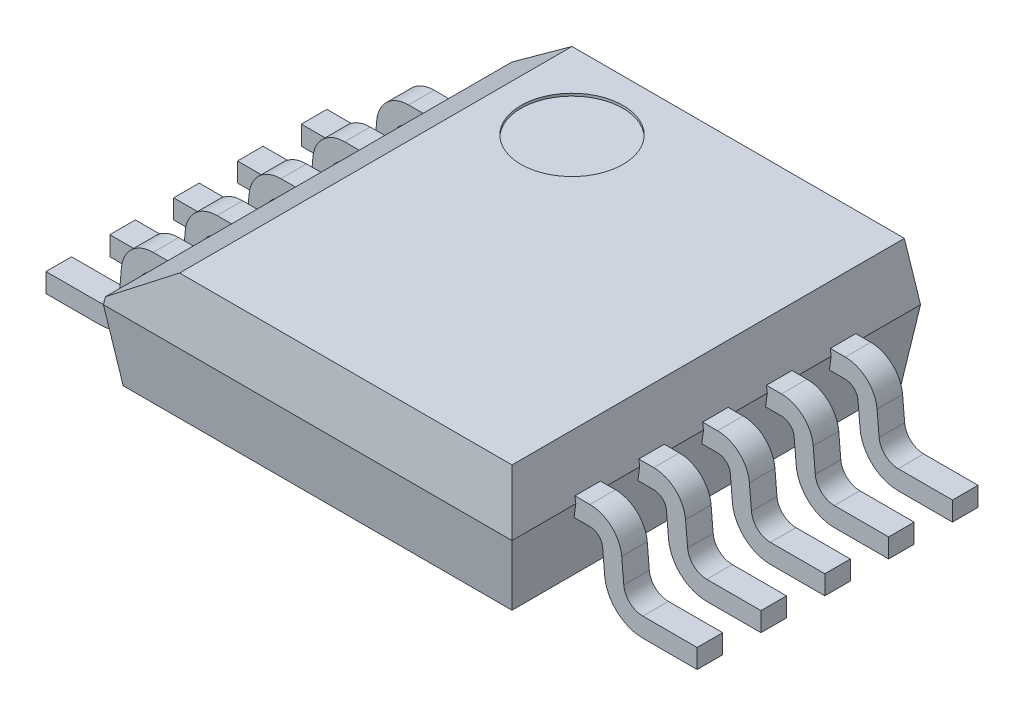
ISO-10303-21;
HEADER;
FILE_DESCRIPTION(('STEP AP214'),'2;1');
FILE_NAME('part.step','',(''),(''),'','','');
FILE_SCHEMA(('AUTOMOTIVE_DESIGN { 1 0 10303 214 1 1 1 1 }'));
ENDSEC;
DATA;
#1=APPLICATION_CONTEXT('core data for automotive mechanical design processes');
#2=APPLICATION_PROTOCOL_DEFINITION('international standard','automotive_design',2000,#1);
#3=PRODUCT_CONTEXT('',#1,'mechanical');
#4=PRODUCT('Part','Part','',(#3));
#5=PRODUCT_RELATED_PRODUCT_CATEGORY('part','',(#4));
#6=PRODUCT_DEFINITION_FORMATION('','',#4);
#7=PRODUCT_DEFINITION_CONTEXT('part definition',#1,'design');
#8=PRODUCT_DEFINITION('design','',#6,#7);
#9=PRODUCT_DEFINITION_SHAPE('','',#8);
#10=(LENGTH_UNIT() NAMED_UNIT(*) SI_UNIT(.MILLI.,.METRE.));
#11=(NAMED_UNIT(*) PLANE_ANGLE_UNIT() SI_UNIT($,.RADIAN.));
#12=(NAMED_UNIT(*) SI_UNIT($,.STERADIAN.) SOLID_ANGLE_UNIT());
#13=UNCERTAINTY_MEASURE_WITH_UNIT(LENGTH_MEASURE(1.E-05),#10,'distance_accuracy_value','');
#14=(GEOMETRIC_REPRESENTATION_CONTEXT(3) GLOBAL_UNCERTAINTY_ASSIGNED_CONTEXT((#13)) GLOBAL_UNIT_ASSIGNED_CONTEXT((#10,
#11,#12)) REPRESENTATION_CONTEXT('',''));
#15=CARTESIAN_POINT('',(0.,0.,0.));
#16=DIRECTION('',(0.,0.,1.));
#17=DIRECTION('',(1.,0.,0.));
#18=AXIS2_PLACEMENT_3D('',#15,#16,#17);
#19=CARTESIAN_POINT('',(-1.710248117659,0.55,-0.9));
#20=DIRECTION('',(0.,-1.,0.));
#21=DIRECTION('',(1.,0.,0.));
#22=AXIS2_PLACEMENT_3D('',#19,#20,#21);
#23=PLANE('',#22);
#24=DIRECTION('',(0.,0.,-1.));
#25=VECTOR('',#24,1.);
#26=CARTESIAN_POINT('',(-1.58594591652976,0.55,-0.9));
#27=LINE('',#26,#25);
#28=CARTESIAN_POINT('',(-1.58594591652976,0.55,-0.9));
#29=VERTEX_POINT('',#28);
#30=CARTESIAN_POINT('',(-1.58594591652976,0.55,-1.1));
#31=VERTEX_POINT('',#30);
#32=EDGE_CURVE('E2124',#29,#31,#27,.T.);
#33=ORIENTED_EDGE('',*,*,#32,.F.);
#34=DIRECTION('',(-1.,0.,0.));
#35=VECTOR('',#34,1.);
#36=CARTESIAN_POINT('',(-1.710248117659,0.55,-0.9));
#37=LINE('',#36,#35);
#38=CARTESIAN_POINT('',(-1.710248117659,0.55,-0.9));
#39=VERTEX_POINT('',#38);
#40=EDGE_CURVE('E2172',#29,#39,#37,.T.);
#41=ORIENTED_EDGE('',*,*,#40,.T.);
#42=DIRECTION('',(0.,0.,-1.));
#43=VECTOR('',#42,1.);
#44=CARTESIAN_POINT('',(-1.710248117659,0.55,-0.9));
#45=LINE('',#44,#43);
#46=CARTESIAN_POINT('',(-1.710248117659,0.55,-1.1));
#47=VERTEX_POINT('',#46);
#48=EDGE_CURVE('E2345',#39,#47,#45,.T.);
#49=ORIENTED_EDGE('',*,*,#48,.T.);
#50=DIRECTION('',(-1.,0.,0.));
#51=VECTOR('',#50,1.);
#52=CARTESIAN_POINT('',(-1.710248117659,0.55,-1.1));
#53=LINE('',#52,#51);
#54=EDGE_CURVE('E2247',#31,#47,#53,.T.);
#55=ORIENTED_EDGE('',*,*,#54,.F.);
#56=EDGE_LOOP('',(#33,#41,#49,#55));
#57=FACE_BOUND('',#56,.T.);
#58=ADVANCED_FACE('F41',(#57),#23,.T.);
#59=CARTESIAN_POINT('',(-1.710248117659,0.7,-0.9));
#60=DIRECTION('',(0.,-1.,0.));
#61=DIRECTION('',(1.,0.,0.));
#62=AXIS2_PLACEMENT_3D('',#59,#60,#61);
#63=PLANE('',#62);
#64=DIRECTION('',(0.,0.,-1.));
#65=VECTOR('',#64,1.);
#66=CARTESIAN_POINT('',(-1.59297295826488,0.7,-0.9));
#67=LINE('',#66,#65);
#68=CARTESIAN_POINT('',(-1.59297295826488,0.7,-1.1));
#69=VERTEX_POINT('',#68);
#70=CARTESIAN_POINT('',(-1.59297295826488,0.7,-0.9));
#71=VERTEX_POINT('',#70);
#72=EDGE_CURVE('E2139',#69,#71,#67,.F.);
#73=ORIENTED_EDGE('',*,*,#72,.F.);
#74=DIRECTION('',(-1.,0.,0.));
#75=VECTOR('',#74,1.);
#76=CARTESIAN_POINT('',(-1.710248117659,0.7,-1.1));
#77=LINE('',#76,#75);
#78=CARTESIAN_POINT('',(-1.710248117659,0.7,-1.1));
#79=VERTEX_POINT('',#78);
#80=EDGE_CURVE('E2283',#69,#79,#77,.T.);
#81=ORIENTED_EDGE('',*,*,#80,.T.);
#82=DIRECTION('',(0.,0.,-1.));
#83=VECTOR('',#82,1.);
#84=CARTESIAN_POINT('',(-1.710248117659,0.7,-0.9));
#85=LINE('',#84,#83);
#86=CARTESIAN_POINT('',(-1.710248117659,0.7,-0.9));
#87=VERTEX_POINT('',#86);
#88=EDGE_CURVE('E2307',#87,#79,#85,.T.);
#89=ORIENTED_EDGE('',*,*,#88,.F.);
#90=DIRECTION('',(-1.,0.,0.));
#91=VECTOR('',#90,1.);
#92=CARTESIAN_POINT('',(-1.710248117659,0.7,-0.9));
#93=LINE('',#92,#91);
#94=EDGE_CURVE('E2209',#71,#87,#93,.T.);
#95=ORIENTED_EDGE('',*,*,#94,.F.);
#96=EDGE_LOOP('',(#73,#81,#89,#95));
#97=FACE_BOUND('',#96,.T.);
#98=ADVANCED_FACE('F2753',(#97),#63,.F.);
#99=CARTESIAN_POINT('',(-2.12489935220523,0.3,-0.9));
#100=DIRECTION('',(0.,0.,-1.));
#101=DIRECTION('',(-1.,0.,0.));
#102=AXIS2_PLACEMENT_3D('',#99,#100,#101);
#103=PLANE('',#102);
#104=DIRECTION('',(0.139173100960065,0.99026806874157,0.));
#105=VECTOR('',#104,1.);
#106=CARTESIAN_POINT('',(-1.65840339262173,0.234438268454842,-0.9));
#107=LINE('',#106,#105);
#108=CARTESIAN_POINT('',(-1.6,0.65,-0.9));
#109=VERTEX_POINT('',#108);
#110=EDGE_CURVE('E2143',#71,#109,#107,.F.);
#111=ORIENTED_EDGE('',*,*,#110,.F.);
#112=ORIENTED_EDGE('',*,*,#94,.T.);
#113=CARTESIAN_POINT('',(-1.710248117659,0.45,-0.9));
#114=DIRECTION('',(0.,0.,1.));
#115=DIRECTION('',(1.,0.,0.));
#116=AXIS2_PLACEMENT_3D('',#113,#114,#115);
#117=CIRCLE('',#116,0.25);
#118=CARTESIAN_POINT('',(-1.95929679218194,0.471788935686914,-0.9));
#119=VERTEX_POINT('',#118);
#120=EDGE_CURVE('E2214',#87,#119,#117,.T.);
#121=ORIENTED_EDGE('',*,*,#120,.T.);
#122=DIRECTION('',(-0.0871557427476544,-0.996194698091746,0.));
#123=VECTOR('',#122,1.);
#124=CARTESIAN_POINT('',(-1.97547014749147,0.286926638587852,-0.9));
#125=LINE('',#124,#123);
#126=CARTESIAN_POINT('',(-1.97547014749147,0.286926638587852,-0.9));
#127=VERTEX_POINT('',#126);
#128=EDGE_CURVE('E2217',#119,#127,#125,.T.);
#129=ORIENTED_EDGE('',*,*,#128,.T.);
#130=CARTESIAN_POINT('',(-2.12489935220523,0.3,-0.9));
#131=DIRECTION('',(0.,0.,1.));
#132=DIRECTION('',(1.,0.,0.));
#133=AXIS2_PLACEMENT_3D('',#130,#131,#132);
#134=CIRCLE('',#133,0.15);
#135=CARTESIAN_POINT('',(-2.12489935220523,0.15,-0.9));
#136=VERTEX_POINT('',#135);
#137=EDGE_CURVE('E2220',#127,#136,#134,.F.);
#138=ORIENTED_EDGE('',*,*,#137,.T.);
#139=DIRECTION('',(1.,0.,0.));
#140=VECTOR('',#139,1.);
#141=CARTESIAN_POINT('',(-2.55,0.15,-0.9));
#142=LINE('',#141,#140);
#143=CARTESIAN_POINT('',(-2.55,0.15,-0.9));
#144=VERTEX_POINT('',#143);
#145=EDGE_CURVE('E2148',#136,#144,#142,.F.);
#146=ORIENTED_EDGE('',*,*,#145,.T.);
#147=DIRECTION('',(0.,1.,0.));
#148=VECTOR('',#147,1.);
#149=CARTESIAN_POINT('',(-2.55,0.,-0.9));
#150=LINE('',#149,#148);
#151=CARTESIAN_POINT('',(-2.55,0.,-0.9));
#152=VERTEX_POINT('',#151);
#153=EDGE_CURVE('E2151',#152,#144,#150,.T.);
#154=ORIENTED_EDGE('',*,*,#153,.F.);
#155=DIRECTION('',(-1.,0.,0.));
#156=VECTOR('',#155,1.);
#157=CARTESIAN_POINT('',(-2.55,0.,-0.9));
#158=LINE('',#157,#156);
#159=CARTESIAN_POINT('',(-2.12489935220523,0.,-0.9));
#160=VERTEX_POINT('',#159);
#161=EDGE_CURVE('E2156',#160,#152,#158,.T.);
#162=ORIENTED_EDGE('',*,*,#161,.F.);
#163=CARTESIAN_POINT('',(-2.12489935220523,0.3,-0.9));
#164=DIRECTION('',(0.,0.,-1.));
#165=DIRECTION('',(1.,0.,0.));
#166=AXIS2_PLACEMENT_3D('',#163,#164,#165);
#167=CIRCLE('',#166,0.3);
#168=CARTESIAN_POINT('',(-1.8260409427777,0.273853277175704,-0.9));
#169=VERTEX_POINT('',#168);
#170=EDGE_CURVE('E2160',#169,#160,#167,.T.);
#171=ORIENTED_EDGE('',*,*,#170,.F.);
#172=DIRECTION('',(-0.0871557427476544,-0.996194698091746,0.));
#173=VECTOR('',#172,1.);
#174=CARTESIAN_POINT('',(-1.8260409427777,0.273853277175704,-0.9));
#175=LINE('',#174,#173);
#176=CARTESIAN_POINT('',(-1.80986758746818,0.458715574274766,-0.9));
#177=VERTEX_POINT('',#176);
#178=EDGE_CURVE('E2164',#177,#169,#175,.T.);
#179=ORIENTED_EDGE('',*,*,#178,.F.);
#180=CARTESIAN_POINT('',(-1.710248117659,0.45,-0.9));
#181=DIRECTION('',(0.,0.,1.));
#182=DIRECTION('',(-1.,0.,0.));
#183=AXIS2_PLACEMENT_3D('',#180,#181,#182);
#184=CIRCLE('',#183,0.1);
#185=EDGE_CURVE('E2168',#39,#177,#184,.T.);
#186=ORIENTED_EDGE('',*,*,#185,.F.);
#187=ORIENTED_EDGE('',*,*,#40,.F.);
#188=DIRECTION('',(-0.139173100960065,0.99026806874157,0.));
#189=VECTOR('',#188,1.);
#190=CARTESIAN_POINT('',(-1.56193031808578,0.379120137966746,-0.9));
#191=LINE('',#190,#189);
#192=EDGE_CURVE('E2128',#29,#109,#191,.T.);
#193=ORIENTED_EDGE('',*,*,#192,.T.);
#194=EDGE_LOOP('',(#111,#112,#121,#129,#138,#146,#154,#162,#171,#179,#186,#187,#193));
#195=FACE_BOUND('',#194,.T.);
#196=ADVANCED_FACE('F2760',(#195),#103,.F.);
#197=CARTESIAN_POINT('',(-2.12489935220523,0.3,-1.1));
#198=DIRECTION('',(0.,0.,-1.));
#199=DIRECTION('',(-1.,0.,0.));
#200=AXIS2_PLACEMENT_3D('',#197,#198,#199);
#201=PLANE('',#200);
#202=ORIENTED_EDGE('',*,*,#80,.F.);
#203=DIRECTION('',(0.139173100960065,0.99026806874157,0.));
#204=VECTOR('',#203,1.);
#205=CARTESIAN_POINT('',(-1.65840339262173,0.234438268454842,-1.1));
#206=LINE('',#205,#204);
#207=CARTESIAN_POINT('',(-1.6,0.65,-1.1));
#208=VERTEX_POINT('',#207);
#209=EDGE_CURVE('E2375',#69,#208,#206,.F.);
#210=ORIENTED_EDGE('',*,*,#209,.T.);
#211=DIRECTION('',(-0.139173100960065,0.99026806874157,0.));
#212=VECTOR('',#211,1.);
#213=CARTESIAN_POINT('',(-1.56193031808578,0.379120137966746,-1.1));
#214=LINE('',#213,#212);
#215=EDGE_CURVE('E2371',#31,#208,#214,.T.);
#216=ORIENTED_EDGE('',*,*,#215,.F.);
#217=ORIENTED_EDGE('',*,*,#54,.T.);
#218=CARTESIAN_POINT('',(-1.710248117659,0.45,-1.1));
#219=DIRECTION('',(0.,0.,1.));
#220=DIRECTION('',(-1.,0.,0.));
#221=AXIS2_PLACEMENT_3D('',#218,#219,#220);
#222=CIRCLE('',#221,0.1);
#223=CARTESIAN_POINT('',(-1.80986758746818,0.458715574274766,-1.1));
#224=VERTEX_POINT('',#223);
#225=EDGE_CURVE('E2243',#47,#224,#222,.T.);
#226=ORIENTED_EDGE('',*,*,#225,.T.);
#227=DIRECTION('',(-0.0871557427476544,-0.996194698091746,0.));
#228=VECTOR('',#227,1.);
#229=CARTESIAN_POINT('',(-1.8260409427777,0.273853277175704,-1.1));
#230=LINE('',#229,#228);
#231=CARTESIAN_POINT('',(-1.8260409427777,0.273853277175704,-1.1));
#232=VERTEX_POINT('',#231);
#233=EDGE_CURVE('E2239',#224,#232,#230,.T.);
#234=ORIENTED_EDGE('',*,*,#233,.T.);
#235=CARTESIAN_POINT('',(-2.12489935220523,0.3,-1.1));
#236=DIRECTION('',(0.,0.,-1.));
#237=DIRECTION('',(1.,0.,0.));
#238=AXIS2_PLACEMENT_3D('',#235,#236,#237);
#239=CIRCLE('',#238,0.3);
#240=CARTESIAN_POINT('',(-2.12489935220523,0.,-1.1));
#241=VERTEX_POINT('',#240);
#242=EDGE_CURVE('E2235',#232,#241,#239,.T.);
#243=ORIENTED_EDGE('',*,*,#242,.T.);
#244=DIRECTION('',(-1.,0.,0.));
#245=VECTOR('',#244,1.);
#246=CARTESIAN_POINT('',(-2.55,0.,-1.1));
#247=LINE('',#246,#245);
#248=CARTESIAN_POINT('',(-2.55,0.,-1.1));
#249=VERTEX_POINT('',#248);
#250=EDGE_CURVE('E2231',#241,#249,#247,.T.);
#251=ORIENTED_EDGE('',*,*,#250,.T.);
#252=DIRECTION('',(0.,1.,0.));
#253=VECTOR('',#252,1.);
#254=CARTESIAN_POINT('',(-2.55,0.,-1.1));
#255=LINE('',#254,#253);
#256=CARTESIAN_POINT('',(-2.55,0.15,-1.1));
#257=VERTEX_POINT('',#256);
#258=EDGE_CURVE('E2227',#249,#257,#255,.T.);
#259=ORIENTED_EDGE('',*,*,#258,.T.);
#260=DIRECTION('',(1.,0.,0.));
#261=VECTOR('',#260,1.);
#262=CARTESIAN_POINT('',(-2.55,0.15,-1.1));
#263=LINE('',#262,#261);
#264=CARTESIAN_POINT('',(-2.12489935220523,0.15,-1.1));
#265=VERTEX_POINT('',#264);
#266=EDGE_CURVE('E2147',#265,#257,#263,.F.);
#267=ORIENTED_EDGE('',*,*,#266,.F.);
#268=CARTESIAN_POINT('',(-2.12489935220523,0.3,-1.1));
#269=DIRECTION('',(0.,0.,1.));
#270=DIRECTION('',(1.,0.,0.));
#271=AXIS2_PLACEMENT_3D('',#268,#269,#270);
#272=CIRCLE('',#271,0.15);
#273=CARTESIAN_POINT('',(-1.97547014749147,0.286926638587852,-1.1));
#274=VERTEX_POINT('',#273);
#275=EDGE_CURVE('E2152',#274,#265,#272,.F.);
#276=ORIENTED_EDGE('',*,*,#275,.F.);
#277=DIRECTION('',(-0.0871557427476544,-0.996194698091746,0.));
#278=VECTOR('',#277,1.);
#279=CARTESIAN_POINT('',(-1.97547014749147,0.286926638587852,-1.1));
#280=LINE('',#279,#278);
#281=CARTESIAN_POINT('',(-1.95929679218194,0.471788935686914,-1.1));
#282=VERTEX_POINT('',#281);
#283=EDGE_CURVE('E2291',#282,#274,#280,.T.);
#284=ORIENTED_EDGE('',*,*,#283,.F.);
#285=CARTESIAN_POINT('',(-1.710248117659,0.45,-1.1));
#286=DIRECTION('',(0.,0.,1.));
#287=DIRECTION('',(1.,0.,0.));
#288=AXIS2_PLACEMENT_3D('',#285,#286,#287);
#289=CIRCLE('',#288,0.25);
#290=EDGE_CURVE('E2288',#79,#282,#289,.T.);
#291=ORIENTED_EDGE('',*,*,#290,.F.);
#292=EDGE_LOOP('',(#202,#210,#216,#217,#226,#234,#243,#251,#259,#267,#276,#284,#291));
#293=FACE_BOUND('',#292,.T.);
#294=ADVANCED_FACE('F2730',(#293),#201,.T.);
#295=CARTESIAN_POINT('',(-2.55,0.15,-0.9));
#296=DIRECTION('',(0.,-1.,0.));
#297=DIRECTION('',(0.,0.,-1.));
#298=AXIS2_PLACEMENT_3D('',#295,#296,#297);
#299=PLANE('',#298);
#300=ORIENTED_EDGE('',*,*,#266,.T.);
#301=DIRECTION('',(0.,0.,-1.));
#302=VECTOR('',#301,1.);
#303=CARTESIAN_POINT('',(-2.55,0.15,-0.9));
#304=LINE('',#303,#302);
#305=EDGE_CURVE('E2361',#144,#257,#304,.T.);
#306=ORIENTED_EDGE('',*,*,#305,.F.);
#307=ORIENTED_EDGE('',*,*,#145,.F.);
#308=DIRECTION('',(0.,0.,-1.));
#309=VECTOR('',#308,1.);
#310=CARTESIAN_POINT('',(-2.12489935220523,0.15,-0.9));
#311=LINE('',#310,#309);
#312=EDGE_CURVE('E2223',#136,#265,#311,.T.);
#313=ORIENTED_EDGE('',*,*,#312,.T.);
#314=EDGE_LOOP('',(#300,#306,#307,#313));
#315=FACE_BOUND('',#314,.T.);
#316=ADVANCED_FACE('F2999',(#315),#299,.F.);
#317=CARTESIAN_POINT('',(-2.55,0.,-0.9));
#318=DIRECTION('',(-1.,0.,0.));
#319=DIRECTION('',(0.,0.,1.));
#320=AXIS2_PLACEMENT_3D('',#317,#318,#319);
#321=PLANE('',#320);
#322=ORIENTED_EDGE('',*,*,#258,.F.);
#323=DIRECTION('',(0.,0.,-1.));
#324=VECTOR('',#323,1.);
#325=CARTESIAN_POINT('',(-2.55,0.,-0.9));
#326=LINE('',#325,#324);
#327=EDGE_CURVE('E2358',#152,#249,#326,.T.);
#328=ORIENTED_EDGE('',*,*,#327,.F.);
#329=ORIENTED_EDGE('',*,*,#153,.T.);
#330=ORIENTED_EDGE('',*,*,#305,.T.);
#331=EDGE_LOOP('',(#322,#328,#329,#330));
#332=FACE_BOUND('',#331,.T.);
#333=ADVANCED_FACE('F4404',(#332),#321,.T.);
#334=CARTESIAN_POINT('',(-2.55,0.,-0.9));
#335=DIRECTION('',(0.,-1.,0.));
#336=DIRECTION('',(0.,0.,-1.));
#337=AXIS2_PLACEMENT_3D('',#334,#335,#336);
#338=PLANE('',#337);
#339=ORIENTED_EDGE('',*,*,#250,.F.);
#340=DIRECTION('',(0.,0.,-1.));
#341=VECTOR('',#340,1.);
#342=CARTESIAN_POINT('',(-2.12489935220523,0.,-0.9));
#343=LINE('',#342,#341);
#344=EDGE_CURVE('E2355',#160,#241,#343,.T.);
#345=ORIENTED_EDGE('',*,*,#344,.F.);
#346=ORIENTED_EDGE('',*,*,#161,.T.);
#347=ORIENTED_EDGE('',*,*,#327,.T.);
#348=EDGE_LOOP('',(#339,#345,#346,#347));
#349=FACE_BOUND('',#348,.T.);
#350=ADVANCED_FACE('F4394',(#349),#338,.T.);
#351=CARTESIAN_POINT('',(-2.12489935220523,0.3,-0.9));
#352=DIRECTION('',(0.,0.,-1.));
#353=DIRECTION('',(-1.,0.,0.));
#354=AXIS2_PLACEMENT_3D('',#351,#352,#353);
#355=CYLINDRICAL_SURFACE('',#354,0.3);
#356=ORIENTED_EDGE('',*,*,#242,.F.);
#357=DIRECTION('',(0.,0.,-1.));
#358=VECTOR('',#357,1.);
#359=CARTESIAN_POINT('',(-1.8260409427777,0.273853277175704,-0.9));
#360=LINE('',#359,#358);
#361=EDGE_CURVE('E2352',#169,#232,#360,.T.);
#362=ORIENTED_EDGE('',*,*,#361,.F.);
#363=ORIENTED_EDGE('',*,*,#170,.T.);
#364=ORIENTED_EDGE('',*,*,#344,.T.);
#365=EDGE_LOOP('',(#356,#362,#363,#364));
#366=FACE_BOUND('',#365,.T.);
#367=ADVANCED_FACE('F4384',(#366),#355,.T.);
#368=CARTESIAN_POINT('',(-1.8260409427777,0.273853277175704,-0.9));
#369=DIRECTION('',(0.996194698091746,-0.0871557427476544,0.));
#370=DIRECTION('',(0.0871557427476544,0.996194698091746,0.));
#371=AXIS2_PLACEMENT_3D('',#368,#369,#370);
#372=PLANE('',#371);
#373=ORIENTED_EDGE('',*,*,#233,.F.);
#374=DIRECTION('',(0.,0.,-1.));
#375=VECTOR('',#374,1.);
#376=CARTESIAN_POINT('',(-1.80986758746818,0.458715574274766,-0.9));
#377=LINE('',#376,#375);
#378=EDGE_CURVE('E2349',#177,#224,#377,.T.);
#379=ORIENTED_EDGE('',*,*,#378,.F.);
#380=ORIENTED_EDGE('',*,*,#178,.T.);
#381=ORIENTED_EDGE('',*,*,#361,.T.);
#382=EDGE_LOOP('',(#373,#379,#380,#381));
#383=FACE_BOUND('',#382,.T.);
#384=ADVANCED_FACE('F4375',(#383),#372,.T.);
#385=CARTESIAN_POINT('',(-1.710248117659,0.45,-0.9));
#386=DIRECTION('',(0.,0.,-1.));
#387=DIRECTION('',(-1.,0.,0.));
#388=AXIS2_PLACEMENT_3D('',#385,#386,#387);
#389=CYLINDRICAL_SURFACE('',#388,0.1);
#390=ORIENTED_EDGE('',*,*,#225,.F.);
#391=ORIENTED_EDGE('',*,*,#48,.F.);
#392=ORIENTED_EDGE('',*,*,#185,.T.);
#393=ORIENTED_EDGE('',*,*,#378,.T.);
#394=EDGE_LOOP('',(#390,#391,#392,#393));
#395=FACE_BOUND('',#394,.T.);
#396=ADVANCED_FACE('F3009',(#395),#389,.F.);
#397=CARTESIAN_POINT('',(-1.710248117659,0.45,-0.9));
#398=DIRECTION('',(0.,0.,-1.));
#399=DIRECTION('',(-1.,0.,0.));
#400=AXIS2_PLACEMENT_3D('',#397,#398,#399);
#401=CYLINDRICAL_SURFACE('',#400,0.25);
#402=ORIENTED_EDGE('',*,*,#290,.T.);
#403=DIRECTION('',(0.,0.,-1.));
#404=VECTOR('',#403,1.);
#405=CARTESIAN_POINT('',(-1.95929679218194,0.471788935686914,-0.9));
#406=LINE('',#405,#404);
#407=EDGE_CURVE('E2303',#119,#282,#406,.T.);
#408=ORIENTED_EDGE('',*,*,#407,.F.);
#409=ORIENTED_EDGE('',*,*,#120,.F.);
#410=ORIENTED_EDGE('',*,*,#88,.T.);
#411=EDGE_LOOP('',(#402,#408,#409,#410));
#412=FACE_BOUND('',#411,.T.);
#413=ADVANCED_FACE('F3006',(#412),#401,.T.);
#414=CARTESIAN_POINT('',(-1.97547014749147,0.286926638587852,-0.9));
#415=DIRECTION('',(0.996194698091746,-0.0871557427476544,0.));
#416=DIRECTION('',(0.0871557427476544,0.996194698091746,0.));
#417=AXIS2_PLACEMENT_3D('',#414,#415,#416);
#418=PLANE('',#417);
#419=ORIENTED_EDGE('',*,*,#283,.T.);
#420=DIRECTION('',(0.,0.,-1.));
#421=VECTOR('',#420,1.);
#422=CARTESIAN_POINT('',(-1.97547014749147,0.286926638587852,-0.9));
#423=LINE('',#422,#421);
#424=EDGE_CURVE('E2299',#127,#274,#423,.T.);
#425=ORIENTED_EDGE('',*,*,#424,.F.);
#426=ORIENTED_EDGE('',*,*,#128,.F.);
#427=ORIENTED_EDGE('',*,*,#407,.T.);
#428=EDGE_LOOP('',(#419,#425,#426,#427));
#429=FACE_BOUND('',#428,.T.);
#430=ADVANCED_FACE('F3002',(#429),#418,.F.);
#431=CARTESIAN_POINT('',(-2.12489935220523,0.3,-0.9));
#432=DIRECTION('',(0.,0.,-1.));
#433=DIRECTION('',(-1.,0.,0.));
#434=AXIS2_PLACEMENT_3D('',#431,#432,#433);
#435=CYLINDRICAL_SURFACE('',#434,0.15);
#436=ORIENTED_EDGE('',*,*,#275,.T.);
#437=ORIENTED_EDGE('',*,*,#312,.F.);
#438=ORIENTED_EDGE('',*,*,#137,.F.);
#439=ORIENTED_EDGE('',*,*,#424,.T.);
#440=EDGE_LOOP('',(#436,#437,#438,#439));
#441=FACE_BOUND('',#440,.T.);
#442=ADVANCED_FACE('F2990',(#441),#435,.F.);
#443=CARTESIAN_POINT('',(-1.6,0.65,1.6));
#444=DIRECTION('',(-0.99026806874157,0.139173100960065,0.));
#445=DIRECTION('',(-0.139173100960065,-0.99026806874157,0.));
#446=AXIS2_PLACEMENT_3D('',#443,#444,#445);
#447=PLANE('',#446);
#448=DIRECTION('',(-0.137844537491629,-0.980814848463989,0.137844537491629));
#449=VECTOR('',#448,1.);
#450=CARTESIAN_POINT('',(-1.5391964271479,1.08263990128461,1.5391964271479));
#451=LINE('',#450,#449);
#452=CARTESIAN_POINT('',(-1.59242586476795,0.70389277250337,1.59242586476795));
#453=VERTEX_POINT('',#452);
#454=CARTESIAN_POINT('',(-1.6,0.65,1.6));
#455=VERTEX_POINT('',#454);
#456=EDGE_CURVE('E2090',#453,#455,#451,.T.);
#457=ORIENTED_EDGE('',*,*,#456,.F.);
#458=DIRECTION('',(0.,0.,1.));
#459=VECTOR('',#458,1.);
#460=CARTESIAN_POINT('',(-1.59242586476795,0.70389277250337,-1.53675662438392));
#461=LINE('',#460,#459);
#462=CARTESIAN_POINT('',(-1.59242586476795,0.70389277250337,-1.59242586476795));
#463=VERTEX_POINT('',#462);
#464=EDGE_CURVE('E65',#453,#463,#461,.F.);
#465=ORIENTED_EDGE('',*,*,#464,.T.);
#466=DIRECTION('',(-0.137844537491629,-0.980814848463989,-0.137844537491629));
#467=VECTOR('',#466,1.);
#468=CARTESIAN_POINT('',(-1.5391964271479,1.08263990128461,-1.5391964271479));
#469=LINE('',#468,#467);
#470=CARTESIAN_POINT('',(-1.6,0.65,-1.6));
#471=VERTEX_POINT('',#470);
#472=EDGE_CURVE('E2072',#463,#471,#469,.T.);
#473=ORIENTED_EDGE('',*,*,#472,.T.);
#474=DIRECTION('',(0.,0.,1.));
#475=VECTOR('',#474,1.);
#476=CARTESIAN_POINT('',(-1.6,0.65,1.6));
#477=LINE('',#476,#475);
#478=EDGE_CURVE('E2091',#471,#208,#477,.T.);
#479=ORIENTED_EDGE('',*,*,#478,.T.);
#480=ORIENTED_EDGE('',*,*,#209,.F.);
#481=ORIENTED_EDGE('',*,*,#72,.T.);
#482=ORIENTED_EDGE('',*,*,#110,.T.);
#483=CARTESIAN_POINT('',(-1.6,0.65,-0.6));
#484=VERTEX_POINT('',#483);
#485=EDGE_CURVE('E2095',#109,#484,#477,.T.);
#486=ORIENTED_EDGE('',*,*,#485,.T.);
#487=DIRECTION('',(0.139173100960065,0.99026806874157,0.));
#488=VECTOR('',#487,1.);
#489=CARTESIAN_POINT('',(-1.65840339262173,0.234438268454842,-0.6));
#490=LINE('',#489,#488);
#491=CARTESIAN_POINT('',(-1.59297295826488,0.7,-0.6));
#492=VERTEX_POINT('',#491);
#493=EDGE_CURVE('E1974',#492,#484,#490,.F.);
#494=ORIENTED_EDGE('',*,*,#493,.F.);
#495=DIRECTION('',(0.,0.,-1.));
#496=VECTOR('',#495,1.);
#497=CARTESIAN_POINT('',(-1.59297295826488,0.7,-0.4));
#498=LINE('',#497,#496);
#499=CARTESIAN_POINT('',(-1.59297295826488,0.7,-0.4));
#500=VERTEX_POINT('',#499);
#501=EDGE_CURVE('E1964',#492,#500,#498,.F.);
#502=ORIENTED_EDGE('',*,*,#501,.T.);
#503=DIRECTION('',(0.139173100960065,0.99026806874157,0.));
#504=VECTOR('',#503,1.);
#505=CARTESIAN_POINT('',(-1.65840339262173,0.234438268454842,-0.4));
#506=LINE('',#505,#504);
#507=CARTESIAN_POINT('',(-1.6,0.65,-0.4));
#508=VERTEX_POINT('',#507);
#509=EDGE_CURVE('E1922',#500,#508,#506,.F.);
#510=ORIENTED_EDGE('',*,*,#509,.T.);
#511=CARTESIAN_POINT('',(-1.6,0.65,-0.1));
#512=VERTEX_POINT('',#511);
#513=EDGE_CURVE('E2416',#508,#512,#477,.T.);
#514=ORIENTED_EDGE('',*,*,#513,.T.);
#515=DIRECTION('',(0.139173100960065,0.99026806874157,0.));
#516=VECTOR('',#515,1.);
#517=CARTESIAN_POINT('',(-1.65840339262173,0.234438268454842,-0.1));
#518=LINE('',#517,#516);
#519=CARTESIAN_POINT('',(-1.59297295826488,0.7,-0.1));
#520=VERTEX_POINT('',#519);
#521=EDGE_CURVE('E1839',#520,#512,#518,.F.);
#522=ORIENTED_EDGE('',*,*,#521,.F.);
#523=DIRECTION('',(0.,0.,-1.));
#524=VECTOR('',#523,1.);
#525=CARTESIAN_POINT('',(-1.59297295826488,0.7,0.0999999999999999));
#526=LINE('',#525,#524);
#527=CARTESIAN_POINT('',(-1.59297295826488,0.7,0.0999999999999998));
#528=VERTEX_POINT('',#527);
#529=EDGE_CURVE('E1829',#520,#528,#526,.F.);
#530=ORIENTED_EDGE('',*,*,#529,.T.);
#531=DIRECTION('',(0.139173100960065,0.99026806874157,0.));
#532=VECTOR('',#531,1.);
#533=CARTESIAN_POINT('',(-1.65840339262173,0.234438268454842,0.0999999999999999));
#534=LINE('',#533,#532);
#535=CARTESIAN_POINT('',(-1.6,0.65,0.0999999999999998));
#536=VERTEX_POINT('',#535);
#537=EDGE_CURVE('E1787',#528,#536,#534,.F.);
#538=ORIENTED_EDGE('',*,*,#537,.T.);
#539=CARTESIAN_POINT('',(-1.6,0.65,0.4));
#540=VERTEX_POINT('',#539);
#541=EDGE_CURVE('E2422',#536,#540,#477,.T.);
#542=ORIENTED_EDGE('',*,*,#541,.T.);
#543=DIRECTION('',(0.139173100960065,0.99026806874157,0.));
#544=VECTOR('',#543,1.);
#545=CARTESIAN_POINT('',(-1.65840339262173,0.234438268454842,0.4));
#546=LINE('',#545,#544);
#547=CARTESIAN_POINT('',(-1.59297295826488,0.7,0.4));
#548=VERTEX_POINT('',#547);
#549=EDGE_CURVE('E1704',#548,#540,#546,.F.);
#550=ORIENTED_EDGE('',*,*,#549,.F.);
#551=DIRECTION('',(0.,0.,-1.));
#552=VECTOR('',#551,1.);
#553=CARTESIAN_POINT('',(-1.59297295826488,0.7,0.6));
#554=LINE('',#553,#552);
#555=CARTESIAN_POINT('',(-1.59297295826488,0.7,0.6));
#556=VERTEX_POINT('',#555);
#557=EDGE_CURVE('E1694',#548,#556,#554,.F.);
#558=ORIENTED_EDGE('',*,*,#557,.T.);
#559=DIRECTION('',(0.139173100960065,0.99026806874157,0.));
#560=VECTOR('',#559,1.);
#561=CARTESIAN_POINT('',(-1.65840339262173,0.234438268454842,0.6));
#562=LINE('',#561,#560);
#563=CARTESIAN_POINT('',(-1.6,0.65,0.6));
#564=VERTEX_POINT('',#563);
#565=EDGE_CURVE('E1652',#556,#564,#562,.F.);
#566=ORIENTED_EDGE('',*,*,#565,.T.);
#567=CARTESIAN_POINT('',(-1.6,0.65,0.9));
#568=VERTEX_POINT('',#567);
#569=EDGE_CURVE('E2412',#564,#568,#477,.T.);
#570=ORIENTED_EDGE('',*,*,#569,.T.);
#571=DIRECTION('',(0.139173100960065,0.99026806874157,0.));
#572=VECTOR('',#571,1.);
#573=CARTESIAN_POINT('',(-1.65840339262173,0.234438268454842,0.9));
#574=LINE('',#573,#572);
#575=CARTESIAN_POINT('',(-1.59297295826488,0.7,0.9));
#576=VERTEX_POINT('',#575);
#577=EDGE_CURVE('E1569',#576,#568,#574,.F.);
#578=ORIENTED_EDGE('',*,*,#577,.F.);
#579=DIRECTION('',(0.,0.,-1.));
#580=VECTOR('',#579,1.);
#581=CARTESIAN_POINT('',(-1.59297295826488,0.7,1.1));
#582=LINE('',#581,#580);
#583=CARTESIAN_POINT('',(-1.59297295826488,0.7,1.1));
#584=VERTEX_POINT('',#583);
#585=EDGE_CURVE('E1559',#576,#584,#582,.F.);
#586=ORIENTED_EDGE('',*,*,#585,.T.);
#587=DIRECTION('',(0.139173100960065,0.99026806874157,0.));
#588=VECTOR('',#587,1.);
#589=CARTESIAN_POINT('',(-1.65840339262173,0.234438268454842,1.1));
#590=LINE('',#589,#588);
#591=CARTESIAN_POINT('',(-1.6,0.65,1.1));
#592=VERTEX_POINT('',#591);
#593=EDGE_CURVE('E1517',#584,#592,#590,.F.);
#594=ORIENTED_EDGE('',*,*,#593,.T.);
#595=EDGE_CURVE('E2096',#592,#455,#477,.T.);
#596=ORIENTED_EDGE('',*,*,#595,.T.);
#597=EDGE_LOOP('',(#457,#465,#473,#479,#480,#481,#482,#486,#494,#502,#510,#514,#522,#530,#538,
#542,#550,#558,#566,#570,#578,#586,#594,#596));
#598=FACE_BOUND('',#597,.T.);
#599=ADVANCED_FACE('F2430',(#598),#447,.T.);
#600=CARTESIAN_POINT('',(1.6,0.65,1.6));
#601=DIRECTION('',(0.99026806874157,0.139173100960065,0.));
#602=DIRECTION('',(-0.139173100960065,0.99026806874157,0.));
#603=AXIS2_PLACEMENT_3D('',#600,#601,#602);
#604=PLANE('',#603);
#605=DIRECTION('',(0.,0.,1.));
#606=VECTOR('',#605,1.);
#607=CARTESIAN_POINT('',(1.59297295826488,0.7,1.1));
#608=LINE('',#607,#606);
#609=CARTESIAN_POINT('',(1.59297295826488,0.700000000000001,1.1));
#610=VERTEX_POINT('',#609);
#611=CARTESIAN_POINT('',(1.59297295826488,0.700000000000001,0.9));
#612=VERTEX_POINT('',#611);
#613=EDGE_CURVE('E944',#610,#612,#608,.F.);
#614=ORIENTED_EDGE('',*,*,#613,.T.);
#615=DIRECTION('',(0.139173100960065,-0.99026806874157,0.));
#616=VECTOR('',#615,1.);
#617=CARTESIAN_POINT('',(1.57608839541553,0.820139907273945,0.9));
#618=LINE('',#617,#616);
#619=CARTESIAN_POINT('',(1.6,0.65,0.9));
#620=VERTEX_POINT('',#619);
#621=EDGE_CURVE('E1014',#620,#612,#618,.F.);
#622=ORIENTED_EDGE('',*,*,#621,.F.);
#623=DIRECTION('',(0.,0.,-1.));
#624=VECTOR('',#623,1.);
#625=CARTESIAN_POINT('',(1.6,0.65,1.6));
#626=LINE('',#625,#624);
#627=CARTESIAN_POINT('',(1.6,0.65,0.6));
#628=VERTEX_POINT('',#627);
#629=EDGE_CURVE('E2083',#620,#628,#626,.T.);
#630=ORIENTED_EDGE('',*,*,#629,.T.);
#631=DIRECTION('',(0.139173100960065,-0.99026806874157,0.));
#632=VECTOR('',#631,1.);
#633=CARTESIAN_POINT('',(1.57608839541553,0.820139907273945,0.6));
#634=LINE('',#633,#632);
#635=CARTESIAN_POINT('',(1.59297295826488,0.700000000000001,0.6));
#636=VERTEX_POINT('',#635);
#637=EDGE_CURVE('E1098',#628,#636,#634,.F.);
#638=ORIENTED_EDGE('',*,*,#637,.T.);
#639=DIRECTION('',(0.,0.,1.));
#640=VECTOR('',#639,1.);
#641=CARTESIAN_POINT('',(1.59297295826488,0.7,0.6));
#642=LINE('',#641,#640);
#643=CARTESIAN_POINT('',(1.59297295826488,0.700000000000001,0.4));
#644=VERTEX_POINT('',#643);
#645=EDGE_CURVE('E1084',#636,#644,#642,.F.);
#646=ORIENTED_EDGE('',*,*,#645,.T.);
#647=DIRECTION('',(0.139173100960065,-0.99026806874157,0.));
#648=VECTOR('',#647,1.);
#649=CARTESIAN_POINT('',(1.57608839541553,0.820139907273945,0.4));
#650=LINE('',#649,#648);
#651=CARTESIAN_POINT('',(1.6,0.65,0.4));
#652=VERTEX_POINT('',#651);
#653=EDGE_CURVE('E1154',#652,#644,#650,.F.);
#654=ORIENTED_EDGE('',*,*,#653,.F.);
#655=CARTESIAN_POINT('',(1.6,0.65,0.1));
#656=VERTEX_POINT('',#655);
#657=EDGE_CURVE('E2418',#652,#656,#626,.T.);
#658=ORIENTED_EDGE('',*,*,#657,.T.);
#659=DIRECTION('',(0.139173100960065,-0.99026806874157,0.));
#660=VECTOR('',#659,1.);
#661=CARTESIAN_POINT('',(1.57608839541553,0.820139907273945,0.0999999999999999));
#662=LINE('',#661,#660);
#663=CARTESIAN_POINT('',(1.59297295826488,0.700000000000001,0.0999999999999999));
#664=VERTEX_POINT('',#663);
#665=EDGE_CURVE('E1238',#656,#664,#662,.F.);
#666=ORIENTED_EDGE('',*,*,#665,.T.);
#667=DIRECTION('',(0.,0.,1.));
#668=VECTOR('',#667,1.);
#669=CARTESIAN_POINT('',(1.59297295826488,0.7,0.0999999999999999));
#670=LINE('',#669,#668);
#671=CARTESIAN_POINT('',(1.59297295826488,0.700000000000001,-0.1));
#672=VERTEX_POINT('',#671);
#673=EDGE_CURVE('E1224',#664,#672,#670,.F.);
#674=ORIENTED_EDGE('',*,*,#673,.T.);
#675=DIRECTION('',(0.139173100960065,-0.99026806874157,0.));
#676=VECTOR('',#675,1.);
#677=CARTESIAN_POINT('',(1.57608839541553,0.820139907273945,-0.1));
#678=LINE('',#677,#676);
#679=CARTESIAN_POINT('',(1.6,0.65,-0.1));
#680=VERTEX_POINT('',#679);
#681=EDGE_CURVE('E1294',#680,#672,#678,.F.);
#682=ORIENTED_EDGE('',*,*,#681,.F.);
#683=CARTESIAN_POINT('',(1.6,0.65,-0.4));
#684=VERTEX_POINT('',#683);
#685=EDGE_CURVE('E2419',#680,#684,#626,.T.);
#686=ORIENTED_EDGE('',*,*,#685,.T.);
#687=DIRECTION('',(0.139173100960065,-0.99026806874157,0.));
#688=VECTOR('',#687,1.);
#689=CARTESIAN_POINT('',(1.57608839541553,0.820139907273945,-0.4));
#690=LINE('',#689,#688);
#691=CARTESIAN_POINT('',(1.59297295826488,0.700000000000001,-0.4));
#692=VERTEX_POINT('',#691);
#693=EDGE_CURVE('E1378',#684,#692,#690,.F.);
#694=ORIENTED_EDGE('',*,*,#693,.T.);
#695=DIRECTION('',(0.,0.,1.));
#696=VECTOR('',#695,1.);
#697=CARTESIAN_POINT('',(1.59297295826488,0.7,-0.4));
#698=LINE('',#697,#696);
#699=CARTESIAN_POINT('',(1.59297295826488,0.700000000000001,-0.6));
#700=VERTEX_POINT('',#699);
#701=EDGE_CURVE('E1364',#692,#700,#698,.F.);
#702=ORIENTED_EDGE('',*,*,#701,.T.);
#703=DIRECTION('',(0.139173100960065,-0.99026806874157,0.));
#704=VECTOR('',#703,1.);
#705=CARTESIAN_POINT('',(1.57608839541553,0.820139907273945,-0.6));
#706=LINE('',#705,#704);
#707=CARTESIAN_POINT('',(1.6,0.65,-0.6));
#708=VERTEX_POINT('',#707);
#709=EDGE_CURVE('E1434',#708,#700,#706,.F.);
#710=ORIENTED_EDGE('',*,*,#709,.F.);
#711=CARTESIAN_POINT('',(1.6,0.65,-0.9));
#712=VERTEX_POINT('',#711);
#713=EDGE_CURVE('E2713',#708,#712,#626,.T.);
#714=ORIENTED_EDGE('',*,*,#713,.T.);
#715=DIRECTION('',(0.139173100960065,-0.99026806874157,0.));
#716=VECTOR('',#715,1.);
#717=CARTESIAN_POINT('',(1.57608839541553,0.820139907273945,-0.9));
#718=LINE('',#717,#716);
#719=CARTESIAN_POINT('',(1.59297295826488,0.700000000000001,-0.9));
#720=VERTEX_POINT('',#719);
#721=EDGE_CURVE('E2135',#712,#720,#718,.F.);
#722=ORIENTED_EDGE('',*,*,#721,.T.);
#723=DIRECTION('',(0.,0.,1.));
#724=VECTOR('',#723,1.);
#725=CARTESIAN_POINT('',(1.59297295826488,0.7,-0.9));
#726=LINE('',#725,#724);
#727=CARTESIAN_POINT('',(1.59297295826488,0.700000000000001,-1.1));
#728=VERTEX_POINT('',#727);
#729=EDGE_CURVE('E2131',#720,#728,#726,.F.);
#730=ORIENTED_EDGE('',*,*,#729,.T.);
#731=DIRECTION('',(0.139173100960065,-0.99026806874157,0.));
#732=VECTOR('',#731,1.);
#733=CARTESIAN_POINT('',(1.57608839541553,0.820139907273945,-1.1));
#734=LINE('',#733,#732);
#735=CARTESIAN_POINT('',(1.6,0.65,-1.1));
#736=VERTEX_POINT('',#735);
#737=EDGE_CURVE('E2368',#736,#728,#734,.F.);
#738=ORIENTED_EDGE('',*,*,#737,.F.);
#739=CARTESIAN_POINT('',(1.6,0.65,-1.6));
#740=VERTEX_POINT('',#739);
#741=EDGE_CURVE('E2084',#736,#740,#626,.T.);
#742=ORIENTED_EDGE('',*,*,#741,.T.);
#743=DIRECTION('',(0.137844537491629,-0.980814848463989,-0.137844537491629));
#744=VECTOR('',#743,1.);
#745=CARTESIAN_POINT('',(1.6,0.65,-1.6));
#746=LINE('',#745,#744);
#747=CARTESIAN_POINT('',(1.53675662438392,1.1,-1.53675662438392));
#748=VERTEX_POINT('',#747);
#749=EDGE_CURVE('E2078',#748,#740,#746,.T.);
#750=ORIENTED_EDGE('',*,*,#749,.F.);
#751=DIRECTION('',(0.,0.,1.));
#752=VECTOR('',#751,1.);
#753=CARTESIAN_POINT('',(1.53675662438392,1.1,1.6));
#754=LINE('',#753,#752);
#755=CARTESIAN_POINT('',(1.53675662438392,1.1,1.53675662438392));
#756=VERTEX_POINT('',#755);
#757=EDGE_CURVE('E2097',#756,#748,#754,.F.);
#758=ORIENTED_EDGE('',*,*,#757,.F.);
#759=DIRECTION('',(0.137844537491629,-0.980814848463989,0.137844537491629));
#760=VECTOR('',#759,1.);
#761=CARTESIAN_POINT('',(1.6,0.65,1.6));
#762=LINE('',#761,#760);
#763=CARTESIAN_POINT('',(1.6,0.65,1.6));
#764=VERTEX_POINT('',#763);
#765=EDGE_CURVE('E2089',#756,#764,#762,.T.);
#766=ORIENTED_EDGE('',*,*,#765,.T.);
#767=CARTESIAN_POINT('',(1.6,0.65,1.1));
#768=VERTEX_POINT('',#767);
#769=EDGE_CURVE('E2079',#764,#768,#626,.T.);
#770=ORIENTED_EDGE('',*,*,#769,.T.);
#771=DIRECTION('',(0.139173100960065,-0.99026806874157,0.));
#772=VECTOR('',#771,1.);
#773=CARTESIAN_POINT('',(1.57608839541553,0.820139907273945,1.1));
#774=LINE('',#773,#772);
#775=EDGE_CURVE('E959',#768,#610,#774,.F.);
#776=ORIENTED_EDGE('',*,*,#775,.T.);
#777=EDGE_LOOP('',(#614,#622,#630,#638,#646,#654,#658,#666,#674,#682,#686,#694,#702,#710,#714,
#722,#730,#738,#742,#750,#758,#766,#770,#776));
#778=FACE_BOUND('',#777,.T.);
#779=ADVANCED_FACE('F2616',(#778),#604,.T.);
#780=CARTESIAN_POINT('',(-1.6,0.65,1.6));
#781=DIRECTION('',(-0.99026806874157,-0.139173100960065,0.));
#782=DIRECTION('',(0.139173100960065,-0.99026806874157,0.));
#783=AXIS2_PLACEMENT_3D('',#780,#781,#782);
#784=PLANE('',#783);
#785=DIRECTION('',(-0.139173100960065,0.99026806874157,0.));
#786=VECTOR('',#785,1.);
#787=CARTESIAN_POINT('',(-1.56193031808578,0.379120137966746,0.9));
#788=LINE('',#787,#786);
#789=CARTESIAN_POINT('',(-1.58594591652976,0.55,0.9));
#790=VERTEX_POINT('',#789);
#791=EDGE_CURVE('E1573',#790,#568,#788,.T.);
#792=ORIENTED_EDGE('',*,*,#791,.T.);
#793=ORIENTED_EDGE('',*,*,#569,.F.);
#794=DIRECTION('',(-0.139173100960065,0.99026806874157,0.));
#795=VECTOR('',#794,1.);
#796=CARTESIAN_POINT('',(-1.56193031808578,0.379120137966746,0.6));
#797=LINE('',#796,#795);
#798=CARTESIAN_POINT('',(-1.58594591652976,0.55,0.6));
#799=VERTEX_POINT('',#798);
#800=EDGE_CURVE('E1690',#799,#564,#797,.T.);
#801=ORIENTED_EDGE('',*,*,#800,.F.);
#802=DIRECTION('',(0.,0.,-1.));
#803=VECTOR('',#802,1.);
#804=CARTESIAN_POINT('',(-1.58594591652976,0.55,0.6));
#805=LINE('',#804,#803);
#806=CARTESIAN_POINT('',(-1.58594591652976,0.55,0.4));
#807=VERTEX_POINT('',#806);
#808=EDGE_CURVE('E1639',#799,#807,#805,.T.);
#809=ORIENTED_EDGE('',*,*,#808,.T.);
#810=DIRECTION('',(-0.139173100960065,0.99026806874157,0.));
#811=VECTOR('',#810,1.);
#812=CARTESIAN_POINT('',(-1.56193031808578,0.379120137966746,0.4));
#813=LINE('',#812,#811);
#814=EDGE_CURVE('E1708',#807,#540,#813,.T.);
#815=ORIENTED_EDGE('',*,*,#814,.T.);
#816=ORIENTED_EDGE('',*,*,#541,.F.);
#817=DIRECTION('',(-0.139173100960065,0.99026806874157,0.));
#818=VECTOR('',#817,1.);
#819=CARTESIAN_POINT('',(-1.56193031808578,0.379120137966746,0.0999999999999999));
#820=LINE('',#819,#818);
#821=CARTESIAN_POINT('',(-1.58594591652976,0.55,0.0999999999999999));
#822=VERTEX_POINT('',#821);
#823=EDGE_CURVE('E1825',#822,#536,#820,.T.);
#824=ORIENTED_EDGE('',*,*,#823,.F.);
#825=DIRECTION('',(0.,0.,-1.));
#826=VECTOR('',#825,1.);
#827=CARTESIAN_POINT('',(-1.58594591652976,0.55,0.0999999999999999));
#828=LINE('',#827,#826);
#829=CARTESIAN_POINT('',(-1.58594591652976,0.55,-0.1));
#830=VERTEX_POINT('',#829);
#831=EDGE_CURVE('E1774',#822,#830,#828,.T.);
#832=ORIENTED_EDGE('',*,*,#831,.T.);
#833=DIRECTION('',(-0.139173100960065,0.99026806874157,0.));
#834=VECTOR('',#833,1.);
#835=CARTESIAN_POINT('',(-1.56193031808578,0.379120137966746,-0.1));
#836=LINE('',#835,#834);
#837=EDGE_CURVE('E1843',#830,#512,#836,.T.);
#838=ORIENTED_EDGE('',*,*,#837,.T.);
#839=ORIENTED_EDGE('',*,*,#513,.F.);
#840=DIRECTION('',(-0.139173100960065,0.99026806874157,0.));
#841=VECTOR('',#840,1.);
#842=CARTESIAN_POINT('',(-1.56193031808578,0.379120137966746,-0.4));
#843=LINE('',#842,#841);
#844=CARTESIAN_POINT('',(-1.58594591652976,0.55,-0.4));
#845=VERTEX_POINT('',#844);
#846=EDGE_CURVE('E1960',#845,#508,#843,.T.);
#847=ORIENTED_EDGE('',*,*,#846,.F.);
#848=DIRECTION('',(0.,0.,-1.));
#849=VECTOR('',#848,1.);
#850=CARTESIAN_POINT('',(-1.58594591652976,0.55,-0.4));
#851=LINE('',#850,#849);
#852=CARTESIAN_POINT('',(-1.58594591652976,0.55,-0.6));
#853=VERTEX_POINT('',#852);
#854=EDGE_CURVE('E1909',#845,#853,#851,.T.);
#855=ORIENTED_EDGE('',*,*,#854,.T.);
#856=DIRECTION('',(-0.139173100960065,0.99026806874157,0.));
#857=VECTOR('',#856,1.);
#858=CARTESIAN_POINT('',(-1.56193031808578,0.379120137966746,-0.6));
#859=LINE('',#858,#857);
#860=EDGE_CURVE('E1978',#853,#484,#859,.T.);
#861=ORIENTED_EDGE('',*,*,#860,.T.);
#862=ORIENTED_EDGE('',*,*,#485,.F.);
#863=ORIENTED_EDGE('',*,*,#192,.F.);
#864=ORIENTED_EDGE('',*,*,#32,.T.);
#865=ORIENTED_EDGE('',*,*,#215,.T.);
#866=ORIENTED_EDGE('',*,*,#478,.F.);
#867=DIRECTION('',(-0.137844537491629,0.980814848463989,-0.137844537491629));
#868=VECTOR('',#867,1.);
#869=CARTESIAN_POINT('',(-1.5391964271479,0.217360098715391,-1.5391964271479));
#870=LINE('',#869,#868);
#871=CARTESIAN_POINT('',(-1.52270254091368,0.1,-1.52270254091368));
#872=VERTEX_POINT('',#871);
#873=EDGE_CURVE('E2049',#872,#471,#870,.T.);
#874=ORIENTED_EDGE('',*,*,#873,.F.);
#875=DIRECTION('',(0.,0.,-1.));
#876=VECTOR('',#875,1.);
#877=CARTESIAN_POINT('',(-1.52270254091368,0.1,1.6));
#878=LINE('',#877,#876);
#879=CARTESIAN_POINT('',(-1.52270254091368,0.1,1.52270254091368));
#880=VERTEX_POINT('',#879);
#881=EDGE_CURVE('E2052',#880,#872,#878,.T.);
#882=ORIENTED_EDGE('',*,*,#881,.F.);
#883=DIRECTION('',(-0.137844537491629,0.980814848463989,0.137844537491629));
#884=VECTOR('',#883,1.);
#885=CARTESIAN_POINT('',(-1.6,0.65,1.6));
#886=LINE('',#885,#884);
#887=EDGE_CURVE('E2044',#880,#455,#886,.T.);
#888=ORIENTED_EDGE('',*,*,#887,.T.);
#889=ORIENTED_EDGE('',*,*,#595,.F.);
#890=DIRECTION('',(-0.139173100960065,0.99026806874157,0.));
#891=VECTOR('',#890,1.);
#892=CARTESIAN_POINT('',(-1.56193031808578,0.379120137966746,1.1));
#893=LINE('',#892,#891);
#894=CARTESIAN_POINT('',(-1.58594591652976,0.55,1.1));
#895=VERTEX_POINT('',#894);
#896=EDGE_CURVE('E1555',#895,#592,#893,.T.);
#897=ORIENTED_EDGE('',*,*,#896,.F.);
#898=DIRECTION('',(0.,0.,-1.));
#899=VECTOR('',#898,1.);
#900=CARTESIAN_POINT('',(-1.58594591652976,0.55,1.1));
#901=LINE('',#900,#899);
#902=EDGE_CURVE('E1504',#895,#790,#901,.T.);
#903=ORIENTED_EDGE('',*,*,#902,.T.);
#904=EDGE_LOOP('',(#792,#793,#801,#809,#815,#816,#824,#832,#838,#839,#847,#855,#861,#862,#863,
#864,#865,#866,#874,#882,#888,#889,#897,#903));
#905=FACE_BOUND('',#904,.T.);
#906=ADVANCED_FACE('F2488',(#905),#784,.T.);
#907=CARTESIAN_POINT('',(1.6,0.65,1.6));
#908=DIRECTION('',(0.99026806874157,-0.139173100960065,0.));
#909=DIRECTION('',(0.139173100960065,0.99026806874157,0.));
#910=AXIS2_PLACEMENT_3D('',#907,#908,#909);
#911=PLANE('',#910);
#912=DIRECTION('',(-0.139173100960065,-0.99026806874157,0.));
#913=VECTOR('',#912,1.);
#914=CARTESIAN_POINT('',(1.47961532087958,-0.206581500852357,0.9));
#915=LINE('',#914,#913);
#916=CARTESIAN_POINT('',(1.58594591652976,0.550000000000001,0.9));
#917=VERTEX_POINT('',#916);
#918=EDGE_CURVE('E1010',#620,#917,#915,.T.);
#919=ORIENTED_EDGE('',*,*,#918,.T.);
#920=DIRECTION('',(0.,0.,1.));
#921=VECTOR('',#920,1.);
#922=CARTESIAN_POINT('',(1.58594591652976,0.55,1.1));
#923=LINE('',#922,#921);
#924=CARTESIAN_POINT('',(1.58594591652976,0.550000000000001,1.1));
#925=VERTEX_POINT('',#924);
#926=EDGE_CURVE('E1080',#917,#925,#923,.T.);
#927=ORIENTED_EDGE('',*,*,#926,.T.);
#928=DIRECTION('',(-0.139173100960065,-0.99026806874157,0.));
#929=VECTOR('',#928,1.);
#930=CARTESIAN_POINT('',(1.47961532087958,-0.206581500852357,1.1));
#931=LINE('',#930,#929);
#932=EDGE_CURVE('E963',#768,#925,#931,.T.);
#933=ORIENTED_EDGE('',*,*,#932,.F.);
#934=ORIENTED_EDGE('',*,*,#769,.F.);
#935=DIRECTION('',(0.137844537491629,0.980814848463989,0.137844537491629));
#936=VECTOR('',#935,1.);
#937=CARTESIAN_POINT('',(1.6,0.65,1.6));
#938=LINE('',#937,#936);
#939=CARTESIAN_POINT('',(1.52270254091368,0.1,1.52270254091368));
#940=VERTEX_POINT('',#939);
#941=EDGE_CURVE('E2063',#940,#764,#938,.T.);
#942=ORIENTED_EDGE('',*,*,#941,.F.);
#943=DIRECTION('',(0.,0.,1.));
#944=VECTOR('',#943,1.);
#945=CARTESIAN_POINT('',(1.52270254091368,0.1,1.6));
#946=LINE('',#945,#944);
#947=CARTESIAN_POINT('',(1.52270254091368,0.1,-1.52270254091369));
#948=VERTEX_POINT('',#947);
#949=EDGE_CURVE('E2045',#948,#940,#946,.T.);
#950=ORIENTED_EDGE('',*,*,#949,.F.);
#951=DIRECTION('',(0.137844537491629,0.980814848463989,-0.137844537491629));
#952=VECTOR('',#951,1.);
#953=CARTESIAN_POINT('',(1.5391964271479,0.217360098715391,-1.5391964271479));
#954=LINE('',#953,#952);
#955=EDGE_CURVE('E2059',#948,#740,#954,.T.);
#956=ORIENTED_EDGE('',*,*,#955,.T.);
#957=ORIENTED_EDGE('',*,*,#741,.F.);
#958=DIRECTION('',(-0.139173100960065,-0.99026806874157,0.));
#959=VECTOR('',#958,1.);
#960=CARTESIAN_POINT('',(1.47961532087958,-0.206581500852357,-1.1));
#961=LINE('',#960,#959);
#962=CARTESIAN_POINT('',(1.58594591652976,0.550000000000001,-1.1));
#963=VERTEX_POINT('',#962);
#964=EDGE_CURVE('E2364',#736,#963,#961,.T.);
#965=ORIENTED_EDGE('',*,*,#964,.T.);
#966=DIRECTION('',(0.,0.,1.));
#967=VECTOR('',#966,1.);
#968=CARTESIAN_POINT('',(1.58594591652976,0.55,-0.9));
#969=LINE('',#968,#967);
#970=CARTESIAN_POINT('',(1.58594591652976,0.550000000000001,-0.9));
#971=VERTEX_POINT('',#970);
#972=EDGE_CURVE('E2101',#963,#971,#969,.T.);
#973=ORIENTED_EDGE('',*,*,#972,.T.);
#974=DIRECTION('',(-0.139173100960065,-0.99026806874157,0.));
#975=VECTOR('',#974,1.);
#976=CARTESIAN_POINT('',(1.47961532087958,-0.206581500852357,-0.9));
#977=LINE('',#976,#975);
#978=EDGE_CURVE('E2121',#712,#971,#977,.T.);
#979=ORIENTED_EDGE('',*,*,#978,.F.);
#980=ORIENTED_EDGE('',*,*,#713,.F.);
#981=DIRECTION('',(-0.139173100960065,-0.99026806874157,0.));
#982=VECTOR('',#981,1.);
#983=CARTESIAN_POINT('',(1.47961532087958,-0.206581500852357,-0.6));
#984=LINE('',#983,#982);
#985=CARTESIAN_POINT('',(1.58594591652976,0.550000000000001,-0.6));
#986=VERTEX_POINT('',#985);
#987=EDGE_CURVE('E1430',#708,#986,#984,.T.);
#988=ORIENTED_EDGE('',*,*,#987,.T.);
#989=DIRECTION('',(0.,0.,1.));
#990=VECTOR('',#989,1.);
#991=CARTESIAN_POINT('',(1.58594591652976,0.55,-0.4));
#992=LINE('',#991,#990);
#993=CARTESIAN_POINT('',(1.58594591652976,0.550000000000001,-0.4));
#994=VERTEX_POINT('',#993);
#995=EDGE_CURVE('E1500',#986,#994,#992,.T.);
#996=ORIENTED_EDGE('',*,*,#995,.T.);
#997=DIRECTION('',(-0.139173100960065,-0.99026806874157,0.));
#998=VECTOR('',#997,1.);
#999=CARTESIAN_POINT('',(1.47961532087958,-0.206581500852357,-0.4));
#1000=LINE('',#999,#998);
#1001=EDGE_CURVE('E1382',#684,#994,#1000,.T.);
#1002=ORIENTED_EDGE('',*,*,#1001,.F.);
#1003=ORIENTED_EDGE('',*,*,#685,.F.);
#1004=DIRECTION('',(-0.139173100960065,-0.99026806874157,0.));
#1005=VECTOR('',#1004,1.);
#1006=CARTESIAN_POINT('',(1.47961532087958,-0.206581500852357,-0.1));
#1007=LINE('',#1006,#1005);
#1008=CARTESIAN_POINT('',(1.58594591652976,0.550000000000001,-0.1));
#1009=VERTEX_POINT('',#1008);
#1010=EDGE_CURVE('E1290',#680,#1009,#1007,.T.);
#1011=ORIENTED_EDGE('',*,*,#1010,.T.);
#1012=DIRECTION('',(0.,0.,1.));
#1013=VECTOR('',#1012,1.);
#1014=CARTESIAN_POINT('',(1.58594591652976,0.55,0.0999999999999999));
#1015=LINE('',#1014,#1013);
#1016=CARTESIAN_POINT('',(1.58594591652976,0.550000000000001,0.0999999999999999));
#1017=VERTEX_POINT('',#1016);
#1018=EDGE_CURVE('E1360',#1009,#1017,#1015,.T.);
#1019=ORIENTED_EDGE('',*,*,#1018,.T.);
#1020=DIRECTION('',(-0.139173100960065,-0.99026806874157,0.));
#1021=VECTOR('',#1020,1.);
#1022=CARTESIAN_POINT('',(1.47961532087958,-0.206581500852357,0.0999999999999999));
#1023=LINE('',#1022,#1021);
#1024=EDGE_CURVE('E1242',#656,#1017,#1023,.T.);
#1025=ORIENTED_EDGE('',*,*,#1024,.F.);
#1026=ORIENTED_EDGE('',*,*,#657,.F.);
#1027=DIRECTION('',(-0.139173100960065,-0.99026806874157,0.));
#1028=VECTOR('',#1027,1.);
#1029=CARTESIAN_POINT('',(1.47961532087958,-0.206581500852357,0.4));
#1030=LINE('',#1029,#1028);
#1031=CARTESIAN_POINT('',(1.58594591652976,0.550000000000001,0.4));
#1032=VERTEX_POINT('',#1031);
#1033=EDGE_CURVE('E1150',#652,#1032,#1030,.T.);
#1034=ORIENTED_EDGE('',*,*,#1033,.T.);
#1035=DIRECTION('',(0.,0.,1.));
#1036=VECTOR('',#1035,1.);
#1037=CARTESIAN_POINT('',(1.58594591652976,0.55,0.6));
#1038=LINE('',#1037,#1036);
#1039=CARTESIAN_POINT('',(1.58594591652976,0.550000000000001,0.6));
#1040=VERTEX_POINT('',#1039);
#1041=EDGE_CURVE('E1220',#1032,#1040,#1038,.T.);
#1042=ORIENTED_EDGE('',*,*,#1041,.T.);
#1043=DIRECTION('',(-0.139173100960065,-0.99026806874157,0.));
#1044=VECTOR('',#1043,1.);
#1045=CARTESIAN_POINT('',(1.47961532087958,-0.206581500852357,0.6));
#1046=LINE('',#1045,#1044);
#1047=EDGE_CURVE('E1102',#628,#1040,#1046,.T.);
#1048=ORIENTED_EDGE('',*,*,#1047,.F.);
#1049=ORIENTED_EDGE('',*,*,#629,.F.);
#1050=EDGE_LOOP('',(#919,#927,#933,#934,#942,#950,#956,#957,#965,#973,#979,#980,#988,#996,#1002,
#1003,#1011,#1019,#1025,#1026,#1034,#1042,#1048,#1049));
#1051=FACE_BOUND('',#1050,.T.);
#1052=ADVANCED_FACE('F2624',(#1051),#911,.T.);
#1053=CARTESIAN_POINT('',(1.6,0.65,1.6));
#1054=DIRECTION('',(0.,0.139173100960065,0.99026806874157));
#1055=DIRECTION('',(0.,-0.99026806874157,0.139173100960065));
#1056=AXIS2_PLACEMENT_3D('',#1053,#1054,#1055);
#1057=PLANE('',#1056);
#1058=DIRECTION('',(-1.,0.,0.));
#1059=VECTOR('',#1058,1.);
#1060=CARTESIAN_POINT('',(1.6,1.1,1.53675662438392));
#1061=LINE('',#1060,#1059);
#1062=CARTESIAN_POINT('',(-1.06677381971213,1.1,1.53675662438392));
#1063=VERTEX_POINT('',#1062);
#1064=EDGE_CURVE('E2102',#1063,#756,#1061,.F.);
#1065=ORIENTED_EDGE('',*,*,#1064,.F.);
#1066=DIRECTION('',(-0.795794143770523,-0.599673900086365,0.0842786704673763));
#1067=VECTOR('',#1066,1.);
#1068=CARTESIAN_POINT('',(-0.963705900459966,1.17766724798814,1.52584120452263));
#1069=LINE('',#1068,#1067);
#1070=EDGE_CURVE('E2382',#1063,#453,#1069,.T.);
#1071=ORIENTED_EDGE('',*,*,#1070,.T.);
#1072=ORIENTED_EDGE('',*,*,#456,.T.);
#1073=DIRECTION('',(1.,0.,0.));
#1074=VECTOR('',#1073,1.);
#1075=CARTESIAN_POINT('',(1.6,0.65,1.6));
#1076=LINE('',#1075,#1074);
#1077=EDGE_CURVE('E2085',#455,#764,#1076,.T.);
#1078=ORIENTED_EDGE('',*,*,#1077,.T.);
#1079=ORIENTED_EDGE('',*,*,#765,.F.);
#1080=EDGE_LOOP('',(#1065,#1071,#1072,#1078,#1079));
#1081=FACE_BOUND('',#1080,.T.);
#1082=ADVANCED_FACE('F2617',(#1081),#1057,.T.);
#1083=CARTESIAN_POINT('',(1.6,0.65,-1.6));
#1084=DIRECTION('',(0.,0.139173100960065,-0.99026806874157));
#1085=DIRECTION('',(0.,0.99026806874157,0.139173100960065));
#1086=AXIS2_PLACEMENT_3D('',#1083,#1084,#1085);
#1087=PLANE('',#1086);
#1088=ORIENTED_EDGE('',*,*,#472,.F.);
#1089=DIRECTION('',(0.795794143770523,0.599673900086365,0.084278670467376));
#1090=VECTOR('',#1089,1.);
#1091=CARTESIAN_POINT('',(-0.963705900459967,1.17766724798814,-1.52584120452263));
#1092=LINE('',#1091,#1090);
#1093=CARTESIAN_POINT('',(-1.06677381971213,1.1,-1.53675662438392));
#1094=VERTEX_POINT('',#1093);
#1095=EDGE_CURVE('E2387',#463,#1094,#1092,.T.);
#1096=ORIENTED_EDGE('',*,*,#1095,.T.);
#1097=DIRECTION('',(1.,0.,0.));
#1098=VECTOR('',#1097,1.);
#1099=CARTESIAN_POINT('',(1.6,1.1,-1.53675662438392));
#1100=LINE('',#1099,#1098);
#1101=EDGE_CURVE('E2077',#748,#1094,#1100,.F.);
#1102=ORIENTED_EDGE('',*,*,#1101,.F.);
#1103=ORIENTED_EDGE('',*,*,#749,.T.);
#1104=DIRECTION('',(-1.,0.,0.));
#1105=VECTOR('',#1104,1.);
#1106=CARTESIAN_POINT('',(1.6,0.65,-1.6));
#1107=LINE('',#1106,#1105);
#1108=EDGE_CURVE('E2073',#740,#471,#1107,.T.);
#1109=ORIENTED_EDGE('',*,*,#1108,.T.);
#1110=EDGE_LOOP('',(#1088,#1096,#1102,#1103,#1109));
#1111=FACE_BOUND('',#1110,.T.);
#1112=ADVANCED_FACE('F2609',(#1111),#1087,.T.);
#1113=CARTESIAN_POINT('',(0.,1.1,0.));
#1114=DIRECTION('',(0.,1.,0.));
#1115=DIRECTION('',(0.,0.,1.));
#1116=AXIS2_PLACEMENT_3D('',#1113,#1114,#1115);
#1117=PLANE('',#1116);
#1118=CARTESIAN_POINT('',(-0.46677381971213,1.1,-0.936756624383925));
#1119=DIRECTION('',(0.,1.,0.));
#1120=DIRECTION('',(0.,0.,1.));
#1121=AXIS2_PLACEMENT_3D('',#1118,#1119,#1120);
#1122=CIRCLE('',#1121,0.400000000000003);
#1123=CARTESIAN_POINT('',(-0.46677381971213,1.1,-0.536756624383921));
#1124=VERTEX_POINT('',#1123);
#1125=EDGE_CURVE('E930',#1124,#1124,#1122,.T.);
#1126=ORIENTED_EDGE('',*,*,#1125,.F.);
#1127=EDGE_LOOP('',(#1126));
#1128=FACE_BOUND('',#1127,.T.);
#1129=ORIENTED_EDGE('',*,*,#1101,.T.);
#1130=DIRECTION('',(0.,0.,1.));
#1131=VECTOR('',#1130,1.);
#1132=CARTESIAN_POINT('',(-1.06677381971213,1.1,1.53675662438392));
#1133=LINE('',#1132,#1131);
#1134=EDGE_CURVE('E2378',#1094,#1063,#1133,.T.);
#1135=ORIENTED_EDGE('',*,*,#1134,.T.);
#1136=ORIENTED_EDGE('',*,*,#1064,.T.);
#1137=ORIENTED_EDGE('',*,*,#757,.T.);
#1138=EDGE_LOOP('',(#1129,#1135,#1136,#1137));
#1139=FACE_BOUND('',#1138,.T.);
#1140=ADVANCED_FACE('F2611',(#1128,#1139),#1117,.T.);
#1141=CARTESIAN_POINT('',(1.6,0.65,-1.6));
#1142=DIRECTION('',(0.,-0.139173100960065,-0.99026806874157));
#1143=DIRECTION('',(0.,0.99026806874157,-0.139173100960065));
#1144=AXIS2_PLACEMENT_3D('',#1141,#1142,#1143);
#1145=PLANE('',#1144);
#1146=DIRECTION('',(1.,0.,0.));
#1147=VECTOR('',#1146,1.);
#1148=CARTESIAN_POINT('',(1.6,0.1,-1.52270254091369));
#1149=LINE('',#1148,#1147);
#1150=EDGE_CURVE('E2048',#872,#948,#1149,.T.);
#1151=ORIENTED_EDGE('',*,*,#1150,.F.);
#1152=ORIENTED_EDGE('',*,*,#873,.T.);
#1153=ORIENTED_EDGE('',*,*,#1108,.F.);
#1154=ORIENTED_EDGE('',*,*,#955,.F.);
#1155=EDGE_LOOP('',(#1151,#1152,#1153,#1154));
#1156=FACE_BOUND('',#1155,.T.);
#1157=ADVANCED_FACE('F2724',(#1156),#1145,.T.);
#1158=CARTESIAN_POINT('',(1.6,0.65,1.6));
#1159=DIRECTION('',(0.,-0.139173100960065,0.99026806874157));
#1160=DIRECTION('',(0.,-0.99026806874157,-0.139173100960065));
#1161=AXIS2_PLACEMENT_3D('',#1158,#1159,#1160);
#1162=PLANE('',#1161);
#1163=DIRECTION('',(-1.,0.,0.));
#1164=VECTOR('',#1163,1.);
#1165=CARTESIAN_POINT('',(1.6,0.1,1.52270254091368));
#1166=LINE('',#1165,#1164);
#1167=EDGE_CURVE('E2055',#940,#880,#1166,.T.);
#1168=ORIENTED_EDGE('',*,*,#1167,.F.);
#1169=ORIENTED_EDGE('',*,*,#941,.T.);
#1170=ORIENTED_EDGE('',*,*,#1077,.F.);
#1171=ORIENTED_EDGE('',*,*,#887,.F.);
#1172=EDGE_LOOP('',(#1168,#1169,#1170,#1171));
#1173=FACE_BOUND('',#1172,.T.);
#1174=ADVANCED_FACE('F2620',(#1173),#1162,.T.);
#1175=CARTESIAN_POINT('',(0.,0.1,0.));
#1176=DIRECTION('',(0.,1.,0.));
#1177=DIRECTION('',(0.,0.,1.));
#1178=AXIS2_PLACEMENT_3D('',#1175,#1176,#1177);
#1179=PLANE('',#1178);
#1180=DIRECTION('',(1.,0.,0.));
#1181=VECTOR('',#1180,1.);
#1182=CARTESIAN_POINT('',(0.,0.1,1.25));
#1183=LINE('',#1182,#1181);
#1184=CARTESIAN_POINT('',(-1.25,0.0999999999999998,1.25));
#1185=VERTEX_POINT('',#1184);
#1186=CARTESIAN_POINT('',(1.25,0.0999999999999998,1.25));
#1187=VERTEX_POINT('',#1186);
#1188=EDGE_CURVE('E50',#1185,#1187,#1183,.T.);
#1189=ORIENTED_EDGE('',*,*,#1188,.T.);
#1190=DIRECTION('',(0.,0.,-1.));
#1191=VECTOR('',#1190,1.);
#1192=CARTESIAN_POINT('',(1.25,0.1,0.));
#1193=LINE('',#1192,#1191);
#1194=CARTESIAN_POINT('',(1.25,0.0999999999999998,-1.25));
#1195=VERTEX_POINT('',#1194);
#1196=EDGE_CURVE('E12',#1187,#1195,#1193,.T.);
#1197=ORIENTED_EDGE('',*,*,#1196,.T.);
#1198=DIRECTION('',(-1.,0.,0.));
#1199=VECTOR('',#1198,1.);
#1200=CARTESIAN_POINT('',(0.,0.1,-1.25));
#1201=LINE('',#1200,#1199);
#1202=CARTESIAN_POINT('',(-1.25,0.1,-1.25));
#1203=VERTEX_POINT('',#1202);
#1204=EDGE_CURVE('E2390',#1195,#1203,#1201,.T.);
#1205=ORIENTED_EDGE('',*,*,#1204,.T.);
#1206=DIRECTION('',(0.,0.,1.));
#1207=VECTOR('',#1206,1.);
#1208=CARTESIAN_POINT('',(-1.25,0.1,0.));
#1209=LINE('',#1208,#1207);
#1210=EDGE_CURVE('E920',#1203,#1185,#1209,.T.);
#1211=ORIENTED_EDGE('',*,*,#1210,.T.);
#1212=EDGE_LOOP('',(#1189,#1197,#1205,#1211));
#1213=FACE_BOUND('',#1212,.T.);
#1214=ORIENTED_EDGE('',*,*,#881,.T.);
#1215=ORIENTED_EDGE('',*,*,#1150,.T.);
#1216=ORIENTED_EDGE('',*,*,#949,.T.);
#1217=ORIENTED_EDGE('',*,*,#1167,.T.);
#1218=EDGE_LOOP('',(#1214,#1215,#1216,#1217));
#1219=FACE_BOUND('',#1218,.T.);
#1220=ADVANCED_FACE('F2397',(#1213,#1219),#1179,.F.);
#1221=CARTESIAN_POINT('',(1.710248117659,0.45,-0.9));
#1222=DIRECTION('',(0.,0.,-1.));
#1223=DIRECTION('',(-1.,0.,0.));
#1224=AXIS2_PLACEMENT_3D('',#1221,#1222,#1223);
#1225=CYLINDRICAL_SURFACE('',#1224,0.1);
#1226=CARTESIAN_POINT('',(1.710248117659,0.45,-1.1));
#1227=DIRECTION('',(0.,0.,1.));
#1228=DIRECTION('',(1.,0.,0.));
#1229=AXIS2_PLACEMENT_3D('',#1226,#1227,#1228);
#1230=CIRCLE('',#1229,0.1);
#1231=CARTESIAN_POINT('',(1.80986758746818,0.458715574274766,-1.1));
#1232=VERTEX_POINT('',#1231);
#1233=CARTESIAN_POINT('',(1.710248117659,0.55,-1.1));
#1234=VERTEX_POINT('',#1233);
#1235=EDGE_CURVE('E2251',#1232,#1234,#1230,.T.);
#1236=ORIENTED_EDGE('',*,*,#1235,.F.);
#1237=DIRECTION('',(0.,0.,-1.));
#1238=VECTOR('',#1237,1.);
#1239=CARTESIAN_POINT('',(1.80986758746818,0.458715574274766,-0.9));
#1240=LINE('',#1239,#1238);
#1241=CARTESIAN_POINT('',(1.80986758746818,0.458715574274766,-0.9));
#1242=VERTEX_POINT('',#1241);
#1243=EDGE_CURVE('E2339',#1242,#1232,#1240,.T.);
#1244=ORIENTED_EDGE('',*,*,#1243,.F.);
#1245=CARTESIAN_POINT('',(1.710248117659,0.45,-0.9));
#1246=DIRECTION('',(0.,0.,1.));
#1247=DIRECTION('',(1.,0.,0.));
#1248=AXIS2_PLACEMENT_3D('',#1245,#1246,#1247);
#1249=CIRCLE('',#1248,0.1);
#1250=CARTESIAN_POINT('',(1.710248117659,0.55,-0.9));
#1251=VERTEX_POINT('',#1250);
#1252=EDGE_CURVE('E2177',#1242,#1251,#1249,.T.);
#1253=ORIENTED_EDGE('',*,*,#1252,.T.);
#1254=DIRECTION('',(0.,0.,-1.));
#1255=VECTOR('',#1254,1.);
#1256=CARTESIAN_POINT('',(1.710248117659,0.55,-0.9));
#1257=LINE('',#1256,#1255);
#1258=EDGE_CURVE('E2342',#1251,#1234,#1257,.T.);
#1259=ORIENTED_EDGE('',*,*,#1258,.T.);
#1260=EDGE_LOOP('',(#1236,#1244,#1253,#1259));
#1261=FACE_BOUND('',#1260,.T.);
#1262=ADVANCED_FACE('F2787',(#1261),#1225,.F.);
#1263=CARTESIAN_POINT('',(1.8260409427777,0.273853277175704,-0.9));
#1264=DIRECTION('',(-0.996194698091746,-0.0871557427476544,0.));
#1265=DIRECTION('',(0.0871557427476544,-0.996194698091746,0.));
#1266=AXIS2_PLACEMENT_3D('',#1263,#1264,#1265);
#1267=PLANE('',#1266);
#1268=DIRECTION('',(-0.0871557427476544,0.996194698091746,0.));
#1269=VECTOR('',#1268,1.);
#1270=CARTESIAN_POINT('',(1.8260409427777,0.273853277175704,-1.1));
#1271=LINE('',#1270,#1269);
#1272=CARTESIAN_POINT('',(1.8260409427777,0.273853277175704,-1.1));
#1273=VERTEX_POINT('',#1272);
#1274=EDGE_CURVE('E2255',#1273,#1232,#1271,.T.);
#1275=ORIENTED_EDGE('',*,*,#1274,.F.);
#1276=DIRECTION('',(0.,0.,-1.));
#1277=VECTOR('',#1276,1.);
#1278=CARTESIAN_POINT('',(1.8260409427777,0.273853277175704,-0.9));
#1279=LINE('',#1278,#1277);
#1280=CARTESIAN_POINT('',(1.8260409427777,0.273853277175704,-0.9));
#1281=VERTEX_POINT('',#1280);
#1282=EDGE_CURVE('E2336',#1281,#1273,#1279,.T.);
#1283=ORIENTED_EDGE('',*,*,#1282,.F.);
#1284=DIRECTION('',(-0.0871557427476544,0.996194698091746,0.));
#1285=VECTOR('',#1284,1.);
#1286=CARTESIAN_POINT('',(1.8260409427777,0.273853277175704,-0.9));
#1287=LINE('',#1286,#1285);
#1288=EDGE_CURVE('E2181',#1281,#1242,#1287,.T.);
#1289=ORIENTED_EDGE('',*,*,#1288,.T.);
#1290=ORIENTED_EDGE('',*,*,#1243,.T.);
#1291=EDGE_LOOP('',(#1275,#1283,#1289,#1290));
#1292=FACE_BOUND('',#1291,.T.);
#1293=ADVANCED_FACE('F3039',(#1292),#1267,.T.);
#1294=CARTESIAN_POINT('',(2.12489935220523,0.3,-0.9));
#1295=DIRECTION('',(0.,0.,-1.));
#1296=DIRECTION('',(-1.,0.,0.));
#1297=AXIS2_PLACEMENT_3D('',#1294,#1295,#1296);
#1298=CYLINDRICAL_SURFACE('',#1297,0.3);
#1299=CARTESIAN_POINT('',(2.12489935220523,0.3,-1.1));
#1300=DIRECTION('',(0.,0.,-1.));
#1301=DIRECTION('',(-1.,0.,0.));
#1302=AXIS2_PLACEMENT_3D('',#1299,#1300,#1301);
#1303=CIRCLE('',#1302,0.3);
#1304=CARTESIAN_POINT('',(2.12489935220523,0.,-1.1));
#1305=VERTEX_POINT('',#1304);
#1306=EDGE_CURVE('E2259',#1305,#1273,#1303,.T.);
#1307=ORIENTED_EDGE('',*,*,#1306,.F.);
#1308=DIRECTION('',(0.,0.,-1.));
#1309=VECTOR('',#1308,1.);
#1310=CARTESIAN_POINT('',(2.12489935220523,0.,-0.9));
#1311=LINE('',#1310,#1309);
#1312=CARTESIAN_POINT('',(2.12489935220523,0.,-0.9));
#1313=VERTEX_POINT('',#1312);
#1314=EDGE_CURVE('E2333',#1313,#1305,#1311,.T.);
#1315=ORIENTED_EDGE('',*,*,#1314,.F.);
#1316=CARTESIAN_POINT('',(2.12489935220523,0.3,-0.9));
#1317=DIRECTION('',(0.,0.,-1.));
#1318=DIRECTION('',(-1.,0.,0.));
#1319=AXIS2_PLACEMENT_3D('',#1316,#1317,#1318);
#1320=CIRCLE('',#1319,0.3);
#1321=EDGE_CURVE('E2185',#1313,#1281,#1320,.T.);
#1322=ORIENTED_EDGE('',*,*,#1321,.T.);
#1323=ORIENTED_EDGE('',*,*,#1282,.T.);
#1324=EDGE_LOOP('',(#1307,#1315,#1322,#1323));
#1325=FACE_BOUND('',#1324,.T.);
#1326=ADVANCED_FACE('F3035',(#1325),#1298,.T.);
#1327=CARTESIAN_POINT('',(2.55,0.,-0.9));
#1328=DIRECTION('',(0.,-1.,0.));
#1329=DIRECTION('',(1.,0.,0.));
#1330=AXIS2_PLACEMENT_3D('',#1327,#1328,#1329);
#1331=PLANE('',#1330);
#1332=DIRECTION('',(-1.,0.,0.));
#1333=VECTOR('',#1332,1.);
#1334=CARTESIAN_POINT('',(2.55,0.,-1.1));
#1335=LINE('',#1334,#1333);
#1336=CARTESIAN_POINT('',(2.55,0.,-1.1));
#1337=VERTEX_POINT('',#1336);
#1338=EDGE_CURVE('E2263',#1337,#1305,#1335,.T.);
#1339=ORIENTED_EDGE('',*,*,#1338,.F.);
#1340=DIRECTION('',(0.,0.,-1.));
#1341=VECTOR('',#1340,1.);
#1342=CARTESIAN_POINT('',(2.55,0.,-0.9));
#1343=LINE('',#1342,#1341);
#1344=CARTESIAN_POINT('',(2.55,0.,-0.9));
#1345=VERTEX_POINT('',#1344);
#1346=EDGE_CURVE('E2330',#1345,#1337,#1343,.T.);
#1347=ORIENTED_EDGE('',*,*,#1346,.F.);
#1348=DIRECTION('',(-1.,0.,0.));
#1349=VECTOR('',#1348,1.);
#1350=CARTESIAN_POINT('',(2.55,0.,-0.9));
#1351=LINE('',#1350,#1349);
#1352=EDGE_CURVE('E2189',#1345,#1313,#1351,.T.);
#1353=ORIENTED_EDGE('',*,*,#1352,.T.);
#1354=ORIENTED_EDGE('',*,*,#1314,.T.);
#1355=EDGE_LOOP('',(#1339,#1347,#1353,#1354));
#1356=FACE_BOUND('',#1355,.T.);
#1357=ADVANCED_FACE('F3031',(#1356),#1331,.T.);
#1358=CARTESIAN_POINT('',(2.55,0.150000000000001,-0.9));
#1359=DIRECTION('',(1.,0.,0.));
#1360=DIRECTION('',(0.,0.,-1.));
#1361=AXIS2_PLACEMENT_3D('',#1358,#1359,#1360);
#1362=PLANE('',#1361);
#1363=DIRECTION('',(0.,-1.,0.));
#1364=VECTOR('',#1363,1.);
#1365=CARTESIAN_POINT('',(2.55,0.150000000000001,-1.1));
#1366=LINE('',#1365,#1364);
#1367=CARTESIAN_POINT('',(2.55,0.150000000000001,-1.1));
#1368=VERTEX_POINT('',#1367);
#1369=EDGE_CURVE('E2267',#1368,#1337,#1366,.T.);
#1370=ORIENTED_EDGE('',*,*,#1369,.F.);
#1371=DIRECTION('',(0.,0.,-1.));
#1372=VECTOR('',#1371,1.);
#1373=CARTESIAN_POINT('',(2.55,0.150000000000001,-0.9));
#1374=LINE('',#1373,#1372);
#1375=CARTESIAN_POINT('',(2.55,0.150000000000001,-0.9));
#1376=VERTEX_POINT('',#1375);
#1377=EDGE_CURVE('E2327',#1376,#1368,#1374,.T.);
#1378=ORIENTED_EDGE('',*,*,#1377,.F.);
#1379=DIRECTION('',(0.,-1.,0.));
#1380=VECTOR('',#1379,1.);
#1381=CARTESIAN_POINT('',(2.55,0.150000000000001,-0.9));
#1382=LINE('',#1381,#1380);
#1383=EDGE_CURVE('E2193',#1376,#1345,#1382,.T.);
#1384=ORIENTED_EDGE('',*,*,#1383,.T.);
#1385=ORIENTED_EDGE('',*,*,#1346,.T.);
#1386=EDGE_LOOP('',(#1370,#1378,#1384,#1385));
#1387=FACE_BOUND('',#1386,.T.);
#1388=ADVANCED_FACE('F3027',(#1387),#1362,.T.);
#1389=CARTESIAN_POINT('',(2.55,0.150000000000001,-0.9));
#1390=DIRECTION('',(0.,-1.,0.));
#1391=DIRECTION('',(1.,0.,0.));
#1392=AXIS2_PLACEMENT_3D('',#1389,#1390,#1391);
#1393=PLANE('',#1392);
#1394=DIRECTION('',(-1.,0.,0.));
#1395=VECTOR('',#1394,1.);
#1396=CARTESIAN_POINT('',(2.55,0.150000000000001,-1.1));
#1397=LINE('',#1396,#1395);
#1398=CARTESIAN_POINT('',(2.12489935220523,0.150000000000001,-1.1));
#1399=VERTEX_POINT('',#1398);
#1400=EDGE_CURVE('E2271',#1368,#1399,#1397,.T.);
#1401=ORIENTED_EDGE('',*,*,#1400,.T.);
#1402=DIRECTION('',(0.,0.,-1.));
#1403=VECTOR('',#1402,1.);
#1404=CARTESIAN_POINT('',(2.12489935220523,0.150000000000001,-0.9));
#1405=LINE('',#1404,#1403);
#1406=CARTESIAN_POINT('',(2.12489935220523,0.150000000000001,-0.9));
#1407=VERTEX_POINT('',#1406);
#1408=EDGE_CURVE('E2323',#1407,#1399,#1405,.T.);
#1409=ORIENTED_EDGE('',*,*,#1408,.F.);
#1410=DIRECTION('',(-1.,0.,0.));
#1411=VECTOR('',#1410,1.);
#1412=CARTESIAN_POINT('',(2.55,0.150000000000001,-0.9));
#1413=LINE('',#1412,#1411);
#1414=EDGE_CURVE('E2197',#1376,#1407,#1413,.T.);
#1415=ORIENTED_EDGE('',*,*,#1414,.F.);
#1416=ORIENTED_EDGE('',*,*,#1377,.T.);
#1417=EDGE_LOOP('',(#1401,#1409,#1415,#1416));
#1418=FACE_BOUND('',#1417,.T.);
#1419=ADVANCED_FACE('F3023',(#1418),#1393,.F.);
#1420=CARTESIAN_POINT('',(2.12489935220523,0.3,-0.9));
#1421=DIRECTION('',(0.,0.,-1.));
#1422=DIRECTION('',(-1.,0.,0.));
#1423=AXIS2_PLACEMENT_3D('',#1420,#1421,#1422);
#1424=CYLINDRICAL_SURFACE('',#1423,0.15);
#1425=CARTESIAN_POINT('',(2.12489935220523,0.3,-1.1));
#1426=DIRECTION('',(0.,0.,1.));
#1427=DIRECTION('',(1.,0.,0.));
#1428=AXIS2_PLACEMENT_3D('',#1425,#1426,#1427);
#1429=CIRCLE('',#1428,0.15);
#1430=CARTESIAN_POINT('',(1.97547014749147,0.286926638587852,-1.1));
#1431=VERTEX_POINT('',#1430);
#1432=EDGE_CURVE('E2274',#1399,#1431,#1429,.F.);
#1433=ORIENTED_EDGE('',*,*,#1432,.T.);
#1434=DIRECTION('',(0.,0.,-1.));
#1435=VECTOR('',#1434,1.);
#1436=CARTESIAN_POINT('',(1.97547014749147,0.286926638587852,-0.9));
#1437=LINE('',#1436,#1435);
#1438=CARTESIAN_POINT('',(1.97547014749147,0.286926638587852,-0.9));
#1439=VERTEX_POINT('',#1438);
#1440=EDGE_CURVE('E2319',#1439,#1431,#1437,.T.);
#1441=ORIENTED_EDGE('',*,*,#1440,.F.);
#1442=CARTESIAN_POINT('',(2.12489935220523,0.3,-0.9));
#1443=DIRECTION('',(0.,0.,1.));
#1444=DIRECTION('',(1.,0.,0.));
#1445=AXIS2_PLACEMENT_3D('',#1442,#1443,#1444);
#1446=CIRCLE('',#1445,0.15);
#1447=EDGE_CURVE('E2200',#1407,#1439,#1446,.F.);
#1448=ORIENTED_EDGE('',*,*,#1447,.F.);
#1449=ORIENTED_EDGE('',*,*,#1408,.T.);
#1450=EDGE_LOOP('',(#1433,#1441,#1448,#1449));
#1451=FACE_BOUND('',#1450,.T.);
#1452=ADVANCED_FACE('F3019',(#1451),#1424,.F.);
#1453=CARTESIAN_POINT('',(1.97547014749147,0.286926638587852,-0.9));
#1454=DIRECTION('',(-0.996194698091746,-0.0871557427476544,0.));
#1455=DIRECTION('',(0.0871557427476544,-0.996194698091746,0.));
#1456=AXIS2_PLACEMENT_3D('',#1453,#1454,#1455);
#1457=PLANE('',#1456);
#1458=DIRECTION('',(-0.0871557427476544,0.996194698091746,0.));
#1459=VECTOR('',#1458,1.);
#1460=CARTESIAN_POINT('',(1.97547014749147,0.286926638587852,-1.1));
#1461=LINE('',#1460,#1459);
#1462=CARTESIAN_POINT('',(1.95929679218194,0.471788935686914,-1.1));
#1463=VERTEX_POINT('',#1462);
#1464=EDGE_CURVE('E2277',#1431,#1463,#1461,.T.);
#1465=ORIENTED_EDGE('',*,*,#1464,.T.);
#1466=DIRECTION('',(0.,0.,-1.));
#1467=VECTOR('',#1466,1.);
#1468=CARTESIAN_POINT('',(1.95929679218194,0.471788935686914,-0.9));
#1469=LINE('',#1468,#1467);
#1470=CARTESIAN_POINT('',(1.95929679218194,0.471788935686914,-0.9));
#1471=VERTEX_POINT('',#1470);
#1472=EDGE_CURVE('E2315',#1471,#1463,#1469,.T.);
#1473=ORIENTED_EDGE('',*,*,#1472,.F.);
#1474=DIRECTION('',(-0.0871557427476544,0.996194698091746,0.));
#1475=VECTOR('',#1474,1.);
#1476=CARTESIAN_POINT('',(1.97547014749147,0.286926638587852,-0.9));
#1477=LINE('',#1476,#1475);
#1478=EDGE_CURVE('E2203',#1439,#1471,#1477,.T.);
#1479=ORIENTED_EDGE('',*,*,#1478,.F.);
#1480=ORIENTED_EDGE('',*,*,#1440,.T.);
#1481=EDGE_LOOP('',(#1465,#1473,#1479,#1480));
#1482=FACE_BOUND('',#1481,.T.);
#1483=ADVANCED_FACE('F3015',(#1482),#1457,.F.);
#1484=CARTESIAN_POINT('',(1.710248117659,0.45,-0.9));
#1485=DIRECTION('',(0.,0.,-1.));
#1486=DIRECTION('',(-1.,0.,0.));
#1487=AXIS2_PLACEMENT_3D('',#1484,#1485,#1486);
#1488=CYLINDRICAL_SURFACE('',#1487,0.25);
#1489=CARTESIAN_POINT('',(1.710248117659,0.45,-1.1));
#1490=DIRECTION('',(0.,0.,1.));
#1491=DIRECTION('',(1.,0.,0.));
#1492=AXIS2_PLACEMENT_3D('',#1489,#1490,#1491);
#1493=CIRCLE('',#1492,0.25);
#1494=CARTESIAN_POINT('',(1.710248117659,0.7,-1.1));
#1495=VERTEX_POINT('',#1494);
#1496=EDGE_CURVE('E2280',#1463,#1495,#1493,.T.);
#1497=ORIENTED_EDGE('',*,*,#1496,.T.);
#1498=DIRECTION('',(0.,0.,-1.));
#1499=VECTOR('',#1498,1.);
#1500=CARTESIAN_POINT('',(1.710248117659,0.7,-0.9));
#1501=LINE('',#1500,#1499);
#1502=CARTESIAN_POINT('',(1.710248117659,0.7,-0.9));
#1503=VERTEX_POINT('',#1502);
#1504=EDGE_CURVE('E2311',#1503,#1495,#1501,.T.);
#1505=ORIENTED_EDGE('',*,*,#1504,.F.);
#1506=CARTESIAN_POINT('',(1.710248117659,0.45,-0.9));
#1507=DIRECTION('',(0.,0.,1.));
#1508=DIRECTION('',(1.,0.,0.));
#1509=AXIS2_PLACEMENT_3D('',#1506,#1507,#1508);
#1510=CIRCLE('',#1509,0.25);
#1511=EDGE_CURVE('E2206',#1471,#1503,#1510,.T.);
#1512=ORIENTED_EDGE('',*,*,#1511,.F.);
#1513=ORIENTED_EDGE('',*,*,#1472,.T.);
#1514=EDGE_LOOP('',(#1497,#1505,#1512,#1513));
#1515=FACE_BOUND('',#1514,.T.);
#1516=ADVANCED_FACE('F3012',(#1515),#1488,.T.);
#1517=ORIENTED_EDGE('',*,*,#964,.F.);
#1518=ORIENTED_EDGE('',*,*,#737,.T.);
#1519=EDGE_CURVE('E2284',#1495,#728,#77,.T.);
#1520=ORIENTED_EDGE('',*,*,#1519,.F.);
#1521=ORIENTED_EDGE('',*,*,#1496,.F.);
#1522=ORIENTED_EDGE('',*,*,#1464,.F.);
#1523=ORIENTED_EDGE('',*,*,#1432,.F.);
#1524=ORIENTED_EDGE('',*,*,#1400,.F.);
#1525=ORIENTED_EDGE('',*,*,#1369,.T.);
#1526=ORIENTED_EDGE('',*,*,#1338,.T.);
#1527=ORIENTED_EDGE('',*,*,#1306,.T.);
#1528=ORIENTED_EDGE('',*,*,#1274,.T.);
#1529=ORIENTED_EDGE('',*,*,#1235,.T.);
#1530=EDGE_CURVE('E2248',#1234,#963,#53,.T.);
#1531=ORIENTED_EDGE('',*,*,#1530,.T.);
#1532=EDGE_LOOP('',(#1517,#1518,#1520,#1521,#1522,#1523,#1524,#1525,#1526,#1527,#1528,#1529,#1531));
#1533=FACE_BOUND('',#1532,.T.);
#1534=ADVANCED_FACE('F2782',(#1533),#201,.T.);
#1535=ORIENTED_EDGE('',*,*,#721,.F.);
#1536=ORIENTED_EDGE('',*,*,#978,.T.);
#1537=EDGE_CURVE('E2173',#1251,#971,#37,.T.);
#1538=ORIENTED_EDGE('',*,*,#1537,.F.);
#1539=ORIENTED_EDGE('',*,*,#1252,.F.);
#1540=ORIENTED_EDGE('',*,*,#1288,.F.);
#1541=ORIENTED_EDGE('',*,*,#1321,.F.);
#1542=ORIENTED_EDGE('',*,*,#1352,.F.);
#1543=ORIENTED_EDGE('',*,*,#1383,.F.);
#1544=ORIENTED_EDGE('',*,*,#1414,.T.);
#1545=ORIENTED_EDGE('',*,*,#1447,.T.);
#1546=ORIENTED_EDGE('',*,*,#1478,.T.);
#1547=ORIENTED_EDGE('',*,*,#1511,.T.);
#1548=EDGE_CURVE('E2210',#1503,#720,#93,.T.);
#1549=ORIENTED_EDGE('',*,*,#1548,.T.);
#1550=EDGE_LOOP('',(#1535,#1536,#1538,#1539,#1540,#1541,#1542,#1543,#1544,#1545,#1546,#1547,#1549));
#1551=FACE_BOUND('',#1550,.T.);
#1552=ADVANCED_FACE('F2775',(#1551),#103,.F.);
#1553=ORIENTED_EDGE('',*,*,#729,.F.);
#1554=ORIENTED_EDGE('',*,*,#1548,.F.);
#1555=ORIENTED_EDGE('',*,*,#1504,.T.);
#1556=ORIENTED_EDGE('',*,*,#1519,.T.);
#1557=EDGE_LOOP('',(#1553,#1554,#1555,#1556));
#1558=FACE_BOUND('',#1557,.T.);
#1559=ADVANCED_FACE('F2762',(#1558),#63,.F.);
#1560=ORIENTED_EDGE('',*,*,#972,.F.);
#1561=ORIENTED_EDGE('',*,*,#1530,.F.);
#1562=ORIENTED_EDGE('',*,*,#1258,.F.);
#1563=ORIENTED_EDGE('',*,*,#1537,.T.);
#1564=EDGE_LOOP('',(#1560,#1561,#1562,#1563));
#1565=FACE_BOUND('',#1564,.T.);
#1566=ADVANCED_FACE('F2756',(#1565),#23,.T.);
#1567=CARTESIAN_POINT('',(-1.710248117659,0.45,-0.4));
#1568=DIRECTION('',(0.,0.,-1.));
#1569=DIRECTION('',(-1.,0.,0.));
#1570=AXIS2_PLACEMENT_3D('',#1567,#1568,#1569);
#1571=CYLINDRICAL_SURFACE('',#1570,0.1);
#1572=CARTESIAN_POINT('',(-1.710248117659,0.45,-0.6));
#1573=DIRECTION('',(0.,0.,1.));
#1574=DIRECTION('',(-1.,0.,0.));
#1575=AXIS2_PLACEMENT_3D('',#1572,#1573,#1574);
#1576=CIRCLE('',#1575,0.1);
#1577=CARTESIAN_POINT('',(-1.710248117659,0.55,-0.6));
#1578=VERTEX_POINT('',#1577);
#1579=CARTESIAN_POINT('',(-1.80986758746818,0.458715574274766,-0.6));
#1580=VERTEX_POINT('',#1579);
#1581=EDGE_CURVE('E1981',#1578,#1580,#1576,.T.);
#1582=ORIENTED_EDGE('',*,*,#1581,.F.);
#1583=DIRECTION('',(0.,0.,-1.));
#1584=VECTOR('',#1583,1.);
#1585=CARTESIAN_POINT('',(-1.710248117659,0.55,-0.4));
#1586=LINE('',#1585,#1584);
#1587=CARTESIAN_POINT('',(-1.710248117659,0.55,-0.4));
#1588=VERTEX_POINT('',#1587);
#1589=EDGE_CURVE('E1915',#1588,#1578,#1586,.T.);
#1590=ORIENTED_EDGE('',*,*,#1589,.F.);
#1591=CARTESIAN_POINT('',(-1.710248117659,0.45,-0.4));
#1592=DIRECTION('',(0.,0.,1.));
#1593=DIRECTION('',(-1.,0.,0.));
#1594=AXIS2_PLACEMENT_3D('',#1591,#1592,#1593);
#1595=CIRCLE('',#1594,0.1);
#1596=CARTESIAN_POINT('',(-1.80986758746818,0.458715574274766,-0.4));
#1597=VERTEX_POINT('',#1596);
#1598=EDGE_CURVE('E1956',#1588,#1597,#1595,.T.);
#1599=ORIENTED_EDGE('',*,*,#1598,.T.);
#1600=DIRECTION('',(0.,0.,-1.));
#1601=VECTOR('',#1600,1.);
#1602=CARTESIAN_POINT('',(-1.80986758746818,0.458715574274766,-0.4));
#1603=LINE('',#1602,#1601);
#1604=EDGE_CURVE('E2040',#1597,#1580,#1603,.T.);
#1605=ORIENTED_EDGE('',*,*,#1604,.T.);
#1606=EDGE_LOOP('',(#1582,#1590,#1599,#1605));
#1607=FACE_BOUND('',#1606,.T.);
#1608=ADVANCED_FACE('F2766',(#1607),#1571,.F.);
#1609=CARTESIAN_POINT('',(-1.8260409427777,0.273853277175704,-0.4));
#1610=DIRECTION('',(0.996194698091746,-0.0871557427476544,0.));
#1611=DIRECTION('',(0.0871557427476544,0.996194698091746,0.));
#1612=AXIS2_PLACEMENT_3D('',#1609,#1610,#1611);
#1613=PLANE('',#1612);
#1614=DIRECTION('',(-0.0871557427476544,-0.996194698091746,0.));
#1615=VECTOR('',#1614,1.);
#1616=CARTESIAN_POINT('',(-1.8260409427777,0.273853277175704,-0.6));
#1617=LINE('',#1616,#1615);
#1618=CARTESIAN_POINT('',(-1.8260409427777,0.273853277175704,-0.6));
#1619=VERTEX_POINT('',#1618);
#1620=EDGE_CURVE('E1984',#1580,#1619,#1617,.T.);
#1621=ORIENTED_EDGE('',*,*,#1620,.F.);
#1622=ORIENTED_EDGE('',*,*,#1604,.F.);
#1623=DIRECTION('',(-0.0871557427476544,-0.996194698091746,0.));
#1624=VECTOR('',#1623,1.);
#1625=CARTESIAN_POINT('',(-1.8260409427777,0.273853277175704,-0.4));
#1626=LINE('',#1625,#1624);
#1627=CARTESIAN_POINT('',(-1.8260409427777,0.273853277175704,-0.4));
#1628=VERTEX_POINT('',#1627);
#1629=EDGE_CURVE('E1952',#1597,#1628,#1626,.T.);
#1630=ORIENTED_EDGE('',*,*,#1629,.T.);
#1631=DIRECTION('',(0.,0.,-1.));
#1632=VECTOR('',#1631,1.);
#1633=CARTESIAN_POINT('',(-1.8260409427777,0.273853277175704,-0.4));
#1634=LINE('',#1633,#1632);
#1635=EDGE_CURVE('E2036',#1628,#1619,#1634,.T.);
#1636=ORIENTED_EDGE('',*,*,#1635,.T.);
#1637=EDGE_LOOP('',(#1621,#1622,#1630,#1636));
#1638=FACE_BOUND('',#1637,.T.);
#1639=ADVANCED_FACE('F2772',(#1638),#1613,.T.);
#1640=CARTESIAN_POINT('',(-2.12489935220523,0.3,-0.4));
#1641=DIRECTION('',(0.,0.,-1.));
#1642=DIRECTION('',(-1.,0.,0.));
#1643=AXIS2_PLACEMENT_3D('',#1640,#1641,#1642);
#1644=CYLINDRICAL_SURFACE('',#1643,0.3);
#1645=CARTESIAN_POINT('',(-2.12489935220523,0.3,-0.6));
#1646=DIRECTION('',(0.,0.,-1.));
#1647=DIRECTION('',(1.,0.,0.));
#1648=AXIS2_PLACEMENT_3D('',#1645,#1646,#1647);
#1649=CIRCLE('',#1648,0.3);
#1650=CARTESIAN_POINT('',(-2.12489935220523,0.,-0.6));
#1651=VERTEX_POINT('',#1650);
#1652=EDGE_CURVE('E1987',#1619,#1651,#1649,.T.);
#1653=ORIENTED_EDGE('',*,*,#1652,.F.);
#1654=ORIENTED_EDGE('',*,*,#1635,.F.);
#1655=CARTESIAN_POINT('',(-2.12489935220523,0.3,-0.4));
#1656=DIRECTION('',(0.,0.,-1.));
#1657=DIRECTION('',(1.,0.,0.));
#1658=AXIS2_PLACEMENT_3D('',#1655,#1656,#1657);
#1659=CIRCLE('',#1658,0.3);
#1660=CARTESIAN_POINT('',(-2.12489935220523,0.,-0.4));
#1661=VERTEX_POINT('',#1660);
#1662=EDGE_CURVE('E1948',#1628,#1661,#1659,.T.);
#1663=ORIENTED_EDGE('',*,*,#1662,.T.);
#1664=DIRECTION('',(0.,0.,-1.));
#1665=VECTOR('',#1664,1.);
#1666=CARTESIAN_POINT('',(-2.12489935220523,0.,-0.4));
#1667=LINE('',#1666,#1665);
#1668=EDGE_CURVE('E2032',#1661,#1651,#1667,.T.);
#1669=ORIENTED_EDGE('',*,*,#1668,.T.);
#1670=EDGE_LOOP('',(#1653,#1654,#1663,#1669));
#1671=FACE_BOUND('',#1670,.T.);
#1672=ADVANCED_FACE('F2964',(#1671),#1644,.T.);
#1673=CARTESIAN_POINT('',(-2.55,0.,-0.4));
#1674=DIRECTION('',(0.,-1.,0.));
#1675=DIRECTION('',(0.,0.,-1.));
#1676=AXIS2_PLACEMENT_3D('',#1673,#1674,#1675);
#1677=PLANE('',#1676);
#1678=DIRECTION('',(-1.,0.,0.));
#1679=VECTOR('',#1678,1.);
#1680=CARTESIAN_POINT('',(-2.55,0.,-0.6));
#1681=LINE('',#1680,#1679);
#1682=CARTESIAN_POINT('',(-2.55,0.,-0.6));
#1683=VERTEX_POINT('',#1682);
#1684=EDGE_CURVE('E1990',#1651,#1683,#1681,.T.);
#1685=ORIENTED_EDGE('',*,*,#1684,.F.);
#1686=ORIENTED_EDGE('',*,*,#1668,.F.);
#1687=DIRECTION('',(-1.,0.,0.));
#1688=VECTOR('',#1687,1.);
#1689=CARTESIAN_POINT('',(-2.55,0.,-0.4));
#1690=LINE('',#1689,#1688);
#1691=CARTESIAN_POINT('',(-2.55,0.,-0.4));
#1692=VERTEX_POINT('',#1691);
#1693=EDGE_CURVE('E1944',#1661,#1692,#1690,.T.);
#1694=ORIENTED_EDGE('',*,*,#1693,.T.);
#1695=DIRECTION('',(0.,0.,-1.));
#1696=VECTOR('',#1695,1.);
#1697=CARTESIAN_POINT('',(-2.55,0.,-0.4));
#1698=LINE('',#1697,#1696);
#1699=EDGE_CURVE('E2028',#1692,#1683,#1698,.T.);
#1700=ORIENTED_EDGE('',*,*,#1699,.T.);
#1701=EDGE_LOOP('',(#1685,#1686,#1694,#1700));
#1702=FACE_BOUND('',#1701,.T.);
#1703=ADVANCED_FACE('F2960',(#1702),#1677,.T.);
#1704=CARTESIAN_POINT('',(-2.55,0.,-0.4));
#1705=DIRECTION('',(-1.,0.,0.));
#1706=DIRECTION('',(0.,0.,1.));
#1707=AXIS2_PLACEMENT_3D('',#1704,#1705,#1706);
#1708=PLANE('',#1707);
#1709=DIRECTION('',(0.,1.,0.));
#1710=VECTOR('',#1709,1.);
#1711=CARTESIAN_POINT('',(-2.55,0.,-0.6));
#1712=LINE('',#1711,#1710);
#1713=CARTESIAN_POINT('',(-2.55,0.15,-0.6));
#1714=VERTEX_POINT('',#1713);
#1715=EDGE_CURVE('E1993',#1683,#1714,#1712,.T.);
#1716=ORIENTED_EDGE('',*,*,#1715,.F.);
#1717=ORIENTED_EDGE('',*,*,#1699,.F.);
#1718=DIRECTION('',(0.,1.,0.));
#1719=VECTOR('',#1718,1.);
#1720=CARTESIAN_POINT('',(-2.55,0.,-0.4));
#1721=LINE('',#1720,#1719);
#1722=CARTESIAN_POINT('',(-2.55,0.15,-0.4));
#1723=VERTEX_POINT('',#1722);
#1724=EDGE_CURVE('E1940',#1692,#1723,#1721,.T.);
#1725=ORIENTED_EDGE('',*,*,#1724,.T.);
#1726=DIRECTION('',(0.,0.,-1.));
#1727=VECTOR('',#1726,1.);
#1728=CARTESIAN_POINT('',(-2.55,0.15,-0.4));
#1729=LINE('',#1728,#1727);
#1730=EDGE_CURVE('E2024',#1723,#1714,#1729,.T.);
#1731=ORIENTED_EDGE('',*,*,#1730,.T.);
#1732=EDGE_LOOP('',(#1716,#1717,#1725,#1731));
#1733=FACE_BOUND('',#1732,.T.);
#1734=ADVANCED_FACE('F2956',(#1733),#1708,.T.);
#1735=CARTESIAN_POINT('',(-2.55,0.15,-0.4));
#1736=DIRECTION('',(0.,-1.,0.));
#1737=DIRECTION('',(0.,0.,-1.));
#1738=AXIS2_PLACEMENT_3D('',#1735,#1736,#1737);
#1739=PLANE('',#1738);
#1740=DIRECTION('',(1.,0.,0.));
#1741=VECTOR('',#1740,1.);
#1742=CARTESIAN_POINT('',(-2.55,0.15,-0.6));
#1743=LINE('',#1742,#1741);
#1744=CARTESIAN_POINT('',(-2.12489935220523,0.15,-0.6));
#1745=VERTEX_POINT('',#1744);
#1746=EDGE_CURVE('E1996',#1745,#1714,#1743,.F.);
#1747=ORIENTED_EDGE('',*,*,#1746,.T.);
#1748=ORIENTED_EDGE('',*,*,#1730,.F.);
#1749=DIRECTION('',(1.,0.,0.));
#1750=VECTOR('',#1749,1.);
#1751=CARTESIAN_POINT('',(-2.55,0.15,-0.4));
#1752=LINE('',#1751,#1750);
#1753=CARTESIAN_POINT('',(-2.12489935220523,0.15,-0.4));
#1754=VERTEX_POINT('',#1753);
#1755=EDGE_CURVE('E1937',#1754,#1723,#1752,.F.);
#1756=ORIENTED_EDGE('',*,*,#1755,.F.);
#1757=DIRECTION('',(0.,0.,-1.));
#1758=VECTOR('',#1757,1.);
#1759=CARTESIAN_POINT('',(-2.12489935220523,0.15,-0.4));
#1760=LINE('',#1759,#1758);
#1761=EDGE_CURVE('E2012',#1754,#1745,#1760,.T.);
#1762=ORIENTED_EDGE('',*,*,#1761,.T.);
#1763=EDGE_LOOP('',(#1747,#1748,#1756,#1762));
#1764=FACE_BOUND('',#1763,.T.);
#1765=ADVANCED_FACE('F2952',(#1764),#1739,.F.);
#1766=CARTESIAN_POINT('',(-1.710248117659,0.45,-0.4));
#1767=DIRECTION('',(0.,0.,-1.));
#1768=DIRECTION('',(-1.,0.,0.));
#1769=AXIS2_PLACEMENT_3D('',#1766,#1767,#1768);
#1770=CYLINDRICAL_SURFACE('',#1769,0.25);
#1771=CARTESIAN_POINT('',(-1.710248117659,0.45,-0.6));
#1772=DIRECTION('',(0.,0.,1.));
#1773=DIRECTION('',(1.,0.,0.));
#1774=AXIS2_PLACEMENT_3D('',#1771,#1772,#1773);
#1775=CIRCLE('',#1774,0.25);
#1776=CARTESIAN_POINT('',(-1.710248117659,0.7,-0.6));
#1777=VERTEX_POINT('',#1776);
#1778=CARTESIAN_POINT('',(-1.95929679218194,0.471788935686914,-0.6));
#1779=VERTEX_POINT('',#1778);
#1780=EDGE_CURVE('E2008',#1777,#1779,#1775,.T.);
#1781=ORIENTED_EDGE('',*,*,#1780,.T.);
#1782=DIRECTION('',(0.,0.,-1.));
#1783=VECTOR('',#1782,1.);
#1784=CARTESIAN_POINT('',(-1.95929679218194,0.471788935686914,-0.4));
#1785=LINE('',#1784,#1783);
#1786=CARTESIAN_POINT('',(-1.95929679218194,0.471788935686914,-0.4));
#1787=VERTEX_POINT('',#1786);
#1788=EDGE_CURVE('E2020',#1787,#1779,#1785,.T.);
#1789=ORIENTED_EDGE('',*,*,#1788,.F.);
#1790=CARTESIAN_POINT('',(-1.710248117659,0.45,-0.4));
#1791=DIRECTION('',(0.,0.,1.));
#1792=DIRECTION('',(1.,0.,0.));
#1793=AXIS2_PLACEMENT_3D('',#1790,#1791,#1792);
#1794=CIRCLE('',#1793,0.25);
#1795=CARTESIAN_POINT('',(-1.710248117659,0.7,-0.4));
#1796=VERTEX_POINT('',#1795);
#1797=EDGE_CURVE('E1928',#1796,#1787,#1794,.T.);
#1798=ORIENTED_EDGE('',*,*,#1797,.F.);
#1799=DIRECTION('',(0.,0.,-1.));
#1800=VECTOR('',#1799,1.);
#1801=CARTESIAN_POINT('',(-1.710248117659,0.7,-0.4));
#1802=LINE('',#1801,#1800);
#1803=EDGE_CURVE('E1970',#1796,#1777,#1802,.T.);
#1804=ORIENTED_EDGE('',*,*,#1803,.T.);
#1805=EDGE_LOOP('',(#1781,#1789,#1798,#1804));
#1806=FACE_BOUND('',#1805,.T.);
#1807=ADVANCED_FACE('F2948',(#1806),#1770,.T.);
#1808=CARTESIAN_POINT('',(-1.97547014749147,0.286926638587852,-0.4));
#1809=DIRECTION('',(0.996194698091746,-0.0871557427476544,0.));
#1810=DIRECTION('',(0.0871557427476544,0.996194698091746,0.));
#1811=AXIS2_PLACEMENT_3D('',#1808,#1809,#1810);
#1812=PLANE('',#1811);
#1813=DIRECTION('',(-0.0871557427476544,-0.996194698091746,0.));
#1814=VECTOR('',#1813,1.);
#1815=CARTESIAN_POINT('',(-1.97547014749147,0.286926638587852,-0.6));
#1816=LINE('',#1815,#1814);
#1817=CARTESIAN_POINT('',(-1.97547014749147,0.286926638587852,-0.6));
#1818=VERTEX_POINT('',#1817);
#1819=EDGE_CURVE('E2004',#1779,#1818,#1816,.T.);
#1820=ORIENTED_EDGE('',*,*,#1819,.T.);
#1821=DIRECTION('',(0.,0.,-1.));
#1822=VECTOR('',#1821,1.);
#1823=CARTESIAN_POINT('',(-1.97547014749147,0.286926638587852,-0.4));
#1824=LINE('',#1823,#1822);
#1825=CARTESIAN_POINT('',(-1.97547014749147,0.286926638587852,-0.4));
#1826=VERTEX_POINT('',#1825);
#1827=EDGE_CURVE('E2016',#1826,#1818,#1824,.T.);
#1828=ORIENTED_EDGE('',*,*,#1827,.F.);
#1829=DIRECTION('',(-0.0871557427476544,-0.996194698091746,0.));
#1830=VECTOR('',#1829,1.);
#1831=CARTESIAN_POINT('',(-1.97547014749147,0.286926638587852,-0.4));
#1832=LINE('',#1831,#1830);
#1833=EDGE_CURVE('E1931',#1787,#1826,#1832,.T.);
#1834=ORIENTED_EDGE('',*,*,#1833,.F.);
#1835=ORIENTED_EDGE('',*,*,#1788,.T.);
#1836=EDGE_LOOP('',(#1820,#1828,#1834,#1835));
#1837=FACE_BOUND('',#1836,.T.);
#1838=ADVANCED_FACE('F2944',(#1837),#1812,.F.);
#1839=CARTESIAN_POINT('',(-2.12489935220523,0.3,-0.4));
#1840=DIRECTION('',(0.,0.,-1.));
#1841=DIRECTION('',(-1.,0.,0.));
#1842=AXIS2_PLACEMENT_3D('',#1839,#1840,#1841);
#1843=CYLINDRICAL_SURFACE('',#1842,0.15);
#1844=CARTESIAN_POINT('',(-2.12489935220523,0.3,-0.6));
#1845=DIRECTION('',(0.,0.,1.));
#1846=DIRECTION('',(1.,0.,0.));
#1847=AXIS2_PLACEMENT_3D('',#1844,#1845,#1846);
#1848=CIRCLE('',#1847,0.15);
#1849=EDGE_CURVE('E2000',#1818,#1745,#1848,.F.);
#1850=ORIENTED_EDGE('',*,*,#1849,.T.);
#1851=ORIENTED_EDGE('',*,*,#1761,.F.);
#1852=CARTESIAN_POINT('',(-2.12489935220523,0.3,-0.4));
#1853=DIRECTION('',(0.,0.,1.));
#1854=DIRECTION('',(1.,0.,0.));
#1855=AXIS2_PLACEMENT_3D('',#1852,#1853,#1854);
#1856=CIRCLE('',#1855,0.15);
#1857=EDGE_CURVE('E1934',#1826,#1754,#1856,.F.);
#1858=ORIENTED_EDGE('',*,*,#1857,.F.);
#1859=ORIENTED_EDGE('',*,*,#1827,.T.);
#1860=EDGE_LOOP('',(#1850,#1851,#1858,#1859));
#1861=FACE_BOUND('',#1860,.T.);
#1862=ADVANCED_FACE('F2940',(#1861),#1843,.F.);
#1863=CARTESIAN_POINT('',(-2.12489935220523,0.3,-0.6));
#1864=DIRECTION('',(0.,0.,-1.));
#1865=DIRECTION('',(-1.,0.,0.));
#1866=AXIS2_PLACEMENT_3D('',#1863,#1864,#1865);
#1867=PLANE('',#1866);
#1868=DIRECTION('',(-1.,0.,0.));
#1869=VECTOR('',#1868,1.);
#1870=CARTESIAN_POINT('',(-1.710248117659,0.7,-0.6));
#1871=LINE('',#1870,#1869);
#1872=EDGE_CURVE('E1967',#492,#1777,#1871,.T.);
#1873=ORIENTED_EDGE('',*,*,#1872,.F.);
#1874=ORIENTED_EDGE('',*,*,#493,.T.);
#1875=ORIENTED_EDGE('',*,*,#860,.F.);
#1876=DIRECTION('',(-1.,0.,0.));
#1877=VECTOR('',#1876,1.);
#1878=CARTESIAN_POINT('',(-1.710248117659,0.55,-0.6));
#1879=LINE('',#1878,#1877);
#1880=EDGE_CURVE('E1918',#853,#1578,#1879,.T.);
#1881=ORIENTED_EDGE('',*,*,#1880,.T.);
#1882=ORIENTED_EDGE('',*,*,#1581,.T.);
#1883=ORIENTED_EDGE('',*,*,#1620,.T.);
#1884=ORIENTED_EDGE('',*,*,#1652,.T.);
#1885=ORIENTED_EDGE('',*,*,#1684,.T.);
#1886=ORIENTED_EDGE('',*,*,#1715,.T.);
#1887=ORIENTED_EDGE('',*,*,#1746,.F.);
#1888=ORIENTED_EDGE('',*,*,#1849,.F.);
#1889=ORIENTED_EDGE('',*,*,#1819,.F.);
#1890=ORIENTED_EDGE('',*,*,#1780,.F.);
#1891=EDGE_LOOP('',(#1873,#1874,#1875,#1881,#1882,#1883,#1884,#1885,#1886,#1887,#1888,#1889,#1890));
#1892=FACE_BOUND('',#1891,.T.);
#1893=ADVANCED_FACE('F2936',(#1892),#1867,.T.);
#1894=CARTESIAN_POINT('',(-1.710248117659,0.7,-0.4));
#1895=DIRECTION('',(0.,-1.,0.));
#1896=DIRECTION('',(1.,0.,0.));
#1897=AXIS2_PLACEMENT_3D('',#1894,#1895,#1896);
#1898=PLANE('',#1897);
#1899=ORIENTED_EDGE('',*,*,#501,.F.);
#1900=ORIENTED_EDGE('',*,*,#1872,.T.);
#1901=ORIENTED_EDGE('',*,*,#1803,.F.);
#1902=DIRECTION('',(-1.,0.,0.));
#1903=VECTOR('',#1902,1.);
#1904=CARTESIAN_POINT('',(-1.710248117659,0.7,-0.4));
#1905=LINE('',#1904,#1903);
#1906=EDGE_CURVE('E1925',#500,#1796,#1905,.T.);
#1907=ORIENTED_EDGE('',*,*,#1906,.F.);
#1908=EDGE_LOOP('',(#1899,#1900,#1901,#1907));
#1909=FACE_BOUND('',#1908,.T.);
#1910=ADVANCED_FACE('F2932',(#1909),#1898,.F.);
#1911=CARTESIAN_POINT('',(-2.12489935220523,0.3,-0.4));
#1912=DIRECTION('',(0.,0.,-1.));
#1913=DIRECTION('',(-1.,0.,0.));
#1914=AXIS2_PLACEMENT_3D('',#1911,#1912,#1913);
#1915=PLANE('',#1914);
#1916=ORIENTED_EDGE('',*,*,#509,.F.);
#1917=ORIENTED_EDGE('',*,*,#1906,.T.);
#1918=ORIENTED_EDGE('',*,*,#1797,.T.);
#1919=ORIENTED_EDGE('',*,*,#1833,.T.);
#1920=ORIENTED_EDGE('',*,*,#1857,.T.);
#1921=ORIENTED_EDGE('',*,*,#1755,.T.);
#1922=ORIENTED_EDGE('',*,*,#1724,.F.);
#1923=ORIENTED_EDGE('',*,*,#1693,.F.);
#1924=ORIENTED_EDGE('',*,*,#1662,.F.);
#1925=ORIENTED_EDGE('',*,*,#1629,.F.);
#1926=ORIENTED_EDGE('',*,*,#1598,.F.);
#1927=DIRECTION('',(-1.,0.,0.));
#1928=VECTOR('',#1927,1.);
#1929=CARTESIAN_POINT('',(-1.710248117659,0.55,-0.4));
#1930=LINE('',#1929,#1928);
#1931=EDGE_CURVE('E1912',#845,#1588,#1930,.T.);
#1932=ORIENTED_EDGE('',*,*,#1931,.F.);
#1933=ORIENTED_EDGE('',*,*,#846,.T.);
#1934=EDGE_LOOP('',(#1916,#1917,#1918,#1919,#1920,#1921,#1922,#1923,#1924,#1925,#1926,#1932,#1933));
#1935=FACE_BOUND('',#1934,.T.);
#1936=ADVANCED_FACE('F2928',(#1935),#1915,.F.);
#1937=CARTESIAN_POINT('',(-1.710248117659,0.55,-0.4));
#1938=DIRECTION('',(0.,-1.,0.));
#1939=DIRECTION('',(1.,0.,0.));
#1940=AXIS2_PLACEMENT_3D('',#1937,#1938,#1939);
#1941=PLANE('',#1940);
#1942=ORIENTED_EDGE('',*,*,#854,.F.);
#1943=ORIENTED_EDGE('',*,*,#1931,.T.);
#1944=ORIENTED_EDGE('',*,*,#1589,.T.);
#1945=ORIENTED_EDGE('',*,*,#1880,.F.);
#1946=EDGE_LOOP('',(#1942,#1943,#1944,#1945));
#1947=FACE_BOUND('',#1946,.T.);
#1948=ADVANCED_FACE('F2925',(#1947),#1941,.T.);
#1949=CARTESIAN_POINT('',(-1.710248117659,0.45,0.0999999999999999));
#1950=DIRECTION('',(0.,0.,-1.));
#1951=DIRECTION('',(-1.,0.,0.));
#1952=AXIS2_PLACEMENT_3D('',#1949,#1950,#1951);
#1953=CYLINDRICAL_SURFACE('',#1952,0.1);
#1954=CARTESIAN_POINT('',(-1.710248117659,0.45,-0.1));
#1955=DIRECTION('',(0.,0.,1.));
#1956=DIRECTION('',(-1.,0.,0.));
#1957=AXIS2_PLACEMENT_3D('',#1954,#1955,#1956);
#1958=CIRCLE('',#1957,0.1);
#1959=CARTESIAN_POINT('',(-1.710248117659,0.55,-0.1));
#1960=VERTEX_POINT('',#1959);
#1961=CARTESIAN_POINT('',(-1.80986758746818,0.458715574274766,-0.1));
#1962=VERTEX_POINT('',#1961);
#1963=EDGE_CURVE('E1846',#1960,#1962,#1958,.T.);
#1964=ORIENTED_EDGE('',*,*,#1963,.F.);
#1965=DIRECTION('',(0.,0.,-1.));
#1966=VECTOR('',#1965,1.);
#1967=CARTESIAN_POINT('',(-1.710248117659,0.55,0.0999999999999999));
#1968=LINE('',#1967,#1966);
#1969=CARTESIAN_POINT('',(-1.710248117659,0.55,0.0999999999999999));
#1970=VERTEX_POINT('',#1969);
#1971=EDGE_CURVE('E1780',#1970,#1960,#1968,.T.);
#1972=ORIENTED_EDGE('',*,*,#1971,.F.);
#1973=CARTESIAN_POINT('',(-1.710248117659,0.45,0.0999999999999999));
#1974=DIRECTION('',(0.,0.,1.));
#1975=DIRECTION('',(-1.,0.,0.));
#1976=AXIS2_PLACEMENT_3D('',#1973,#1974,#1975);
#1977=CIRCLE('',#1976,0.1);
#1978=CARTESIAN_POINT('',(-1.80986758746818,0.458715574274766,0.0999999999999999));
#1979=VERTEX_POINT('',#1978);
#1980=EDGE_CURVE('E1821',#1970,#1979,#1977,.T.);
#1981=ORIENTED_EDGE('',*,*,#1980,.T.);
#1982=DIRECTION('',(0.,0.,-1.));
#1983=VECTOR('',#1982,1.);
#1984=CARTESIAN_POINT('',(-1.80986758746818,0.458715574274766,0.0999999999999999));
#1985=LINE('',#1984,#1983);
#1986=EDGE_CURVE('E1905',#1979,#1962,#1985,.T.);
#1987=ORIENTED_EDGE('',*,*,#1986,.T.);
#1988=EDGE_LOOP('',(#1964,#1972,#1981,#1987));
#1989=FACE_BOUND('',#1988,.T.);
#1990=ADVANCED_FACE('F2481',(#1989),#1953,.F.);
#1991=CARTESIAN_POINT('',(-1.8260409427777,0.273853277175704,0.0999999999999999));
#1992=DIRECTION('',(0.996194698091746,-0.0871557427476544,0.));
#1993=DIRECTION('',(0.0871557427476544,0.996194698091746,0.));
#1994=AXIS2_PLACEMENT_3D('',#1991,#1992,#1993);
#1995=PLANE('',#1994);
#1996=DIRECTION('',(-0.0871557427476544,-0.996194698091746,0.));
#1997=VECTOR('',#1996,1.);
#1998=CARTESIAN_POINT('',(-1.8260409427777,0.273853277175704,-0.1));
#1999=LINE('',#1998,#1997);
#2000=CARTESIAN_POINT('',(-1.8260409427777,0.273853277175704,-0.1));
#2001=VERTEX_POINT('',#2000);
#2002=EDGE_CURVE('E1849',#1962,#2001,#1999,.T.);
#2003=ORIENTED_EDGE('',*,*,#2002,.F.);
#2004=ORIENTED_EDGE('',*,*,#1986,.F.);
#2005=DIRECTION('',(-0.0871557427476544,-0.996194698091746,0.));
#2006=VECTOR('',#2005,1.);
#2007=CARTESIAN_POINT('',(-1.8260409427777,0.273853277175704,0.0999999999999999));
#2008=LINE('',#2007,#2006);
#2009=CARTESIAN_POINT('',(-1.8260409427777,0.273853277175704,0.0999999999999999));
#2010=VERTEX_POINT('',#2009);
#2011=EDGE_CURVE('E1817',#1979,#2010,#2008,.T.);
#2012=ORIENTED_EDGE('',*,*,#2011,.T.);
#2013=DIRECTION('',(0.,0.,-1.));
#2014=VECTOR('',#2013,1.);
#2015=CARTESIAN_POINT('',(-1.8260409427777,0.273853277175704,0.0999999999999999));
#2016=LINE('',#2015,#2014);
#2017=EDGE_CURVE('E1901',#2010,#2001,#2016,.T.);
#2018=ORIENTED_EDGE('',*,*,#2017,.T.);
#2019=EDGE_LOOP('',(#2003,#2004,#2012,#2018));
#2020=FACE_BOUND('',#2019,.T.);
#2021=ADVANCED_FACE('F2478',(#2020),#1995,.T.);
#2022=CARTESIAN_POINT('',(-2.12489935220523,0.3,0.0999999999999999));
#2023=DIRECTION('',(0.,0.,-1.));
#2024=DIRECTION('',(-1.,0.,0.));
#2025=AXIS2_PLACEMENT_3D('',#2022,#2023,#2024);
#2026=CYLINDRICAL_SURFACE('',#2025,0.3);
#2027=CARTESIAN_POINT('',(-2.12489935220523,0.3,-0.1));
#2028=DIRECTION('',(0.,0.,-1.));
#2029=DIRECTION('',(1.,0.,0.));
#2030=AXIS2_PLACEMENT_3D('',#2027,#2028,#2029);
#2031=CIRCLE('',#2030,0.3);
#2032=CARTESIAN_POINT('',(-2.12489935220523,0.,-0.1));
#2033=VERTEX_POINT('',#2032);
#2034=EDGE_CURVE('E1852',#2001,#2033,#2031,.T.);
#2035=ORIENTED_EDGE('',*,*,#2034,.F.);
#2036=ORIENTED_EDGE('',*,*,#2017,.F.);
#2037=CARTESIAN_POINT('',(-2.12489935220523,0.3,0.0999999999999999));
#2038=DIRECTION('',(0.,0.,-1.));
#2039=DIRECTION('',(1.,0.,0.));
#2040=AXIS2_PLACEMENT_3D('',#2037,#2038,#2039);
#2041=CIRCLE('',#2040,0.3);
#2042=CARTESIAN_POINT('',(-2.12489935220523,0.,0.0999999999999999));
#2043=VERTEX_POINT('',#2042);
#2044=EDGE_CURVE('E1813',#2010,#2043,#2041,.T.);
#2045=ORIENTED_EDGE('',*,*,#2044,.T.);
#2046=DIRECTION('',(0.,0.,-1.));
#2047=VECTOR('',#2046,1.);
#2048=CARTESIAN_POINT('',(-2.12489935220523,0.,0.0999999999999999));
#2049=LINE('',#2048,#2047);
#2050=EDGE_CURVE('E1897',#2043,#2033,#2049,.T.);
#2051=ORIENTED_EDGE('',*,*,#2050,.T.);
#2052=EDGE_LOOP('',(#2035,#2036,#2045,#2051));
#2053=FACE_BOUND('',#2052,.T.);
#2054=ADVANCED_FACE('F2472',(#2053),#2026,.T.);
#2055=CARTESIAN_POINT('',(-2.55,0.,0.0999999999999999));
#2056=DIRECTION('',(0.,-1.,0.));
#2057=DIRECTION('',(0.,0.,-1.));
#2058=AXIS2_PLACEMENT_3D('',#2055,#2056,#2057);
#2059=PLANE('',#2058);
#2060=DIRECTION('',(-1.,0.,0.));
#2061=VECTOR('',#2060,1.);
#2062=CARTESIAN_POINT('',(-2.55,0.,-0.1));
#2063=LINE('',#2062,#2061);
#2064=CARTESIAN_POINT('',(-2.55,0.,-0.1));
#2065=VERTEX_POINT('',#2064);
#2066=EDGE_CURVE('E1855',#2033,#2065,#2063,.T.);
#2067=ORIENTED_EDGE('',*,*,#2066,.F.);
#2068=ORIENTED_EDGE('',*,*,#2050,.F.);
#2069=DIRECTION('',(-1.,0.,0.));
#2070=VECTOR('',#2069,1.);
#2071=CARTESIAN_POINT('',(-2.55,0.,0.0999999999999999));
#2072=LINE('',#2071,#2070);
#2073=CARTESIAN_POINT('',(-2.55,0.,0.0999999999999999));
#2074=VERTEX_POINT('',#2073);
#2075=EDGE_CURVE('E1809',#2043,#2074,#2072,.T.);
#2076=ORIENTED_EDGE('',*,*,#2075,.T.);
#2077=DIRECTION('',(0.,0.,-1.));
#2078=VECTOR('',#2077,1.);
#2079=CARTESIAN_POINT('',(-2.55,0.,0.0999999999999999));
#2080=LINE('',#2079,#2078);
#2081=EDGE_CURVE('E1893',#2074,#2065,#2080,.T.);
#2082=ORIENTED_EDGE('',*,*,#2081,.T.);
#2083=EDGE_LOOP('',(#2067,#2068,#2076,#2082));
#2084=FACE_BOUND('',#2083,.T.);
#2085=ADVANCED_FACE('F2469',(#2084),#2059,.T.);
#2086=CARTESIAN_POINT('',(-2.55,0.,0.0999999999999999));
#2087=DIRECTION('',(-1.,0.,0.));
#2088=DIRECTION('',(0.,0.,1.));
#2089=AXIS2_PLACEMENT_3D('',#2086,#2087,#2088);
#2090=PLANE('',#2089);
#2091=DIRECTION('',(0.,1.,0.));
#2092=VECTOR('',#2091,1.);
#2093=CARTESIAN_POINT('',(-2.55,0.,-0.1));
#2094=LINE('',#2093,#2092);
#2095=CARTESIAN_POINT('',(-2.55,0.15,-0.1));
#2096=VERTEX_POINT('',#2095);
#2097=EDGE_CURVE('E1858',#2065,#2096,#2094,.T.);
#2098=ORIENTED_EDGE('',*,*,#2097,.F.);
#2099=ORIENTED_EDGE('',*,*,#2081,.F.);
#2100=DIRECTION('',(0.,1.,0.));
#2101=VECTOR('',#2100,1.);
#2102=CARTESIAN_POINT('',(-2.55,0.,0.0999999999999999));
#2103=LINE('',#2102,#2101);
#2104=CARTESIAN_POINT('',(-2.55,0.15,0.0999999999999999));
#2105=VERTEX_POINT('',#2104);
#2106=EDGE_CURVE('E1805',#2074,#2105,#2103,.T.);
#2107=ORIENTED_EDGE('',*,*,#2106,.T.);
#2108=DIRECTION('',(0.,0.,-1.));
#2109=VECTOR('',#2108,1.);
#2110=CARTESIAN_POINT('',(-2.55,0.15,0.0999999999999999));
#2111=LINE('',#2110,#2109);
#2112=EDGE_CURVE('E1889',#2105,#2096,#2111,.T.);
#2113=ORIENTED_EDGE('',*,*,#2112,.T.);
#2114=EDGE_LOOP('',(#2098,#2099,#2107,#2113));
#2115=FACE_BOUND('',#2114,.T.);
#2116=ADVANCED_FACE('F2464',(#2115),#2090,.T.);
#2117=CARTESIAN_POINT('',(-2.55,0.15,0.0999999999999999));
#2118=DIRECTION('',(0.,-1.,0.));
#2119=DIRECTION('',(0.,0.,-1.));
#2120=AXIS2_PLACEMENT_3D('',#2117,#2118,#2119);
#2121=PLANE('',#2120);
#2122=DIRECTION('',(1.,0.,0.));
#2123=VECTOR('',#2122,1.);
#2124=CARTESIAN_POINT('',(-2.55,0.15,-0.1));
#2125=LINE('',#2124,#2123);
#2126=CARTESIAN_POINT('',(-2.12489935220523,0.15,-0.1));
#2127=VERTEX_POINT('',#2126);
#2128=EDGE_CURVE('E1861',#2127,#2096,#2125,.F.);
#2129=ORIENTED_EDGE('',*,*,#2128,.T.);
#2130=ORIENTED_EDGE('',*,*,#2112,.F.);
#2131=DIRECTION('',(1.,0.,0.));
#2132=VECTOR('',#2131,1.);
#2133=CARTESIAN_POINT('',(-2.55,0.15,0.0999999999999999));
#2134=LINE('',#2133,#2132);
#2135=CARTESIAN_POINT('',(-2.12489935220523,0.15,0.0999999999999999));
#2136=VERTEX_POINT('',#2135);
#2137=EDGE_CURVE('E1802',#2136,#2105,#2134,.F.);
#2138=ORIENTED_EDGE('',*,*,#2137,.F.);
#2139=DIRECTION('',(0.,0.,-1.));
#2140=VECTOR('',#2139,1.);
#2141=CARTESIAN_POINT('',(-2.12489935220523,0.15,0.0999999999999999));
#2142=LINE('',#2141,#2140);
#2143=EDGE_CURVE('E1877',#2136,#2127,#2142,.T.);
#2144=ORIENTED_EDGE('',*,*,#2143,.T.);
#2145=EDGE_LOOP('',(#2129,#2130,#2138,#2144));
#2146=FACE_BOUND('',#2145,.T.);
#2147=ADVANCED_FACE('F2461',(#2146),#2121,.F.);
#2148=CARTESIAN_POINT('',(-1.710248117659,0.45,0.0999999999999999));
#2149=DIRECTION('',(0.,0.,-1.));
#2150=DIRECTION('',(-1.,0.,0.));
#2151=AXIS2_PLACEMENT_3D('',#2148,#2149,#2150);
#2152=CYLINDRICAL_SURFACE('',#2151,0.25);
#2153=CARTESIAN_POINT('',(-1.710248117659,0.45,-0.1));
#2154=DIRECTION('',(0.,0.,1.));
#2155=DIRECTION('',(1.,0.,0.));
#2156=AXIS2_PLACEMENT_3D('',#2153,#2154,#2155);
#2157=CIRCLE('',#2156,0.25);
#2158=CARTESIAN_POINT('',(-1.710248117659,0.7,-0.1));
#2159=VERTEX_POINT('',#2158);
#2160=CARTESIAN_POINT('',(-1.95929679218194,0.471788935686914,-0.1));
#2161=VERTEX_POINT('',#2160);
#2162=EDGE_CURVE('E1873',#2159,#2161,#2157,.T.);
#2163=ORIENTED_EDGE('',*,*,#2162,.T.);
#2164=DIRECTION('',(0.,0.,-1.));
#2165=VECTOR('',#2164,1.);
#2166=CARTESIAN_POINT('',(-1.95929679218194,0.471788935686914,0.0999999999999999));
#2167=LINE('',#2166,#2165);
#2168=CARTESIAN_POINT('',(-1.95929679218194,0.471788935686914,0.0999999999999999));
#2169=VERTEX_POINT('',#2168);
#2170=EDGE_CURVE('E1885',#2169,#2161,#2167,.T.);
#2171=ORIENTED_EDGE('',*,*,#2170,.F.);
#2172=CARTESIAN_POINT('',(-1.710248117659,0.45,0.0999999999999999));
#2173=DIRECTION('',(0.,0.,1.));
#2174=DIRECTION('',(1.,0.,0.));
#2175=AXIS2_PLACEMENT_3D('',#2172,#2173,#2174);
#2176=CIRCLE('',#2175,0.25);
#2177=CARTESIAN_POINT('',(-1.710248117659,0.7,0.0999999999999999));
#2178=VERTEX_POINT('',#2177);
#2179=EDGE_CURVE('E1793',#2178,#2169,#2176,.T.);
#2180=ORIENTED_EDGE('',*,*,#2179,.F.);
#2181=DIRECTION('',(0.,0.,-1.));
#2182=VECTOR('',#2181,1.);
#2183=CARTESIAN_POINT('',(-1.710248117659,0.7,0.0999999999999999));
#2184=LINE('',#2183,#2182);
#2185=EDGE_CURVE('E1835',#2178,#2159,#2184,.T.);
#2186=ORIENTED_EDGE('',*,*,#2185,.T.);
#2187=EDGE_LOOP('',(#2163,#2171,#2180,#2186));
#2188=FACE_BOUND('',#2187,.T.);
#2189=ADVANCED_FACE('F2445',(#2188),#2152,.T.);
#2190=CARTESIAN_POINT('',(-1.97547014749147,0.286926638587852,0.0999999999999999));
#2191=DIRECTION('',(0.996194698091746,-0.0871557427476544,0.));
#2192=DIRECTION('',(0.0871557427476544,0.996194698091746,0.));
#2193=AXIS2_PLACEMENT_3D('',#2190,#2191,#2192);
#2194=PLANE('',#2193);
#2195=DIRECTION('',(-0.0871557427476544,-0.996194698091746,0.));
#2196=VECTOR('',#2195,1.);
#2197=CARTESIAN_POINT('',(-1.97547014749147,0.286926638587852,-0.1));
#2198=LINE('',#2197,#2196);
#2199=CARTESIAN_POINT('',(-1.97547014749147,0.286926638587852,-0.1));
#2200=VERTEX_POINT('',#2199);
#2201=EDGE_CURVE('E1869',#2161,#2200,#2198,.T.);
#2202=ORIENTED_EDGE('',*,*,#2201,.T.);
#2203=DIRECTION('',(0.,0.,-1.));
#2204=VECTOR('',#2203,1.);
#2205=CARTESIAN_POINT('',(-1.97547014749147,0.286926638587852,0.0999999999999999));
#2206=LINE('',#2205,#2204);
#2207=CARTESIAN_POINT('',(-1.97547014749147,0.286926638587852,0.0999999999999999));
#2208=VERTEX_POINT('',#2207);
#2209=EDGE_CURVE('E1881',#2208,#2200,#2206,.T.);
#2210=ORIENTED_EDGE('',*,*,#2209,.F.);
#2211=DIRECTION('',(-0.0871557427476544,-0.996194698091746,0.));
#2212=VECTOR('',#2211,1.);
#2213=CARTESIAN_POINT('',(-1.97547014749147,0.286926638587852,0.0999999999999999));
#2214=LINE('',#2213,#2212);
#2215=EDGE_CURVE('E1796',#2169,#2208,#2214,.T.);
#2216=ORIENTED_EDGE('',*,*,#2215,.F.);
#2217=ORIENTED_EDGE('',*,*,#2170,.T.);
#2218=EDGE_LOOP('',(#2202,#2210,#2216,#2217));
#2219=FACE_BOUND('',#2218,.T.);
#2220=ADVANCED_FACE('F2454',(#2219),#2194,.F.);
#2221=CARTESIAN_POINT('',(-2.12489935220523,0.3,0.0999999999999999));
#2222=DIRECTION('',(0.,0.,-1.));
#2223=DIRECTION('',(-1.,0.,0.));
#2224=AXIS2_PLACEMENT_3D('',#2221,#2222,#2223);
#2225=CYLINDRICAL_SURFACE('',#2224,0.15);
#2226=CARTESIAN_POINT('',(-2.12489935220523,0.3,-0.1));
#2227=DIRECTION('',(0.,0.,1.));
#2228=DIRECTION('',(1.,0.,0.));
#2229=AXIS2_PLACEMENT_3D('',#2226,#2227,#2228);
#2230=CIRCLE('',#2229,0.15);
#2231=EDGE_CURVE('E1865',#2200,#2127,#2230,.F.);
#2232=ORIENTED_EDGE('',*,*,#2231,.T.);
#2233=ORIENTED_EDGE('',*,*,#2143,.F.);
#2234=CARTESIAN_POINT('',(-2.12489935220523,0.3,0.0999999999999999));
#2235=DIRECTION('',(0.,0.,1.));
#2236=DIRECTION('',(1.,0.,0.));
#2237=AXIS2_PLACEMENT_3D('',#2234,#2235,#2236);
#2238=CIRCLE('',#2237,0.15);
#2239=EDGE_CURVE('E1799',#2208,#2136,#2238,.F.);
#2240=ORIENTED_EDGE('',*,*,#2239,.F.);
#2241=ORIENTED_EDGE('',*,*,#2209,.T.);
#2242=EDGE_LOOP('',(#2232,#2233,#2240,#2241));
#2243=FACE_BOUND('',#2242,.T.);
#2244=ADVANCED_FACE('F2456',(#2243),#2225,.F.);
#2245=CARTESIAN_POINT('',(-2.12489935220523,0.3,-0.1));
#2246=DIRECTION('',(0.,0.,-1.));
#2247=DIRECTION('',(-1.,0.,0.));
#2248=AXIS2_PLACEMENT_3D('',#2245,#2246,#2247);
#2249=PLANE('',#2248);
#2250=DIRECTION('',(-1.,0.,0.));
#2251=VECTOR('',#2250,1.);
#2252=CARTESIAN_POINT('',(-1.710248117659,0.7,-0.1));
#2253=LINE('',#2252,#2251);
#2254=EDGE_CURVE('E1832',#520,#2159,#2253,.T.);
#2255=ORIENTED_EDGE('',*,*,#2254,.F.);
#2256=ORIENTED_EDGE('',*,*,#521,.T.);
#2257=ORIENTED_EDGE('',*,*,#837,.F.);
#2258=DIRECTION('',(-1.,0.,0.));
#2259=VECTOR('',#2258,1.);
#2260=CARTESIAN_POINT('',(-1.710248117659,0.55,-0.1));
#2261=LINE('',#2260,#2259);
#2262=EDGE_CURVE('E1783',#830,#1960,#2261,.T.);
#2263=ORIENTED_EDGE('',*,*,#2262,.T.);
#2264=ORIENTED_EDGE('',*,*,#1963,.T.);
#2265=ORIENTED_EDGE('',*,*,#2002,.T.);
#2266=ORIENTED_EDGE('',*,*,#2034,.T.);
#2267=ORIENTED_EDGE('',*,*,#2066,.T.);
#2268=ORIENTED_EDGE('',*,*,#2097,.T.);
#2269=ORIENTED_EDGE('',*,*,#2128,.F.);
#2270=ORIENTED_EDGE('',*,*,#2231,.F.);
#2271=ORIENTED_EDGE('',*,*,#2201,.F.);
#2272=ORIENTED_EDGE('',*,*,#2162,.F.);
#2273=EDGE_LOOP('',(#2255,#2256,#2257,#2263,#2264,#2265,#2266,#2267,#2268,#2269,#2270,#2271,#2272));
#2274=FACE_BOUND('',#2273,.T.);
#2275=ADVANCED_FACE('F2437',(#2274),#2249,.T.);
#2276=CARTESIAN_POINT('',(-1.710248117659,0.7,0.0999999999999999));
#2277=DIRECTION('',(0.,-1.,0.));
#2278=DIRECTION('',(1.,0.,0.));
#2279=AXIS2_PLACEMENT_3D('',#2276,#2277,#2278);
#2280=PLANE('',#2279);
#2281=ORIENTED_EDGE('',*,*,#529,.F.);
#2282=ORIENTED_EDGE('',*,*,#2254,.T.);
#2283=ORIENTED_EDGE('',*,*,#2185,.F.);
#2284=DIRECTION('',(-1.,0.,0.));
#2285=VECTOR('',#2284,1.);
#2286=CARTESIAN_POINT('',(-1.710248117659,0.7,0.0999999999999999));
#2287=LINE('',#2286,#2285);
#2288=EDGE_CURVE('E1790',#528,#2178,#2287,.T.);
#2289=ORIENTED_EDGE('',*,*,#2288,.F.);
#2290=EDGE_LOOP('',(#2281,#2282,#2283,#2289));
#2291=FACE_BOUND('',#2290,.T.);
#2292=ADVANCED_FACE('F2441',(#2291),#2280,.F.);
#2293=CARTESIAN_POINT('',(-2.12489935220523,0.3,0.0999999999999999));
#2294=DIRECTION('',(0.,0.,-1.));
#2295=DIRECTION('',(-1.,0.,0.));
#2296=AXIS2_PLACEMENT_3D('',#2293,#2294,#2295);
#2297=PLANE('',#2296);
#2298=ORIENTED_EDGE('',*,*,#537,.F.);
#2299=ORIENTED_EDGE('',*,*,#2288,.T.);
#2300=ORIENTED_EDGE('',*,*,#2179,.T.);
#2301=ORIENTED_EDGE('',*,*,#2215,.T.);
#2302=ORIENTED_EDGE('',*,*,#2239,.T.);
#2303=ORIENTED_EDGE('',*,*,#2137,.T.);
#2304=ORIENTED_EDGE('',*,*,#2106,.F.);
#2305=ORIENTED_EDGE('',*,*,#2075,.F.);
#2306=ORIENTED_EDGE('',*,*,#2044,.F.);
#2307=ORIENTED_EDGE('',*,*,#2011,.F.);
#2308=ORIENTED_EDGE('',*,*,#1980,.F.);
#2309=DIRECTION('',(-1.,0.,0.));
#2310=VECTOR('',#2309,1.);
#2311=CARTESIAN_POINT('',(-1.710248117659,0.55,0.0999999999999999));
#2312=LINE('',#2311,#2310);
#2313=EDGE_CURVE('E1777',#822,#1970,#2312,.T.);
#2314=ORIENTED_EDGE('',*,*,#2313,.F.);
#2315=ORIENTED_EDGE('',*,*,#823,.T.);
#2316=EDGE_LOOP('',(#2298,#2299,#2300,#2301,#2302,#2303,#2304,#2305,#2306,#2307,#2308,#2314,#2315));
#2317=FACE_BOUND('',#2316,.T.);
#2318=ADVANCED_FACE('F2450',(#2317),#2297,.F.);
#2319=CARTESIAN_POINT('',(-1.710248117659,0.55,0.0999999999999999));
#2320=DIRECTION('',(0.,-1.,0.));
#2321=DIRECTION('',(1.,0.,0.));
#2322=AXIS2_PLACEMENT_3D('',#2319,#2320,#2321);
#2323=PLANE('',#2322);
#2324=ORIENTED_EDGE('',*,*,#831,.F.);
#2325=ORIENTED_EDGE('',*,*,#2313,.T.);
#2326=ORIENTED_EDGE('',*,*,#1971,.T.);
#2327=ORIENTED_EDGE('',*,*,#2262,.F.);
#2328=EDGE_LOOP('',(#2324,#2325,#2326,#2327));
#2329=FACE_BOUND('',#2328,.T.);
#2330=ADVANCED_FACE('F2486',(#2329),#2323,.T.);
#2331=CARTESIAN_POINT('',(-1.710248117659,0.45,0.6));
#2332=DIRECTION('',(0.,0.,-1.));
#2333=DIRECTION('',(-1.,0.,0.));
#2334=AXIS2_PLACEMENT_3D('',#2331,#2332,#2333);
#2335=CYLINDRICAL_SURFACE('',#2334,0.1);
#2336=CARTESIAN_POINT('',(-1.710248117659,0.45,0.4));
#2337=DIRECTION('',(0.,0.,1.));
#2338=DIRECTION('',(-1.,0.,0.));
#2339=AXIS2_PLACEMENT_3D('',#2336,#2337,#2338);
#2340=CIRCLE('',#2339,0.1);
#2341=CARTESIAN_POINT('',(-1.710248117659,0.55,0.4));
#2342=VERTEX_POINT('',#2341);
#2343=CARTESIAN_POINT('',(-1.80986758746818,0.458715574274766,0.4));
#2344=VERTEX_POINT('',#2343);
#2345=EDGE_CURVE('E1711',#2342,#2344,#2340,.T.);
#2346=ORIENTED_EDGE('',*,*,#2345,.F.);
#2347=DIRECTION('',(0.,0.,-1.));
#2348=VECTOR('',#2347,1.);
#2349=CARTESIAN_POINT('',(-1.710248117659,0.55,0.6));
#2350=LINE('',#2349,#2348);
#2351=CARTESIAN_POINT('',(-1.710248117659,0.55,0.6));
#2352=VERTEX_POINT('',#2351);
#2353=EDGE_CURVE('E1645',#2352,#2342,#2350,.T.);
#2354=ORIENTED_EDGE('',*,*,#2353,.F.);
#2355=CARTESIAN_POINT('',(-1.710248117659,0.45,0.6));
#2356=DIRECTION('',(0.,0.,1.));
#2357=DIRECTION('',(-1.,0.,0.));
#2358=AXIS2_PLACEMENT_3D('',#2355,#2356,#2357);
#2359=CIRCLE('',#2358,0.1);
#2360=CARTESIAN_POINT('',(-1.80986758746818,0.458715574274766,0.6));
#2361=VERTEX_POINT('',#2360);
#2362=EDGE_CURVE('E1686',#2352,#2361,#2359,.T.);
#2363=ORIENTED_EDGE('',*,*,#2362,.T.);
#2364=DIRECTION('',(0.,0.,-1.));
#2365=VECTOR('',#2364,1.);
#2366=CARTESIAN_POINT('',(-1.80986758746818,0.458715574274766,0.6));
#2367=LINE('',#2366,#2365);
#2368=EDGE_CURVE('E1770',#2361,#2344,#2367,.T.);
#2369=ORIENTED_EDGE('',*,*,#2368,.T.);
#2370=EDGE_LOOP('',(#2346,#2354,#2363,#2369));
#2371=FACE_BOUND('',#2370,.T.);
#2372=ADVANCED_FACE('F2541',(#2371),#2335,.F.);
#2373=CARTESIAN_POINT('',(-1.8260409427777,0.273853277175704,0.6));
#2374=DIRECTION('',(0.996194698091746,-0.0871557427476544,0.));
#2375=DIRECTION('',(0.0871557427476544,0.996194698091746,0.));
#2376=AXIS2_PLACEMENT_3D('',#2373,#2374,#2375);
#2377=PLANE('',#2376);
#2378=DIRECTION('',(-0.0871557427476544,-0.996194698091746,0.));
#2379=VECTOR('',#2378,1.);
#2380=CARTESIAN_POINT('',(-1.8260409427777,0.273853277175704,0.4));
#2381=LINE('',#2380,#2379);
#2382=CARTESIAN_POINT('',(-1.8260409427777,0.273853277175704,0.4));
#2383=VERTEX_POINT('',#2382);
#2384=EDGE_CURVE('E1714',#2344,#2383,#2381,.T.);
#2385=ORIENTED_EDGE('',*,*,#2384,.F.);
#2386=ORIENTED_EDGE('',*,*,#2368,.F.);
#2387=DIRECTION('',(-0.0871557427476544,-0.996194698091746,0.));
#2388=VECTOR('',#2387,1.);
#2389=CARTESIAN_POINT('',(-1.8260409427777,0.273853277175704,0.6));
#2390=LINE('',#2389,#2388);
#2391=CARTESIAN_POINT('',(-1.8260409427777,0.273853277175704,0.6));
#2392=VERTEX_POINT('',#2391);
#2393=EDGE_CURVE('E1682',#2361,#2392,#2390,.T.);
#2394=ORIENTED_EDGE('',*,*,#2393,.T.);
#2395=DIRECTION('',(0.,0.,-1.));
#2396=VECTOR('',#2395,1.);
#2397=CARTESIAN_POINT('',(-1.8260409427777,0.273853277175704,0.6));
#2398=LINE('',#2397,#2396);
#2399=EDGE_CURVE('E1766',#2392,#2383,#2398,.T.);
#2400=ORIENTED_EDGE('',*,*,#2399,.T.);
#2401=EDGE_LOOP('',(#2385,#2386,#2394,#2400));
#2402=FACE_BOUND('',#2401,.T.);
#2403=ADVANCED_FACE('F2535',(#2402),#2377,.T.);
#2404=CARTESIAN_POINT('',(-2.12489935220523,0.3,0.6));
#2405=DIRECTION('',(0.,0.,-1.));
#2406=DIRECTION('',(-1.,0.,0.));
#2407=AXIS2_PLACEMENT_3D('',#2404,#2405,#2406);
#2408=CYLINDRICAL_SURFACE('',#2407,0.3);
#2409=CARTESIAN_POINT('',(-2.12489935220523,0.3,0.4));
#2410=DIRECTION('',(0.,0.,-1.));
#2411=DIRECTION('',(1.,0.,0.));
#2412=AXIS2_PLACEMENT_3D('',#2409,#2410,#2411);
#2413=CIRCLE('',#2412,0.3);
#2414=CARTESIAN_POINT('',(-2.12489935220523,0.,0.4));
#2415=VERTEX_POINT('',#2414);
#2416=EDGE_CURVE('E1717',#2383,#2415,#2413,.T.);
#2417=ORIENTED_EDGE('',*,*,#2416,.F.);
#2418=ORIENTED_EDGE('',*,*,#2399,.F.);
#2419=CARTESIAN_POINT('',(-2.12489935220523,0.3,0.6));
#2420=DIRECTION('',(0.,0.,-1.));
#2421=DIRECTION('',(1.,0.,0.));
#2422=AXIS2_PLACEMENT_3D('',#2419,#2420,#2421);
#2423=CIRCLE('',#2422,0.3);
#2424=CARTESIAN_POINT('',(-2.12489935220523,0.,0.6));
#2425=VERTEX_POINT('',#2424);
#2426=EDGE_CURVE('E1678',#2392,#2425,#2423,.T.);
#2427=ORIENTED_EDGE('',*,*,#2426,.T.);
#2428=DIRECTION('',(0.,0.,-1.));
#2429=VECTOR('',#2428,1.);
#2430=CARTESIAN_POINT('',(-2.12489935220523,0.,0.6));
#2431=LINE('',#2430,#2429);
#2432=EDGE_CURVE('E1762',#2425,#2415,#2431,.T.);
#2433=ORIENTED_EDGE('',*,*,#2432,.T.);
#2434=EDGE_LOOP('',(#2417,#2418,#2427,#2433));
#2435=FACE_BOUND('',#2434,.T.);
#2436=ADVANCED_FACE('F2532',(#2435),#2408,.T.);
#2437=CARTESIAN_POINT('',(-2.55,0.,0.6));
#2438=DIRECTION('',(0.,-1.,0.));
#2439=DIRECTION('',(0.,0.,-1.));
#2440=AXIS2_PLACEMENT_3D('',#2437,#2438,#2439);
#2441=PLANE('',#2440);
#2442=DIRECTION('',(-1.,0.,0.));
#2443=VECTOR('',#2442,1.);
#2444=CARTESIAN_POINT('',(-2.55,0.,0.4));
#2445=LINE('',#2444,#2443);
#2446=CARTESIAN_POINT('',(-2.55,0.,0.4));
#2447=VERTEX_POINT('',#2446);
#2448=EDGE_CURVE('E1720',#2415,#2447,#2445,.T.);
#2449=ORIENTED_EDGE('',*,*,#2448,.F.);
#2450=ORIENTED_EDGE('',*,*,#2432,.F.);
#2451=DIRECTION('',(-1.,0.,0.));
#2452=VECTOR('',#2451,1.);
#2453=CARTESIAN_POINT('',(-2.55,0.,0.6));
#2454=LINE('',#2453,#2452);
#2455=CARTESIAN_POINT('',(-2.55,0.,0.6));
#2456=VERTEX_POINT('',#2455);
#2457=EDGE_CURVE('E1674',#2425,#2456,#2454,.T.);
#2458=ORIENTED_EDGE('',*,*,#2457,.T.);
#2459=DIRECTION('',(0.,0.,-1.));
#2460=VECTOR('',#2459,1.);
#2461=CARTESIAN_POINT('',(-2.55,0.,0.6));
#2462=LINE('',#2461,#2460);
#2463=EDGE_CURVE('E1758',#2456,#2447,#2462,.T.);
#2464=ORIENTED_EDGE('',*,*,#2463,.T.);
#2465=EDGE_LOOP('',(#2449,#2450,#2458,#2464));
#2466=FACE_BOUND('',#2465,.T.);
#2467=ADVANCED_FACE('F2527',(#2466),#2441,.T.);
#2468=CARTESIAN_POINT('',(-2.55,0.,0.6));
#2469=DIRECTION('',(-1.,0.,0.));
#2470=DIRECTION('',(0.,0.,1.));
#2471=AXIS2_PLACEMENT_3D('',#2468,#2469,#2470);
#2472=PLANE('',#2471);
#2473=DIRECTION('',(0.,1.,0.));
#2474=VECTOR('',#2473,1.);
#2475=CARTESIAN_POINT('',(-2.55,0.,0.4));
#2476=LINE('',#2475,#2474);
#2477=CARTESIAN_POINT('',(-2.55,0.15,0.4));
#2478=VERTEX_POINT('',#2477);
#2479=EDGE_CURVE('E1723',#2447,#2478,#2476,.T.);
#2480=ORIENTED_EDGE('',*,*,#2479,.F.);
#2481=ORIENTED_EDGE('',*,*,#2463,.F.);
#2482=DIRECTION('',(0.,1.,0.));
#2483=VECTOR('',#2482,1.);
#2484=CARTESIAN_POINT('',(-2.55,0.,0.6));
#2485=LINE('',#2484,#2483);
#2486=CARTESIAN_POINT('',(-2.55,0.15,0.6));
#2487=VERTEX_POINT('',#2486);
#2488=EDGE_CURVE('E1670',#2456,#2487,#2485,.T.);
#2489=ORIENTED_EDGE('',*,*,#2488,.T.);
#2490=DIRECTION('',(0.,0.,-1.));
#2491=VECTOR('',#2490,1.);
#2492=CARTESIAN_POINT('',(-2.55,0.15,0.6));
#2493=LINE('',#2492,#2491);
#2494=EDGE_CURVE('E1754',#2487,#2478,#2493,.T.);
#2495=ORIENTED_EDGE('',*,*,#2494,.T.);
#2496=EDGE_LOOP('',(#2480,#2481,#2489,#2495));
#2497=FACE_BOUND('',#2496,.T.);
#2498=ADVANCED_FACE('F2524',(#2497),#2472,.T.);
#2499=CARTESIAN_POINT('',(-2.55,0.15,0.6));
#2500=DIRECTION('',(0.,-1.,0.));
#2501=DIRECTION('',(0.,0.,-1.));
#2502=AXIS2_PLACEMENT_3D('',#2499,#2500,#2501);
#2503=PLANE('',#2502);
#2504=DIRECTION('',(1.,0.,0.));
#2505=VECTOR('',#2504,1.);
#2506=CARTESIAN_POINT('',(-2.55,0.15,0.4));
#2507=LINE('',#2506,#2505);
#2508=CARTESIAN_POINT('',(-2.12489935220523,0.15,0.4));
#2509=VERTEX_POINT('',#2508);
#2510=EDGE_CURVE('E1726',#2509,#2478,#2507,.F.);
#2511=ORIENTED_EDGE('',*,*,#2510,.T.);
#2512=ORIENTED_EDGE('',*,*,#2494,.F.);
#2513=DIRECTION('',(1.,0.,0.));
#2514=VECTOR('',#2513,1.);
#2515=CARTESIAN_POINT('',(-2.55,0.15,0.6));
#2516=LINE('',#2515,#2514);
#2517=CARTESIAN_POINT('',(-2.12489935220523,0.15,0.6));
#2518=VERTEX_POINT('',#2517);
#2519=EDGE_CURVE('E1667',#2518,#2487,#2516,.F.);
#2520=ORIENTED_EDGE('',*,*,#2519,.F.);
#2521=DIRECTION('',(0.,0.,-1.));
#2522=VECTOR('',#2521,1.);
#2523=CARTESIAN_POINT('',(-2.12489935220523,0.15,0.6));
#2524=LINE('',#2523,#2522);
#2525=EDGE_CURVE('E1742',#2518,#2509,#2524,.T.);
#2526=ORIENTED_EDGE('',*,*,#2525,.T.);
#2527=EDGE_LOOP('',(#2511,#2512,#2520,#2526));
#2528=FACE_BOUND('',#2527,.T.);
#2529=ADVANCED_FACE('F2519',(#2528),#2503,.F.);
#2530=CARTESIAN_POINT('',(-1.710248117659,0.45,0.6));
#2531=DIRECTION('',(0.,0.,-1.));
#2532=DIRECTION('',(-1.,0.,0.));
#2533=AXIS2_PLACEMENT_3D('',#2530,#2531,#2532);
#2534=CYLINDRICAL_SURFACE('',#2533,0.25);
#2535=CARTESIAN_POINT('',(-1.710248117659,0.45,0.4));
#2536=DIRECTION('',(0.,0.,1.));
#2537=DIRECTION('',(1.,0.,0.));
#2538=AXIS2_PLACEMENT_3D('',#2535,#2536,#2537);
#2539=CIRCLE('',#2538,0.25);
#2540=CARTESIAN_POINT('',(-1.710248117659,0.7,0.4));
#2541=VERTEX_POINT('',#2540);
#2542=CARTESIAN_POINT('',(-1.95929679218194,0.471788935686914,0.4));
#2543=VERTEX_POINT('',#2542);
#2544=EDGE_CURVE('E1738',#2541,#2543,#2539,.T.);
#2545=ORIENTED_EDGE('',*,*,#2544,.T.);
#2546=DIRECTION('',(0.,0.,-1.));
#2547=VECTOR('',#2546,1.);
#2548=CARTESIAN_POINT('',(-1.95929679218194,0.471788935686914,0.6));
#2549=LINE('',#2548,#2547);
#2550=CARTESIAN_POINT('',(-1.95929679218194,0.471788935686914,0.6));
#2551=VERTEX_POINT('',#2550);
#2552=EDGE_CURVE('E1750',#2551,#2543,#2549,.T.);
#2553=ORIENTED_EDGE('',*,*,#2552,.F.);
#2554=CARTESIAN_POINT('',(-1.710248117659,0.45,0.6));
#2555=DIRECTION('',(0.,0.,1.));
#2556=DIRECTION('',(1.,0.,0.));
#2557=AXIS2_PLACEMENT_3D('',#2554,#2555,#2556);
#2558=CIRCLE('',#2557,0.25);
#2559=CARTESIAN_POINT('',(-1.710248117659,0.7,0.6));
#2560=VERTEX_POINT('',#2559);
#2561=EDGE_CURVE('E1658',#2560,#2551,#2558,.T.);
#2562=ORIENTED_EDGE('',*,*,#2561,.F.);
#2563=DIRECTION('',(0.,0.,-1.));
#2564=VECTOR('',#2563,1.);
#2565=CARTESIAN_POINT('',(-1.710248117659,0.7,0.6));
#2566=LINE('',#2565,#2564);
#2567=EDGE_CURVE('E1700',#2560,#2541,#2566,.T.);
#2568=ORIENTED_EDGE('',*,*,#2567,.T.);
#2569=EDGE_LOOP('',(#2545,#2553,#2562,#2568));
#2570=FACE_BOUND('',#2569,.T.);
#2571=ADVANCED_FACE('F2509',(#2570),#2534,.T.);
#2572=CARTESIAN_POINT('',(-1.97547014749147,0.286926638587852,0.6));
#2573=DIRECTION('',(0.996194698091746,-0.0871557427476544,0.));
#2574=DIRECTION('',(0.0871557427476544,0.996194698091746,0.));
#2575=AXIS2_PLACEMENT_3D('',#2572,#2573,#2574);
#2576=PLANE('',#2575);
#2577=DIRECTION('',(-0.0871557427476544,-0.996194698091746,0.));
#2578=VECTOR('',#2577,1.);
#2579=CARTESIAN_POINT('',(-1.97547014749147,0.286926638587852,0.4));
#2580=LINE('',#2579,#2578);
#2581=CARTESIAN_POINT('',(-1.97547014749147,0.286926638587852,0.4));
#2582=VERTEX_POINT('',#2581);
#2583=EDGE_CURVE('E1734',#2543,#2582,#2580,.T.);
#2584=ORIENTED_EDGE('',*,*,#2583,.T.);
#2585=DIRECTION('',(0.,0.,-1.));
#2586=VECTOR('',#2585,1.);
#2587=CARTESIAN_POINT('',(-1.97547014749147,0.286926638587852,0.6));
#2588=LINE('',#2587,#2586);
#2589=CARTESIAN_POINT('',(-1.97547014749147,0.286926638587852,0.6));
#2590=VERTEX_POINT('',#2589);
#2591=EDGE_CURVE('E1746',#2590,#2582,#2588,.T.);
#2592=ORIENTED_EDGE('',*,*,#2591,.F.);
#2593=DIRECTION('',(-0.0871557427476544,-0.996194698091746,0.));
#2594=VECTOR('',#2593,1.);
#2595=CARTESIAN_POINT('',(-1.97547014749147,0.286926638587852,0.6));
#2596=LINE('',#2595,#2594);
#2597=EDGE_CURVE('E1661',#2551,#2590,#2596,.T.);
#2598=ORIENTED_EDGE('',*,*,#2597,.F.);
#2599=ORIENTED_EDGE('',*,*,#2552,.T.);
#2600=EDGE_LOOP('',(#2584,#2592,#2598,#2599));
#2601=FACE_BOUND('',#2600,.T.);
#2602=ADVANCED_FACE('F2511',(#2601),#2576,.F.);
#2603=CARTESIAN_POINT('',(-2.12489935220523,0.3,0.6));
#2604=DIRECTION('',(0.,0.,-1.));
#2605=DIRECTION('',(-1.,0.,0.));
#2606=AXIS2_PLACEMENT_3D('',#2603,#2604,#2605);
#2607=CYLINDRICAL_SURFACE('',#2606,0.15);
#2608=CARTESIAN_POINT('',(-2.12489935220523,0.3,0.4));
#2609=DIRECTION('',(0.,0.,1.));
#2610=DIRECTION('',(1.,0.,0.));
#2611=AXIS2_PLACEMENT_3D('',#2608,#2609,#2610);
#2612=CIRCLE('',#2611,0.15);
#2613=EDGE_CURVE('E1730',#2582,#2509,#2612,.F.);
#2614=ORIENTED_EDGE('',*,*,#2613,.T.);
#2615=ORIENTED_EDGE('',*,*,#2525,.F.);
#2616=CARTESIAN_POINT('',(-2.12489935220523,0.3,0.6));
#2617=DIRECTION('',(0.,0.,1.));
#2618=DIRECTION('',(1.,0.,0.));
#2619=AXIS2_PLACEMENT_3D('',#2616,#2617,#2618);
#2620=CIRCLE('',#2619,0.15);
#2621=EDGE_CURVE('E1664',#2590,#2518,#2620,.F.);
#2622=ORIENTED_EDGE('',*,*,#2621,.F.);
#2623=ORIENTED_EDGE('',*,*,#2591,.T.);
#2624=EDGE_LOOP('',(#2614,#2615,#2622,#2623));
#2625=FACE_BOUND('',#2624,.T.);
#2626=ADVANCED_FACE('F2517',(#2625),#2607,.F.);
#2627=CARTESIAN_POINT('',(-2.12489935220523,0.3,0.4));
#2628=DIRECTION('',(0.,0.,-1.));
#2629=DIRECTION('',(-1.,0.,0.));
#2630=AXIS2_PLACEMENT_3D('',#2627,#2628,#2629);
#2631=PLANE('',#2630);
#2632=DIRECTION('',(-1.,0.,0.));
#2633=VECTOR('',#2632,1.);
#2634=CARTESIAN_POINT('',(-1.710248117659,0.7,0.4));
#2635=LINE('',#2634,#2633);
#2636=EDGE_CURVE('E1697',#548,#2541,#2635,.T.);
#2637=ORIENTED_EDGE('',*,*,#2636,.F.);
#2638=ORIENTED_EDGE('',*,*,#549,.T.);
#2639=ORIENTED_EDGE('',*,*,#814,.F.);
#2640=DIRECTION('',(-1.,0.,0.));
#2641=VECTOR('',#2640,1.);
#2642=CARTESIAN_POINT('',(-1.710248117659,0.55,0.4));
#2643=LINE('',#2642,#2641);
#2644=EDGE_CURVE('E1648',#807,#2342,#2643,.T.);
#2645=ORIENTED_EDGE('',*,*,#2644,.T.);
#2646=ORIENTED_EDGE('',*,*,#2345,.T.);
#2647=ORIENTED_EDGE('',*,*,#2384,.T.);
#2648=ORIENTED_EDGE('',*,*,#2416,.T.);
#2649=ORIENTED_EDGE('',*,*,#2448,.T.);
#2650=ORIENTED_EDGE('',*,*,#2479,.T.);
#2651=ORIENTED_EDGE('',*,*,#2510,.F.);
#2652=ORIENTED_EDGE('',*,*,#2613,.F.);
#2653=ORIENTED_EDGE('',*,*,#2583,.F.);
#2654=ORIENTED_EDGE('',*,*,#2544,.F.);
#2655=EDGE_LOOP('',(#2637,#2638,#2639,#2645,#2646,#2647,#2648,#2649,#2650,#2651,#2652,#2653,#2654));
#2656=FACE_BOUND('',#2655,.T.);
#2657=ADVANCED_FACE('F2494',(#2656),#2631,.T.);
#2658=CARTESIAN_POINT('',(-1.710248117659,0.7,0.6));
#2659=DIRECTION('',(0.,-1.,0.));
#2660=DIRECTION('',(1.,0.,0.));
#2661=AXIS2_PLACEMENT_3D('',#2658,#2659,#2660);
#2662=PLANE('',#2661);
#2663=ORIENTED_EDGE('',*,*,#557,.F.);
#2664=ORIENTED_EDGE('',*,*,#2636,.T.);
#2665=ORIENTED_EDGE('',*,*,#2567,.F.);
#2666=DIRECTION('',(-1.,0.,0.));
#2667=VECTOR('',#2666,1.);
#2668=CARTESIAN_POINT('',(-1.710248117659,0.7,0.6));
#2669=LINE('',#2668,#2667);
#2670=EDGE_CURVE('E1655',#556,#2560,#2669,.T.);
#2671=ORIENTED_EDGE('',*,*,#2670,.F.);
#2672=EDGE_LOOP('',(#2663,#2664,#2665,#2671));
#2673=FACE_BOUND('',#2672,.T.);
#2674=ADVANCED_FACE('F2501',(#2673),#2662,.F.);
#2675=CARTESIAN_POINT('',(-2.12489935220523,0.3,0.6));
#2676=DIRECTION('',(0.,0.,-1.));
#2677=DIRECTION('',(-1.,0.,0.));
#2678=AXIS2_PLACEMENT_3D('',#2675,#2676,#2677);
#2679=PLANE('',#2678);
#2680=ORIENTED_EDGE('',*,*,#565,.F.);
#2681=ORIENTED_EDGE('',*,*,#2670,.T.);
#2682=ORIENTED_EDGE('',*,*,#2561,.T.);
#2683=ORIENTED_EDGE('',*,*,#2597,.T.);
#2684=ORIENTED_EDGE('',*,*,#2621,.T.);
#2685=ORIENTED_EDGE('',*,*,#2519,.T.);
#2686=ORIENTED_EDGE('',*,*,#2488,.F.);
#2687=ORIENTED_EDGE('',*,*,#2457,.F.);
#2688=ORIENTED_EDGE('',*,*,#2426,.F.);
#2689=ORIENTED_EDGE('',*,*,#2393,.F.);
#2690=ORIENTED_EDGE('',*,*,#2362,.F.);
#2691=DIRECTION('',(-1.,0.,0.));
#2692=VECTOR('',#2691,1.);
#2693=CARTESIAN_POINT('',(-1.710248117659,0.55,0.6));
#2694=LINE('',#2693,#2692);
#2695=EDGE_CURVE('E1642',#799,#2352,#2694,.T.);
#2696=ORIENTED_EDGE('',*,*,#2695,.F.);
#2697=ORIENTED_EDGE('',*,*,#800,.T.);
#2698=EDGE_LOOP('',(#2680,#2681,#2682,#2683,#2684,#2685,#2686,#2687,#2688,#2689,#2690,#2696,#2697));
#2699=FACE_BOUND('',#2698,.T.);
#2700=ADVANCED_FACE('F2505',(#2699),#2679,.F.);
#2701=CARTESIAN_POINT('',(-1.710248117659,0.55,0.6));
#2702=DIRECTION('',(0.,-1.,0.));
#2703=DIRECTION('',(1.,0.,0.));
#2704=AXIS2_PLACEMENT_3D('',#2701,#2702,#2703);
#2705=PLANE('',#2704);
#2706=ORIENTED_EDGE('',*,*,#808,.F.);
#2707=ORIENTED_EDGE('',*,*,#2695,.T.);
#2708=ORIENTED_EDGE('',*,*,#2353,.T.);
#2709=ORIENTED_EDGE('',*,*,#2644,.F.);
#2710=EDGE_LOOP('',(#2706,#2707,#2708,#2709));
#2711=FACE_BOUND('',#2710,.T.);
#2712=ADVANCED_FACE('F2543',(#2711),#2705,.T.);
#2713=CARTESIAN_POINT('',(-1.710248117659,0.45,1.1));
#2714=DIRECTION('',(0.,0.,-1.));
#2715=DIRECTION('',(-1.,0.,0.));
#2716=AXIS2_PLACEMENT_3D('',#2713,#2714,#2715);
#2717=CYLINDRICAL_SURFACE('',#2716,0.1);
#2718=CARTESIAN_POINT('',(-1.710248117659,0.45,0.9));
#2719=DIRECTION('',(0.,0.,1.));
#2720=DIRECTION('',(-1.,0.,0.));
#2721=AXIS2_PLACEMENT_3D('',#2718,#2719,#2720);
#2722=CIRCLE('',#2721,0.1);
#2723=CARTESIAN_POINT('',(-1.710248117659,0.55,0.9));
#2724=VERTEX_POINT('',#2723);
#2725=CARTESIAN_POINT('',(-1.80986758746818,0.458715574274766,0.9));
#2726=VERTEX_POINT('',#2725);
#2727=EDGE_CURVE('E1576',#2724,#2726,#2722,.T.);
#2728=ORIENTED_EDGE('',*,*,#2727,.F.);
#2729=DIRECTION('',(0.,0.,-1.));
#2730=VECTOR('',#2729,1.);
#2731=CARTESIAN_POINT('',(-1.710248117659,0.55,1.1));
#2732=LINE('',#2731,#2730);
#2733=CARTESIAN_POINT('',(-1.710248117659,0.55,1.1));
#2734=VERTEX_POINT('',#2733);
#2735=EDGE_CURVE('E1510',#2734,#2724,#2732,.T.);
#2736=ORIENTED_EDGE('',*,*,#2735,.F.);
#2737=CARTESIAN_POINT('',(-1.710248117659,0.45,1.1));
#2738=DIRECTION('',(0.,0.,1.));
#2739=DIRECTION('',(-1.,0.,0.));
#2740=AXIS2_PLACEMENT_3D('',#2737,#2738,#2739);
#2741=CIRCLE('',#2740,0.1);
#2742=CARTESIAN_POINT('',(-1.80986758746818,0.458715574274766,1.1));
#2743=VERTEX_POINT('',#2742);
#2744=EDGE_CURVE('E1551',#2734,#2743,#2741,.T.);
#2745=ORIENTED_EDGE('',*,*,#2744,.T.);
#2746=DIRECTION('',(0.,0.,-1.));
#2747=VECTOR('',#2746,1.);
#2748=CARTESIAN_POINT('',(-1.80986758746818,0.458715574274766,1.1));
#2749=LINE('',#2748,#2747);
#2750=EDGE_CURVE('E1635',#2743,#2726,#2749,.T.);
#2751=ORIENTED_EDGE('',*,*,#2750,.T.);
#2752=EDGE_LOOP('',(#2728,#2736,#2745,#2751));
#2753=FACE_BOUND('',#2752,.T.);
#2754=ADVANCED_FACE('F2596',(#2753),#2717,.F.);
#2755=CARTESIAN_POINT('',(-1.8260409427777,0.273853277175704,1.1));
#2756=DIRECTION('',(0.996194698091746,-0.0871557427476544,0.));
#2757=DIRECTION('',(0.0871557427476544,0.996194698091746,0.));
#2758=AXIS2_PLACEMENT_3D('',#2755,#2756,#2757);
#2759=PLANE('',#2758);
#2760=DIRECTION('',(-0.0871557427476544,-0.996194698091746,0.));
#2761=VECTOR('',#2760,1.);
#2762=CARTESIAN_POINT('',(-1.8260409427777,0.273853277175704,0.9));
#2763=LINE('',#2762,#2761);
#2764=CARTESIAN_POINT('',(-1.8260409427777,0.273853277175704,0.9));
#2765=VERTEX_POINT('',#2764);
#2766=EDGE_CURVE('E1579',#2726,#2765,#2763,.T.);
#2767=ORIENTED_EDGE('',*,*,#2766,.F.);
#2768=ORIENTED_EDGE('',*,*,#2750,.F.);
#2769=DIRECTION('',(-0.0871557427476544,-0.996194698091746,0.));
#2770=VECTOR('',#2769,1.);
#2771=CARTESIAN_POINT('',(-1.8260409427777,0.273853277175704,1.1));
#2772=LINE('',#2771,#2770);
#2773=CARTESIAN_POINT('',(-1.8260409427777,0.273853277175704,1.1));
#2774=VERTEX_POINT('',#2773);
#2775=EDGE_CURVE('E1547',#2743,#2774,#2772,.T.);
#2776=ORIENTED_EDGE('',*,*,#2775,.T.);
#2777=DIRECTION('',(0.,0.,-1.));
#2778=VECTOR('',#2777,1.);
#2779=CARTESIAN_POINT('',(-1.8260409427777,0.273853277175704,1.1));
#2780=LINE('',#2779,#2778);
#2781=EDGE_CURVE('E1631',#2774,#2765,#2780,.T.);
#2782=ORIENTED_EDGE('',*,*,#2781,.T.);
#2783=EDGE_LOOP('',(#2767,#2768,#2776,#2782));
#2784=FACE_BOUND('',#2783,.T.);
#2785=ADVANCED_FACE('F2590',(#2784),#2759,.T.);
#2786=CARTESIAN_POINT('',(-2.12489935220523,0.3,1.1));
#2787=DIRECTION('',(0.,0.,-1.));
#2788=DIRECTION('',(-1.,0.,0.));
#2789=AXIS2_PLACEMENT_3D('',#2786,#2787,#2788);
#2790=CYLINDRICAL_SURFACE('',#2789,0.3);
#2791=CARTESIAN_POINT('',(-2.12489935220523,0.3,0.9));
#2792=DIRECTION('',(0.,0.,-1.));
#2793=DIRECTION('',(1.,0.,0.));
#2794=AXIS2_PLACEMENT_3D('',#2791,#2792,#2793);
#2795=CIRCLE('',#2794,0.3);
#2796=CARTESIAN_POINT('',(-2.12489935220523,0.,0.9));
#2797=VERTEX_POINT('',#2796);
#2798=EDGE_CURVE('E1582',#2765,#2797,#2795,.T.);
#2799=ORIENTED_EDGE('',*,*,#2798,.F.);
#2800=ORIENTED_EDGE('',*,*,#2781,.F.);
#2801=CARTESIAN_POINT('',(-2.12489935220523,0.3,1.1));
#2802=DIRECTION('',(0.,0.,-1.));
#2803=DIRECTION('',(1.,0.,0.));
#2804=AXIS2_PLACEMENT_3D('',#2801,#2802,#2803);
#2805=CIRCLE('',#2804,0.3);
#2806=CARTESIAN_POINT('',(-2.12489935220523,0.,1.1));
#2807=VERTEX_POINT('',#2806);
#2808=EDGE_CURVE('E1543',#2774,#2807,#2805,.T.);
#2809=ORIENTED_EDGE('',*,*,#2808,.T.);
#2810=DIRECTION('',(0.,0.,-1.));
#2811=VECTOR('',#2810,1.);
#2812=CARTESIAN_POINT('',(-2.12489935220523,0.,1.1));
#2813=LINE('',#2812,#2811);
#2814=EDGE_CURVE('E1627',#2807,#2797,#2813,.T.);
#2815=ORIENTED_EDGE('',*,*,#2814,.T.);
#2816=EDGE_LOOP('',(#2799,#2800,#2809,#2815));
#2817=FACE_BOUND('',#2816,.T.);
#2818=ADVANCED_FACE('F2587',(#2817),#2790,.T.);
#2819=CARTESIAN_POINT('',(-2.55,0.,1.1));
#2820=DIRECTION('',(0.,-1.,0.));
#2821=DIRECTION('',(0.,0.,-1.));
#2822=AXIS2_PLACEMENT_3D('',#2819,#2820,#2821);
#2823=PLANE('',#2822);
#2824=DIRECTION('',(-1.,0.,0.));
#2825=VECTOR('',#2824,1.);
#2826=CARTESIAN_POINT('',(-2.55,0.,0.9));
#2827=LINE('',#2826,#2825);
#2828=CARTESIAN_POINT('',(-2.55,0.,0.9));
#2829=VERTEX_POINT('',#2828);
#2830=EDGE_CURVE('E1585',#2797,#2829,#2827,.T.);
#2831=ORIENTED_EDGE('',*,*,#2830,.F.);
#2832=ORIENTED_EDGE('',*,*,#2814,.F.);
#2833=DIRECTION('',(-1.,0.,0.));
#2834=VECTOR('',#2833,1.);
#2835=CARTESIAN_POINT('',(-2.55,0.,1.1));
#2836=LINE('',#2835,#2834);
#2837=CARTESIAN_POINT('',(-2.55,0.,1.1));
#2838=VERTEX_POINT('',#2837);
#2839=EDGE_CURVE('E1539',#2807,#2838,#2836,.T.);
#2840=ORIENTED_EDGE('',*,*,#2839,.T.);
#2841=DIRECTION('',(0.,0.,-1.));
#2842=VECTOR('',#2841,1.);
#2843=CARTESIAN_POINT('',(-2.55,0.,1.1));
#2844=LINE('',#2843,#2842);
#2845=EDGE_CURVE('E1623',#2838,#2829,#2844,.T.);
#2846=ORIENTED_EDGE('',*,*,#2845,.T.);
#2847=EDGE_LOOP('',(#2831,#2832,#2840,#2846));
#2848=FACE_BOUND('',#2847,.T.);
#2849=ADVANCED_FACE('F2582',(#2848),#2823,.T.);
#2850=CARTESIAN_POINT('',(-2.55,0.,1.1));
#2851=DIRECTION('',(-1.,0.,0.));
#2852=DIRECTION('',(0.,0.,1.));
#2853=AXIS2_PLACEMENT_3D('',#2850,#2851,#2852);
#2854=PLANE('',#2853);
#2855=DIRECTION('',(0.,1.,0.));
#2856=VECTOR('',#2855,1.);
#2857=CARTESIAN_POINT('',(-2.55,0.,0.9));
#2858=LINE('',#2857,#2856);
#2859=CARTESIAN_POINT('',(-2.55,0.15,0.9));
#2860=VERTEX_POINT('',#2859);
#2861=EDGE_CURVE('E1588',#2829,#2860,#2858,.T.);
#2862=ORIENTED_EDGE('',*,*,#2861,.F.);
#2863=ORIENTED_EDGE('',*,*,#2845,.F.);
#2864=DIRECTION('',(0.,1.,0.));
#2865=VECTOR('',#2864,1.);
#2866=CARTESIAN_POINT('',(-2.55,0.,1.1));
#2867=LINE('',#2866,#2865);
#2868=CARTESIAN_POINT('',(-2.55,0.15,1.1));
#2869=VERTEX_POINT('',#2868);
#2870=EDGE_CURVE('E1535',#2838,#2869,#2867,.T.);
#2871=ORIENTED_EDGE('',*,*,#2870,.T.);
#2872=DIRECTION('',(0.,0.,-1.));
#2873=VECTOR('',#2872,1.);
#2874=CARTESIAN_POINT('',(-2.55,0.15,1.1));
#2875=LINE('',#2874,#2873);
#2876=EDGE_CURVE('E1619',#2869,#2860,#2875,.T.);
#2877=ORIENTED_EDGE('',*,*,#2876,.T.);
#2878=EDGE_LOOP('',(#2862,#2863,#2871,#2877));
#2879=FACE_BOUND('',#2878,.T.);
#2880=ADVANCED_FACE('F2579',(#2879),#2854,.T.);
#2881=CARTESIAN_POINT('',(-2.55,0.15,1.1));
#2882=DIRECTION('',(0.,-1.,0.));
#2883=DIRECTION('',(0.,0.,-1.));
#2884=AXIS2_PLACEMENT_3D('',#2881,#2882,#2883);
#2885=PLANE('',#2884);
#2886=DIRECTION('',(1.,0.,0.));
#2887=VECTOR('',#2886,1.);
#2888=CARTESIAN_POINT('',(-2.55,0.15,0.9));
#2889=LINE('',#2888,#2887);
#2890=CARTESIAN_POINT('',(-2.12489935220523,0.15,0.9));
#2891=VERTEX_POINT('',#2890);
#2892=EDGE_CURVE('E1591',#2891,#2860,#2889,.F.);
#2893=ORIENTED_EDGE('',*,*,#2892,.T.);
#2894=ORIENTED_EDGE('',*,*,#2876,.F.);
#2895=DIRECTION('',(1.,0.,0.));
#2896=VECTOR('',#2895,1.);
#2897=CARTESIAN_POINT('',(-2.55,0.15,1.1));
#2898=LINE('',#2897,#2896);
#2899=CARTESIAN_POINT('',(-2.12489935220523,0.15,1.1));
#2900=VERTEX_POINT('',#2899);
#2901=EDGE_CURVE('E1532',#2900,#2869,#2898,.F.);
#2902=ORIENTED_EDGE('',*,*,#2901,.F.);
#2903=DIRECTION('',(0.,0.,-1.));
#2904=VECTOR('',#2903,1.);
#2905=CARTESIAN_POINT('',(-2.12489935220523,0.15,1.1));
#2906=LINE('',#2905,#2904);
#2907=EDGE_CURVE('E1607',#2900,#2891,#2906,.T.);
#2908=ORIENTED_EDGE('',*,*,#2907,.T.);
#2909=EDGE_LOOP('',(#2893,#2894,#2902,#2908));
#2910=FACE_BOUND('',#2909,.T.);
#2911=ADVANCED_FACE('F2574',(#2910),#2885,.F.);
#2912=CARTESIAN_POINT('',(-1.710248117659,0.45,1.1));
#2913=DIRECTION('',(0.,0.,-1.));
#2914=DIRECTION('',(-1.,0.,0.));
#2915=AXIS2_PLACEMENT_3D('',#2912,#2913,#2914);
#2916=CYLINDRICAL_SURFACE('',#2915,0.25);
#2917=CARTESIAN_POINT('',(-1.710248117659,0.45,0.9));
#2918=DIRECTION('',(0.,0.,1.));
#2919=DIRECTION('',(1.,0.,0.));
#2920=AXIS2_PLACEMENT_3D('',#2917,#2918,#2919);
#2921=CIRCLE('',#2920,0.25);
#2922=CARTESIAN_POINT('',(-1.710248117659,0.7,0.9));
#2923=VERTEX_POINT('',#2922);
#2924=CARTESIAN_POINT('',(-1.95929679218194,0.471788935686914,0.9));
#2925=VERTEX_POINT('',#2924);
#2926=EDGE_CURVE('E1603',#2923,#2925,#2921,.T.);
#2927=ORIENTED_EDGE('',*,*,#2926,.T.);
#2928=DIRECTION('',(0.,0.,-1.));
#2929=VECTOR('',#2928,1.);
#2930=CARTESIAN_POINT('',(-1.95929679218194,0.471788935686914,1.1));
#2931=LINE('',#2930,#2929);
#2932=CARTESIAN_POINT('',(-1.95929679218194,0.471788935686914,1.1));
#2933=VERTEX_POINT('',#2932);
#2934=EDGE_CURVE('E1615',#2933,#2925,#2931,.T.);
#2935=ORIENTED_EDGE('',*,*,#2934,.F.);
#2936=CARTESIAN_POINT('',(-1.710248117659,0.45,1.1));
#2937=DIRECTION('',(0.,0.,1.));
#2938=DIRECTION('',(1.,0.,0.));
#2939=AXIS2_PLACEMENT_3D('',#2936,#2937,#2938);
#2940=CIRCLE('',#2939,0.25);
#2941=CARTESIAN_POINT('',(-1.710248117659,0.7,1.1));
#2942=VERTEX_POINT('',#2941);
#2943=EDGE_CURVE('E1523',#2942,#2933,#2940,.T.);
#2944=ORIENTED_EDGE('',*,*,#2943,.F.);
#2945=DIRECTION('',(0.,0.,-1.));
#2946=VECTOR('',#2945,1.);
#2947=CARTESIAN_POINT('',(-1.710248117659,0.7,1.1));
#2948=LINE('',#2947,#2946);
#2949=EDGE_CURVE('E1565',#2942,#2923,#2948,.T.);
#2950=ORIENTED_EDGE('',*,*,#2949,.T.);
#2951=EDGE_LOOP('',(#2927,#2935,#2944,#2950));
#2952=FACE_BOUND('',#2951,.T.);
#2953=ADVANCED_FACE('F2564',(#2952),#2916,.T.);
#2954=CARTESIAN_POINT('',(-1.97547014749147,0.286926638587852,1.1));
#2955=DIRECTION('',(0.996194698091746,-0.0871557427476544,0.));
#2956=DIRECTION('',(0.0871557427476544,0.996194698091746,0.));
#2957=AXIS2_PLACEMENT_3D('',#2954,#2955,#2956);
#2958=PLANE('',#2957);
#2959=DIRECTION('',(-0.0871557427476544,-0.996194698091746,0.));
#2960=VECTOR('',#2959,1.);
#2961=CARTESIAN_POINT('',(-1.97547014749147,0.286926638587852,0.9));
#2962=LINE('',#2961,#2960);
#2963=CARTESIAN_POINT('',(-1.97547014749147,0.286926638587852,0.9));
#2964=VERTEX_POINT('',#2963);
#2965=EDGE_CURVE('E1599',#2925,#2964,#2962,.T.);
#2966=ORIENTED_EDGE('',*,*,#2965,.T.);
#2967=DIRECTION('',(0.,0.,-1.));
#2968=VECTOR('',#2967,1.);
#2969=CARTESIAN_POINT('',(-1.97547014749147,0.286926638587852,1.1));
#2970=LINE('',#2969,#2968);
#2971=CARTESIAN_POINT('',(-1.97547014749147,0.286926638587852,1.1));
#2972=VERTEX_POINT('',#2971);
#2973=EDGE_CURVE('E1611',#2972,#2964,#2970,.T.);
#2974=ORIENTED_EDGE('',*,*,#2973,.F.);
#2975=DIRECTION('',(-0.0871557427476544,-0.996194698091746,0.));
#2976=VECTOR('',#2975,1.);
#2977=CARTESIAN_POINT('',(-1.97547014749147,0.286926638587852,1.1));
#2978=LINE('',#2977,#2976);
#2979=EDGE_CURVE('E1526',#2933,#2972,#2978,.T.);
#2980=ORIENTED_EDGE('',*,*,#2979,.F.);
#2981=ORIENTED_EDGE('',*,*,#2934,.T.);
#2982=EDGE_LOOP('',(#2966,#2974,#2980,#2981));
#2983=FACE_BOUND('',#2982,.T.);
#2984=ADVANCED_FACE('F2566',(#2983),#2958,.F.);
#2985=CARTESIAN_POINT('',(-2.12489935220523,0.3,1.1));
#2986=DIRECTION('',(0.,0.,-1.));
#2987=DIRECTION('',(-1.,0.,0.));
#2988=AXIS2_PLACEMENT_3D('',#2985,#2986,#2987);
#2989=CYLINDRICAL_SURFACE('',#2988,0.15);
#2990=CARTESIAN_POINT('',(-2.12489935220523,0.3,0.9));
#2991=DIRECTION('',(0.,0.,1.));
#2992=DIRECTION('',(1.,0.,0.));
#2993=AXIS2_PLACEMENT_3D('',#2990,#2991,#2992);
#2994=CIRCLE('',#2993,0.15);
#2995=EDGE_CURVE('E1595',#2964,#2891,#2994,.F.);
#2996=ORIENTED_EDGE('',*,*,#2995,.T.);
#2997=ORIENTED_EDGE('',*,*,#2907,.F.);
#2998=CARTESIAN_POINT('',(-2.12489935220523,0.3,1.1));
#2999=DIRECTION('',(0.,0.,1.));
#3000=DIRECTION('',(1.,0.,0.));
#3001=AXIS2_PLACEMENT_3D('',#2998,#2999,#3000);
#3002=CIRCLE('',#3001,0.15);
#3003=EDGE_CURVE('E1529',#2972,#2900,#3002,.F.);
#3004=ORIENTED_EDGE('',*,*,#3003,.F.);
#3005=ORIENTED_EDGE('',*,*,#2973,.T.);
#3006=EDGE_LOOP('',(#2996,#2997,#3004,#3005));
#3007=FACE_BOUND('',#3006,.T.);
#3008=ADVANCED_FACE('F2572',(#3007),#2989,.F.);
#3009=CARTESIAN_POINT('',(-2.12489935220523,0.3,0.9));
#3010=DIRECTION('',(0.,0.,-1.));
#3011=DIRECTION('',(-1.,0.,0.));
#3012=AXIS2_PLACEMENT_3D('',#3009,#3010,#3011);
#3013=PLANE('',#3012);
#3014=DIRECTION('',(-1.,0.,0.));
#3015=VECTOR('',#3014,1.);
#3016=CARTESIAN_POINT('',(-1.710248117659,0.7,0.9));
#3017=LINE('',#3016,#3015);
#3018=EDGE_CURVE('E1562',#576,#2923,#3017,.T.);
#3019=ORIENTED_EDGE('',*,*,#3018,.F.);
#3020=ORIENTED_EDGE('',*,*,#577,.T.);
#3021=ORIENTED_EDGE('',*,*,#791,.F.);
#3022=DIRECTION('',(-1.,0.,0.));
#3023=VECTOR('',#3022,1.);
#3024=CARTESIAN_POINT('',(-1.710248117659,0.55,0.9));
#3025=LINE('',#3024,#3023);
#3026=EDGE_CURVE('E1513',#790,#2724,#3025,.T.);
#3027=ORIENTED_EDGE('',*,*,#3026,.T.);
#3028=ORIENTED_EDGE('',*,*,#2727,.T.);
#3029=ORIENTED_EDGE('',*,*,#2766,.T.);
#3030=ORIENTED_EDGE('',*,*,#2798,.T.);
#3031=ORIENTED_EDGE('',*,*,#2830,.T.);
#3032=ORIENTED_EDGE('',*,*,#2861,.T.);
#3033=ORIENTED_EDGE('',*,*,#2892,.F.);
#3034=ORIENTED_EDGE('',*,*,#2995,.F.);
#3035=ORIENTED_EDGE('',*,*,#2965,.F.);
#3036=ORIENTED_EDGE('',*,*,#2926,.F.);
#3037=EDGE_LOOP('',(#3019,#3020,#3021,#3027,#3028,#3029,#3030,#3031,#3032,#3033,#3034,#3035,#3036));
#3038=FACE_BOUND('',#3037,.T.);
#3039=ADVANCED_FACE('F2549',(#3038),#3013,.T.);
#3040=CARTESIAN_POINT('',(-1.710248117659,0.7,1.1));
#3041=DIRECTION('',(0.,-1.,0.));
#3042=DIRECTION('',(1.,0.,0.));
#3043=AXIS2_PLACEMENT_3D('',#3040,#3041,#3042);
#3044=PLANE('',#3043);
#3045=ORIENTED_EDGE('',*,*,#585,.F.);
#3046=ORIENTED_EDGE('',*,*,#3018,.T.);
#3047=ORIENTED_EDGE('',*,*,#2949,.F.);
#3048=DIRECTION('',(-1.,0.,0.));
#3049=VECTOR('',#3048,1.);
#3050=CARTESIAN_POINT('',(-1.710248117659,0.7,1.1));
#3051=LINE('',#3050,#3049);
#3052=EDGE_CURVE('E1520',#584,#2942,#3051,.T.);
#3053=ORIENTED_EDGE('',*,*,#3052,.F.);
#3054=EDGE_LOOP('',(#3045,#3046,#3047,#3053));
#3055=FACE_BOUND('',#3054,.T.);
#3056=ADVANCED_FACE('F2556',(#3055),#3044,.F.);
#3057=CARTESIAN_POINT('',(-2.12489935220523,0.3,1.1));
#3058=DIRECTION('',(0.,0.,-1.));
#3059=DIRECTION('',(-1.,0.,0.));
#3060=AXIS2_PLACEMENT_3D('',#3057,#3058,#3059);
#3061=PLANE('',#3060);
#3062=ORIENTED_EDGE('',*,*,#593,.F.);
#3063=ORIENTED_EDGE('',*,*,#3052,.T.);
#3064=ORIENTED_EDGE('',*,*,#2943,.T.);
#3065=ORIENTED_EDGE('',*,*,#2979,.T.);
#3066=ORIENTED_EDGE('',*,*,#3003,.T.);
#3067=ORIENTED_EDGE('',*,*,#2901,.T.);
#3068=ORIENTED_EDGE('',*,*,#2870,.F.);
#3069=ORIENTED_EDGE('',*,*,#2839,.F.);
#3070=ORIENTED_EDGE('',*,*,#2808,.F.);
#3071=ORIENTED_EDGE('',*,*,#2775,.F.);
#3072=ORIENTED_EDGE('',*,*,#2744,.F.);
#3073=DIRECTION('',(-1.,0.,0.));
#3074=VECTOR('',#3073,1.);
#3075=CARTESIAN_POINT('',(-1.710248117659,0.55,1.1));
#3076=LINE('',#3075,#3074);
#3077=EDGE_CURVE('E1507',#895,#2734,#3076,.T.);
#3078=ORIENTED_EDGE('',*,*,#3077,.F.);
#3079=ORIENTED_EDGE('',*,*,#896,.T.);
#3080=EDGE_LOOP('',(#3062,#3063,#3064,#3065,#3066,#3067,#3068,#3069,#3070,#3071,#3072,#3078,#3079));
#3081=FACE_BOUND('',#3080,.T.);
#3082=ADVANCED_FACE('F2560',(#3081),#3061,.F.);
#3083=CARTESIAN_POINT('',(-1.710248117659,0.55,1.1));
#3084=DIRECTION('',(0.,-1.,0.));
#3085=DIRECTION('',(1.,0.,0.));
#3086=AXIS2_PLACEMENT_3D('',#3083,#3084,#3085);
#3087=PLANE('',#3086);
#3088=ORIENTED_EDGE('',*,*,#902,.F.);
#3089=ORIENTED_EDGE('',*,*,#3077,.T.);
#3090=ORIENTED_EDGE('',*,*,#2735,.T.);
#3091=ORIENTED_EDGE('',*,*,#3026,.F.);
#3092=EDGE_LOOP('',(#3088,#3089,#3090,#3091));
#3093=FACE_BOUND('',#3092,.T.);
#3094=ADVANCED_FACE('F2598',(#3093),#3087,.T.);
#3095=CARTESIAN_POINT('',(-1.710248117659,0.55,-0.4));
#3096=DIRECTION('',(0.,-1.,0.));
#3097=DIRECTION('',(1.,0.,0.));
#3098=AXIS2_PLACEMENT_3D('',#3095,#3096,#3097);
#3099=PLANE('',#3098);
#3100=ORIENTED_EDGE('',*,*,#995,.F.);
#3101=DIRECTION('',(-1.,0.,0.));
#3102=VECTOR('',#3101,1.);
#3103=CARTESIAN_POINT('',(-1.710248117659,0.55,-0.6));
#3104=LINE('',#3103,#3102);
#3105=CARTESIAN_POINT('',(1.710248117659,0.55,-0.6));
#3106=VERTEX_POINT('',#3105);
#3107=EDGE_CURVE('E1465',#3106,#986,#3104,.T.);
#3108=ORIENTED_EDGE('',*,*,#3107,.F.);
#3109=DIRECTION('',(0.,0.,-1.));
#3110=VECTOR('',#3109,1.);
#3111=CARTESIAN_POINT('',(1.710248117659,0.55,-0.4));
#3112=LINE('',#3111,#3110);
#3113=CARTESIAN_POINT('',(1.710248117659,0.55,-0.4));
#3114=VERTEX_POINT('',#3113);
#3115=EDGE_CURVE('E1496',#3114,#3106,#3112,.T.);
#3116=ORIENTED_EDGE('',*,*,#3115,.F.);
#3117=DIRECTION('',(-1.,0.,0.));
#3118=VECTOR('',#3117,1.);
#3119=CARTESIAN_POINT('',(-1.710248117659,0.55,-0.4));
#3120=LINE('',#3119,#3118);
#3121=EDGE_CURVE('E1385',#3114,#994,#3120,.T.);
#3122=ORIENTED_EDGE('',*,*,#3121,.T.);
#3123=EDGE_LOOP('',(#3100,#3108,#3116,#3122));
#3124=FACE_BOUND('',#3123,.T.);
#3125=ADVANCED_FACE('F2838',(#3124),#3099,.T.);
#3126=CARTESIAN_POINT('',(1.710248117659,0.45,-0.4));
#3127=DIRECTION('',(0.,0.,-1.));
#3128=DIRECTION('',(-1.,0.,0.));
#3129=AXIS2_PLACEMENT_3D('',#3126,#3127,#3128);
#3130=CYLINDRICAL_SURFACE('',#3129,0.1);
#3131=CARTESIAN_POINT('',(1.710248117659,0.45,-0.6));
#3132=DIRECTION('',(0.,0.,1.));
#3133=DIRECTION('',(1.,0.,0.));
#3134=AXIS2_PLACEMENT_3D('',#3131,#3132,#3133);
#3135=CIRCLE('',#3134,0.1);
#3136=CARTESIAN_POINT('',(1.80986758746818,0.458715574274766,-0.6));
#3137=VERTEX_POINT('',#3136);
#3138=EDGE_CURVE('E1462',#3137,#3106,#3135,.T.);
#3139=ORIENTED_EDGE('',*,*,#3138,.F.);
#3140=DIRECTION('',(0.,0.,-1.));
#3141=VECTOR('',#3140,1.);
#3142=CARTESIAN_POINT('',(1.80986758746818,0.458715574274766,-0.4));
#3143=LINE('',#3142,#3141);
#3144=CARTESIAN_POINT('',(1.80986758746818,0.458715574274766,-0.4));
#3145=VERTEX_POINT('',#3144);
#3146=EDGE_CURVE('E1492',#3145,#3137,#3143,.T.);
#3147=ORIENTED_EDGE('',*,*,#3146,.F.);
#3148=CARTESIAN_POINT('',(1.710248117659,0.45,-0.4));
#3149=DIRECTION('',(0.,0.,1.));
#3150=DIRECTION('',(1.,0.,0.));
#3151=AXIS2_PLACEMENT_3D('',#3148,#3149,#3150);
#3152=CIRCLE('',#3151,0.1);
#3153=EDGE_CURVE('E1389',#3145,#3114,#3152,.T.);
#3154=ORIENTED_EDGE('',*,*,#3153,.T.);
#3155=ORIENTED_EDGE('',*,*,#3115,.T.);
#3156=EDGE_LOOP('',(#3139,#3147,#3154,#3155));
#3157=FACE_BOUND('',#3156,.T.);
#3158=ADVANCED_FACE('F2835',(#3157),#3130,.F.);
#3159=CARTESIAN_POINT('',(1.8260409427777,0.273853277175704,-0.4));
#3160=DIRECTION('',(-0.996194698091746,-0.0871557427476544,0.));
#3161=DIRECTION('',(0.0871557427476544,-0.996194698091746,0.));
#3162=AXIS2_PLACEMENT_3D('',#3159,#3160,#3161);
#3163=PLANE('',#3162);
#3164=DIRECTION('',(-0.0871557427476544,0.996194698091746,0.));
#3165=VECTOR('',#3164,1.);
#3166=CARTESIAN_POINT('',(1.8260409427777,0.273853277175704,-0.6));
#3167=LINE('',#3166,#3165);
#3168=CARTESIAN_POINT('',(1.8260409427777,0.273853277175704,-0.6));
#3169=VERTEX_POINT('',#3168);
#3170=EDGE_CURVE('E1459',#3169,#3137,#3167,.T.);
#3171=ORIENTED_EDGE('',*,*,#3170,.F.);
#3172=DIRECTION('',(0.,0.,-1.));
#3173=VECTOR('',#3172,1.);
#3174=CARTESIAN_POINT('',(1.8260409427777,0.273853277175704,-0.4));
#3175=LINE('',#3174,#3173);
#3176=CARTESIAN_POINT('',(1.8260409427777,0.273853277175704,-0.4));
#3177=VERTEX_POINT('',#3176);
#3178=EDGE_CURVE('E1488',#3177,#3169,#3175,.T.);
#3179=ORIENTED_EDGE('',*,*,#3178,.F.);
#3180=DIRECTION('',(-0.0871557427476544,0.996194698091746,0.));
#3181=VECTOR('',#3180,1.);
#3182=CARTESIAN_POINT('',(1.8260409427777,0.273853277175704,-0.4));
#3183=LINE('',#3182,#3181);
#3184=EDGE_CURVE('E1393',#3177,#3145,#3183,.T.);
#3185=ORIENTED_EDGE('',*,*,#3184,.T.);
#3186=ORIENTED_EDGE('',*,*,#3146,.T.);
#3187=EDGE_LOOP('',(#3171,#3179,#3185,#3186));
#3188=FACE_BOUND('',#3187,.T.);
#3189=ADVANCED_FACE('F2832',(#3188),#3163,.T.);
#3190=CARTESIAN_POINT('',(2.12489935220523,0.3,-0.4));
#3191=DIRECTION('',(0.,0.,-1.));
#3192=DIRECTION('',(-1.,0.,0.));
#3193=AXIS2_PLACEMENT_3D('',#3190,#3191,#3192);
#3194=CYLINDRICAL_SURFACE('',#3193,0.3);
#3195=CARTESIAN_POINT('',(2.12489935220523,0.3,-0.6));
#3196=DIRECTION('',(0.,0.,-1.));
#3197=DIRECTION('',(-1.,0.,0.));
#3198=AXIS2_PLACEMENT_3D('',#3195,#3196,#3197);
#3199=CIRCLE('',#3198,0.3);
#3200=CARTESIAN_POINT('',(2.12489935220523,0.,-0.6));
#3201=VERTEX_POINT('',#3200);
#3202=EDGE_CURVE('E1456',#3201,#3169,#3199,.T.);
#3203=ORIENTED_EDGE('',*,*,#3202,.F.);
#3204=DIRECTION('',(0.,0.,-1.));
#3205=VECTOR('',#3204,1.);
#3206=CARTESIAN_POINT('',(2.12489935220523,0.,-0.4));
#3207=LINE('',#3206,#3205);
#3208=CARTESIAN_POINT('',(2.12489935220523,0.,-0.4));
#3209=VERTEX_POINT('',#3208);
#3210=EDGE_CURVE('E1484',#3209,#3201,#3207,.T.);
#3211=ORIENTED_EDGE('',*,*,#3210,.F.);
#3212=CARTESIAN_POINT('',(2.12489935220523,0.3,-0.4));
#3213=DIRECTION('',(0.,0.,-1.));
#3214=DIRECTION('',(-1.,0.,0.));
#3215=AXIS2_PLACEMENT_3D('',#3212,#3213,#3214);
#3216=CIRCLE('',#3215,0.3);
#3217=EDGE_CURVE('E1397',#3209,#3177,#3216,.T.);
#3218=ORIENTED_EDGE('',*,*,#3217,.T.);
#3219=ORIENTED_EDGE('',*,*,#3178,.T.);
#3220=EDGE_LOOP('',(#3203,#3211,#3218,#3219));
#3221=FACE_BOUND('',#3220,.T.);
#3222=ADVANCED_FACE('F2827',(#3221),#3194,.T.);
#3223=CARTESIAN_POINT('',(2.55,0.,-0.4));
#3224=DIRECTION('',(0.,-1.,0.));
#3225=DIRECTION('',(1.,0.,0.));
#3226=AXIS2_PLACEMENT_3D('',#3223,#3224,#3225);
#3227=PLANE('',#3226);
#3228=DIRECTION('',(-1.,0.,0.));
#3229=VECTOR('',#3228,1.);
#3230=CARTESIAN_POINT('',(2.55,0.,-0.6));
#3231=LINE('',#3230,#3229);
#3232=CARTESIAN_POINT('',(2.55,0.,-0.6));
#3233=VERTEX_POINT('',#3232);
#3234=EDGE_CURVE('E1453',#3233,#3201,#3231,.T.);
#3235=ORIENTED_EDGE('',*,*,#3234,.F.);
#3236=DIRECTION('',(0.,0.,-1.));
#3237=VECTOR('',#3236,1.);
#3238=CARTESIAN_POINT('',(2.55,0.,-0.4));
#3239=LINE('',#3238,#3237);
#3240=CARTESIAN_POINT('',(2.55,0.,-0.4));
#3241=VERTEX_POINT('',#3240);
#3242=EDGE_CURVE('E1480',#3241,#3233,#3239,.T.);
#3243=ORIENTED_EDGE('',*,*,#3242,.F.);
#3244=DIRECTION('',(-1.,0.,0.));
#3245=VECTOR('',#3244,1.);
#3246=CARTESIAN_POINT('',(2.55,0.,-0.4));
#3247=LINE('',#3246,#3245);
#3248=EDGE_CURVE('E1401',#3241,#3209,#3247,.T.);
#3249=ORIENTED_EDGE('',*,*,#3248,.T.);
#3250=ORIENTED_EDGE('',*,*,#3210,.T.);
#3251=EDGE_LOOP('',(#3235,#3243,#3249,#3250));
#3252=FACE_BOUND('',#3251,.T.);
#3253=ADVANCED_FACE('F2824',(#3252),#3227,.T.);
#3254=CARTESIAN_POINT('',(2.55,0.150000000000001,-0.4));
#3255=DIRECTION('',(1.,0.,0.));
#3256=DIRECTION('',(0.,0.,-1.));
#3257=AXIS2_PLACEMENT_3D('',#3254,#3255,#3256);
#3258=PLANE('',#3257);
#3259=DIRECTION('',(0.,-1.,0.));
#3260=VECTOR('',#3259,1.);
#3261=CARTESIAN_POINT('',(2.55,0.150000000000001,-0.6));
#3262=LINE('',#3261,#3260);
#3263=CARTESIAN_POINT('',(2.55,0.150000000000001,-0.6));
#3264=VERTEX_POINT('',#3263);
#3265=EDGE_CURVE('E1450',#3264,#3233,#3262,.T.);
#3266=ORIENTED_EDGE('',*,*,#3265,.F.);
#3267=DIRECTION('',(0.,0.,-1.));
#3268=VECTOR('',#3267,1.);
#3269=CARTESIAN_POINT('',(2.55,0.150000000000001,-0.4));
#3270=LINE('',#3269,#3268);
#3271=CARTESIAN_POINT('',(2.55,0.150000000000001,-0.4));
#3272=VERTEX_POINT('',#3271);
#3273=EDGE_CURVE('E1476',#3272,#3264,#3270,.T.);
#3274=ORIENTED_EDGE('',*,*,#3273,.F.);
#3275=DIRECTION('',(0.,-1.,0.));
#3276=VECTOR('',#3275,1.);
#3277=CARTESIAN_POINT('',(2.55,0.150000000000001,-0.4));
#3278=LINE('',#3277,#3276);
#3279=EDGE_CURVE('E1405',#3272,#3241,#3278,.T.);
#3280=ORIENTED_EDGE('',*,*,#3279,.T.);
#3281=ORIENTED_EDGE('',*,*,#3242,.T.);
#3282=EDGE_LOOP('',(#3266,#3274,#3280,#3281));
#3283=FACE_BOUND('',#3282,.T.);
#3284=ADVANCED_FACE('F2819',(#3283),#3258,.T.);
#3285=CARTESIAN_POINT('',(2.55,0.150000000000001,-0.4));
#3286=DIRECTION('',(0.,-1.,0.));
#3287=DIRECTION('',(1.,0.,0.));
#3288=AXIS2_PLACEMENT_3D('',#3285,#3286,#3287);
#3289=PLANE('',#3288);
#3290=DIRECTION('',(-1.,0.,0.));
#3291=VECTOR('',#3290,1.);
#3292=CARTESIAN_POINT('',(2.55,0.150000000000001,-0.6));
#3293=LINE('',#3292,#3291);
#3294=CARTESIAN_POINT('',(2.12489935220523,0.150000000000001,-0.6));
#3295=VERTEX_POINT('',#3294);
#3296=EDGE_CURVE('E1446',#3264,#3295,#3293,.T.);
#3297=ORIENTED_EDGE('',*,*,#3296,.T.);
#3298=DIRECTION('',(0.,0.,-1.));
#3299=VECTOR('',#3298,1.);
#3300=CARTESIAN_POINT('',(2.12489935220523,0.150000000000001,-0.4));
#3301=LINE('',#3300,#3299);
#3302=CARTESIAN_POINT('',(2.12489935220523,0.150000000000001,-0.4));
#3303=VERTEX_POINT('',#3302);
#3304=EDGE_CURVE('E1472',#3303,#3295,#3301,.T.);
#3305=ORIENTED_EDGE('',*,*,#3304,.F.);
#3306=DIRECTION('',(-1.,0.,0.));
#3307=VECTOR('',#3306,1.);
#3308=CARTESIAN_POINT('',(2.55,0.150000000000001,-0.4));
#3309=LINE('',#3308,#3307);
#3310=EDGE_CURVE('E1409',#3272,#3303,#3309,.T.);
#3311=ORIENTED_EDGE('',*,*,#3310,.F.);
#3312=ORIENTED_EDGE('',*,*,#3273,.T.);
#3313=EDGE_LOOP('',(#3297,#3305,#3311,#3312));
#3314=FACE_BOUND('',#3313,.T.);
#3315=ADVANCED_FACE('F2815',(#3314),#3289,.F.);
#3316=CARTESIAN_POINT('',(2.12489935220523,0.3,-0.4));
#3317=DIRECTION('',(0.,0.,-1.));
#3318=DIRECTION('',(-1.,0.,0.));
#3319=AXIS2_PLACEMENT_3D('',#3316,#3317,#3318);
#3320=CYLINDRICAL_SURFACE('',#3319,0.15);
#3321=CARTESIAN_POINT('',(2.12489935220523,0.3,-0.6));
#3322=DIRECTION('',(0.,0.,1.));
#3323=DIRECTION('',(1.,0.,0.));
#3324=AXIS2_PLACEMENT_3D('',#3321,#3322,#3323);
#3325=CIRCLE('',#3324,0.15);
#3326=CARTESIAN_POINT('',(1.97547014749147,0.286926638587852,-0.6));
#3327=VERTEX_POINT('',#3326);
#3328=EDGE_CURVE('E1442',#3295,#3327,#3325,.F.);
#3329=ORIENTED_EDGE('',*,*,#3328,.T.);
#3330=DIRECTION('',(0.,0.,-1.));
#3331=VECTOR('',#3330,1.);
#3332=CARTESIAN_POINT('',(1.97547014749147,0.286926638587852,-0.4));
#3333=LINE('',#3332,#3331);
#3334=CARTESIAN_POINT('',(1.97547014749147,0.286926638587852,-0.4));
#3335=VERTEX_POINT('',#3334);
#3336=EDGE_CURVE('E1468',#3335,#3327,#3333,.T.);
#3337=ORIENTED_EDGE('',*,*,#3336,.F.);
#3338=CARTESIAN_POINT('',(2.12489935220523,0.3,-0.4));
#3339=DIRECTION('',(0.,0.,1.));
#3340=DIRECTION('',(1.,0.,0.));
#3341=AXIS2_PLACEMENT_3D('',#3338,#3339,#3340);
#3342=CIRCLE('',#3341,0.15);
#3343=EDGE_CURVE('E1412',#3303,#3335,#3342,.F.);
#3344=ORIENTED_EDGE('',*,*,#3343,.F.);
#3345=ORIENTED_EDGE('',*,*,#3304,.T.);
#3346=EDGE_LOOP('',(#3329,#3337,#3344,#3345));
#3347=FACE_BOUND('',#3346,.T.);
#3348=ADVANCED_FACE('F2810',(#3347),#3320,.F.);
#3349=CARTESIAN_POINT('',(1.97547014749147,0.286926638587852,-0.4));
#3350=DIRECTION('',(-0.996194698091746,-0.0871557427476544,0.));
#3351=DIRECTION('',(0.0871557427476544,-0.996194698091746,0.));
#3352=AXIS2_PLACEMENT_3D('',#3349,#3350,#3351);
#3353=PLANE('',#3352);
#3354=DIRECTION('',(-0.0871557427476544,0.996194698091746,0.));
#3355=VECTOR('',#3354,1.);
#3356=CARTESIAN_POINT('',(1.97547014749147,0.286926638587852,-0.6));
#3357=LINE('',#3356,#3355);
#3358=CARTESIAN_POINT('',(1.95929679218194,0.471788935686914,-0.6));
#3359=VERTEX_POINT('',#3358);
#3360=EDGE_CURVE('E1438',#3327,#3359,#3357,.T.);
#3361=ORIENTED_EDGE('',*,*,#3360,.T.);
#3362=DIRECTION('',(0.,0.,-1.));
#3363=VECTOR('',#3362,1.);
#3364=CARTESIAN_POINT('',(1.95929679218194,0.471788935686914,-0.4));
#3365=LINE('',#3364,#3363);
#3366=CARTESIAN_POINT('',(1.95929679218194,0.471788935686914,-0.4));
#3367=VERTEX_POINT('',#3366);
#3368=EDGE_CURVE('E1426',#3367,#3359,#3365,.T.);
#3369=ORIENTED_EDGE('',*,*,#3368,.F.);
#3370=DIRECTION('',(-0.0871557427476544,0.996194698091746,0.));
#3371=VECTOR('',#3370,1.);
#3372=CARTESIAN_POINT('',(1.97547014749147,0.286926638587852,-0.4));
#3373=LINE('',#3372,#3371);
#3374=EDGE_CURVE('E1415',#3335,#3367,#3373,.T.);
#3375=ORIENTED_EDGE('',*,*,#3374,.F.);
#3376=ORIENTED_EDGE('',*,*,#3336,.T.);
#3377=EDGE_LOOP('',(#3361,#3369,#3375,#3376));
#3378=FACE_BOUND('',#3377,.T.);
#3379=ADVANCED_FACE('F2807',(#3378),#3353,.F.);
#3380=CARTESIAN_POINT('',(-2.12489935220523,0.3,-0.6));
#3381=DIRECTION('',(0.,0.,-1.));
#3382=DIRECTION('',(-1.,0.,0.));
#3383=AXIS2_PLACEMENT_3D('',#3380,#3381,#3382);
#3384=PLANE('',#3383);
#3385=ORIENTED_EDGE('',*,*,#987,.F.);
#3386=ORIENTED_EDGE('',*,*,#709,.T.);
#3387=DIRECTION('',(-1.,0.,0.));
#3388=VECTOR('',#3387,1.);
#3389=CARTESIAN_POINT('',(-1.710248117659,0.7,-0.6));
#3390=LINE('',#3389,#3388);
#3391=CARTESIAN_POINT('',(1.710248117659,0.7,-0.6));
#3392=VERTEX_POINT('',#3391);
#3393=EDGE_CURVE('E1375',#3392,#700,#3390,.T.);
#3394=ORIENTED_EDGE('',*,*,#3393,.F.);
#3395=CARTESIAN_POINT('',(1.710248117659,0.45,-0.6));
#3396=DIRECTION('',(0.,0.,1.));
#3397=DIRECTION('',(1.,0.,0.));
#3398=AXIS2_PLACEMENT_3D('',#3395,#3396,#3397);
#3399=CIRCLE('',#3398,0.25);
#3400=EDGE_CURVE('E1422',#3359,#3392,#3399,.T.);
#3401=ORIENTED_EDGE('',*,*,#3400,.F.);
#3402=ORIENTED_EDGE('',*,*,#3360,.F.);
#3403=ORIENTED_EDGE('',*,*,#3328,.F.);
#3404=ORIENTED_EDGE('',*,*,#3296,.F.);
#3405=ORIENTED_EDGE('',*,*,#3265,.T.);
#3406=ORIENTED_EDGE('',*,*,#3234,.T.);
#3407=ORIENTED_EDGE('',*,*,#3202,.T.);
#3408=ORIENTED_EDGE('',*,*,#3170,.T.);
#3409=ORIENTED_EDGE('',*,*,#3138,.T.);
#3410=ORIENTED_EDGE('',*,*,#3107,.T.);
#3411=EDGE_LOOP('',(#3385,#3386,#3394,#3401,#3402,#3403,#3404,#3405,#3406,#3407,#3408,#3409,#3410));
#3412=FACE_BOUND('',#3411,.T.);
#3413=ADVANCED_FACE('F2793',(#3412),#3384,.T.);
#3414=CARTESIAN_POINT('',(1.710248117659,0.45,-0.4));
#3415=DIRECTION('',(0.,0.,-1.));
#3416=DIRECTION('',(-1.,0.,0.));
#3417=AXIS2_PLACEMENT_3D('',#3414,#3415,#3416);
#3418=CYLINDRICAL_SURFACE('',#3417,0.25);
#3419=ORIENTED_EDGE('',*,*,#3400,.T.);
#3420=DIRECTION('',(0.,0.,-1.));
#3421=VECTOR('',#3420,1.);
#3422=CARTESIAN_POINT('',(1.710248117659,0.7,-0.4));
#3423=LINE('',#3422,#3421);
#3424=CARTESIAN_POINT('',(1.710248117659,0.7,-0.4));
#3425=VERTEX_POINT('',#3424);
#3426=EDGE_CURVE('E1372',#3425,#3392,#3423,.T.);
#3427=ORIENTED_EDGE('',*,*,#3426,.F.);
#3428=CARTESIAN_POINT('',(1.710248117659,0.45,-0.4));
#3429=DIRECTION('',(0.,0.,1.));
#3430=DIRECTION('',(1.,0.,0.));
#3431=AXIS2_PLACEMENT_3D('',#3428,#3429,#3430);
#3432=CIRCLE('',#3431,0.25);
#3433=EDGE_CURVE('E1418',#3367,#3425,#3432,.T.);
#3434=ORIENTED_EDGE('',*,*,#3433,.F.);
#3435=ORIENTED_EDGE('',*,*,#3368,.T.);
#3436=EDGE_LOOP('',(#3419,#3427,#3434,#3435));
#3437=FACE_BOUND('',#3436,.T.);
#3438=ADVANCED_FACE('F2805',(#3437),#3418,.T.);
#3439=CARTESIAN_POINT('',(-2.12489935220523,0.3,-0.4));
#3440=DIRECTION('',(0.,0.,-1.));
#3441=DIRECTION('',(-1.,0.,0.));
#3442=AXIS2_PLACEMENT_3D('',#3439,#3440,#3441);
#3443=PLANE('',#3442);
#3444=ORIENTED_EDGE('',*,*,#693,.F.);
#3445=ORIENTED_EDGE('',*,*,#1001,.T.);
#3446=ORIENTED_EDGE('',*,*,#3121,.F.);
#3447=ORIENTED_EDGE('',*,*,#3153,.F.);
#3448=ORIENTED_EDGE('',*,*,#3184,.F.);
#3449=ORIENTED_EDGE('',*,*,#3217,.F.);
#3450=ORIENTED_EDGE('',*,*,#3248,.F.);
#3451=ORIENTED_EDGE('',*,*,#3279,.F.);
#3452=ORIENTED_EDGE('',*,*,#3310,.T.);
#3453=ORIENTED_EDGE('',*,*,#3343,.T.);
#3454=ORIENTED_EDGE('',*,*,#3374,.T.);
#3455=ORIENTED_EDGE('',*,*,#3433,.T.);
#3456=DIRECTION('',(-1.,0.,0.));
#3457=VECTOR('',#3456,1.);
#3458=CARTESIAN_POINT('',(-1.710248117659,0.7,-0.4));
#3459=LINE('',#3458,#3457);
#3460=EDGE_CURVE('E1368',#3425,#692,#3459,.T.);
#3461=ORIENTED_EDGE('',*,*,#3460,.T.);
#3462=EDGE_LOOP('',(#3444,#3445,#3446,#3447,#3448,#3449,#3450,#3451,#3452,#3453,#3454,#3455,#3461));
#3463=FACE_BOUND('',#3462,.T.);
#3464=ADVANCED_FACE('F2800',(#3463),#3443,.F.);
#3465=CARTESIAN_POINT('',(-1.710248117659,0.7,-0.4));
#3466=DIRECTION('',(0.,-1.,0.));
#3467=DIRECTION('',(1.,0.,0.));
#3468=AXIS2_PLACEMENT_3D('',#3465,#3466,#3467);
#3469=PLANE('',#3468);
#3470=ORIENTED_EDGE('',*,*,#701,.F.);
#3471=ORIENTED_EDGE('',*,*,#3460,.F.);
#3472=ORIENTED_EDGE('',*,*,#3426,.T.);
#3473=ORIENTED_EDGE('',*,*,#3393,.T.);
#3474=EDGE_LOOP('',(#3470,#3471,#3472,#3473));
#3475=FACE_BOUND('',#3474,.T.);
#3476=ADVANCED_FACE('F2797',(#3475),#3469,.F.);
#3477=CARTESIAN_POINT('',(-1.710248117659,0.55,0.0999999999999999));
#3478=DIRECTION('',(0.,-1.,0.));
#3479=DIRECTION('',(1.,0.,0.));
#3480=AXIS2_PLACEMENT_3D('',#3477,#3478,#3479);
#3481=PLANE('',#3480);
#3482=ORIENTED_EDGE('',*,*,#1018,.F.);
#3483=DIRECTION('',(-1.,0.,0.));
#3484=VECTOR('',#3483,1.);
#3485=CARTESIAN_POINT('',(-1.710248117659,0.55,-0.1));
#3486=LINE('',#3485,#3484);
#3487=CARTESIAN_POINT('',(1.710248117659,0.55,-0.1));
#3488=VERTEX_POINT('',#3487);
#3489=EDGE_CURVE('E1325',#3488,#1009,#3486,.T.);
#3490=ORIENTED_EDGE('',*,*,#3489,.F.);
#3491=DIRECTION('',(0.,0.,-1.));
#3492=VECTOR('',#3491,1.);
#3493=CARTESIAN_POINT('',(1.710248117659,0.55,0.0999999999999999));
#3494=LINE('',#3493,#3492);
#3495=CARTESIAN_POINT('',(1.710248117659,0.55,0.0999999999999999));
#3496=VERTEX_POINT('',#3495);
#3497=EDGE_CURVE('E1356',#3496,#3488,#3494,.T.);
#3498=ORIENTED_EDGE('',*,*,#3497,.F.);
#3499=DIRECTION('',(-1.,0.,0.));
#3500=VECTOR('',#3499,1.);
#3501=CARTESIAN_POINT('',(-1.710248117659,0.55,0.0999999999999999));
#3502=LINE('',#3501,#3500);
#3503=EDGE_CURVE('E1245',#3496,#1017,#3502,.T.);
#3504=ORIENTED_EDGE('',*,*,#3503,.T.);
#3505=EDGE_LOOP('',(#3482,#3490,#3498,#3504));
#3506=FACE_BOUND('',#3505,.T.);
#3507=ADVANCED_FACE('F3458',(#3506),#3481,.T.);
#3508=CARTESIAN_POINT('',(1.710248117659,0.45,0.0999999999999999));
#3509=DIRECTION('',(0.,0.,-1.));
#3510=DIRECTION('',(-1.,0.,0.));
#3511=AXIS2_PLACEMENT_3D('',#3508,#3509,#3510);
#3512=CYLINDRICAL_SURFACE('',#3511,0.1);
#3513=CARTESIAN_POINT('',(1.710248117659,0.45,-0.1));
#3514=DIRECTION('',(0.,0.,1.));
#3515=DIRECTION('',(1.,0.,0.));
#3516=AXIS2_PLACEMENT_3D('',#3513,#3514,#3515);
#3517=CIRCLE('',#3516,0.1);
#3518=CARTESIAN_POINT('',(1.80986758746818,0.458715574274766,-0.1));
#3519=VERTEX_POINT('',#3518);
#3520=EDGE_CURVE('E1322',#3519,#3488,#3517,.T.);
#3521=ORIENTED_EDGE('',*,*,#3520,.F.);
#3522=DIRECTION('',(0.,0.,-1.));
#3523=VECTOR('',#3522,1.);
#3524=CARTESIAN_POINT('',(1.80986758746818,0.458715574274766,0.0999999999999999));
#3525=LINE('',#3524,#3523);
#3526=CARTESIAN_POINT('',(1.80986758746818,0.458715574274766,0.0999999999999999));
#3527=VERTEX_POINT('',#3526);
#3528=EDGE_CURVE('E1352',#3527,#3519,#3525,.T.);
#3529=ORIENTED_EDGE('',*,*,#3528,.F.);
#3530=CARTESIAN_POINT('',(1.710248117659,0.45,0.0999999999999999));
#3531=DIRECTION('',(0.,0.,1.));
#3532=DIRECTION('',(1.,0.,0.));
#3533=AXIS2_PLACEMENT_3D('',#3530,#3531,#3532);
#3534=CIRCLE('',#3533,0.1);
#3535=EDGE_CURVE('E1249',#3527,#3496,#3534,.T.);
#3536=ORIENTED_EDGE('',*,*,#3535,.T.);
#3537=ORIENTED_EDGE('',*,*,#3497,.T.);
#3538=EDGE_LOOP('',(#3521,#3529,#3536,#3537));
#3539=FACE_BOUND('',#3538,.T.);
#3540=ADVANCED_FACE('F3465',(#3539),#3512,.F.);
#3541=CARTESIAN_POINT('',(1.8260409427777,0.273853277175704,0.0999999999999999));
#3542=DIRECTION('',(-0.996194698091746,-0.0871557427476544,0.));
#3543=DIRECTION('',(0.0871557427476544,-0.996194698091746,0.));
#3544=AXIS2_PLACEMENT_3D('',#3541,#3542,#3543);
#3545=PLANE('',#3544);
#3546=DIRECTION('',(-0.0871557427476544,0.996194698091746,0.));
#3547=VECTOR('',#3546,1.);
#3548=CARTESIAN_POINT('',(1.8260409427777,0.273853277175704,-0.1));
#3549=LINE('',#3548,#3547);
#3550=CARTESIAN_POINT('',(1.8260409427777,0.273853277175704,-0.1));
#3551=VERTEX_POINT('',#3550);
#3552=EDGE_CURVE('E1319',#3551,#3519,#3549,.T.);
#3553=ORIENTED_EDGE('',*,*,#3552,.F.);
#3554=DIRECTION('',(0.,0.,-1.));
#3555=VECTOR('',#3554,1.);
#3556=CARTESIAN_POINT('',(1.8260409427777,0.273853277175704,0.0999999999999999));
#3557=LINE('',#3556,#3555);
#3558=CARTESIAN_POINT('',(1.8260409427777,0.273853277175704,0.0999999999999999));
#3559=VERTEX_POINT('',#3558);
#3560=EDGE_CURVE('E1348',#3559,#3551,#3557,.T.);
#3561=ORIENTED_EDGE('',*,*,#3560,.F.);
#3562=DIRECTION('',(-0.0871557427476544,0.996194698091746,0.));
#3563=VECTOR('',#3562,1.);
#3564=CARTESIAN_POINT('',(1.8260409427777,0.273853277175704,0.0999999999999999));
#3565=LINE('',#3564,#3563);
#3566=EDGE_CURVE('E1253',#3559,#3527,#3565,.T.);
#3567=ORIENTED_EDGE('',*,*,#3566,.T.);
#3568=ORIENTED_EDGE('',*,*,#3528,.T.);
#3569=EDGE_LOOP('',(#3553,#3561,#3567,#3568));
#3570=FACE_BOUND('',#3569,.T.);
#3571=ADVANCED_FACE('F3473',(#3570),#3545,.T.);
#3572=CARTESIAN_POINT('',(2.12489935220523,0.3,0.0999999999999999));
#3573=DIRECTION('',(0.,0.,-1.));
#3574=DIRECTION('',(-1.,0.,0.));
#3575=AXIS2_PLACEMENT_3D('',#3572,#3573,#3574);
#3576=CYLINDRICAL_SURFACE('',#3575,0.3);
#3577=CARTESIAN_POINT('',(2.12489935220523,0.3,-0.1));
#3578=DIRECTION('',(0.,0.,-1.));
#3579=DIRECTION('',(-1.,0.,0.));
#3580=AXIS2_PLACEMENT_3D('',#3577,#3578,#3579);
#3581=CIRCLE('',#3580,0.3);
#3582=CARTESIAN_POINT('',(2.12489935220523,0.,-0.1));
#3583=VERTEX_POINT('',#3582);
#3584=EDGE_CURVE('E1316',#3583,#3551,#3581,.T.);
#3585=ORIENTED_EDGE('',*,*,#3584,.F.);
#3586=DIRECTION('',(0.,0.,-1.));
#3587=VECTOR('',#3586,1.);
#3588=CARTESIAN_POINT('',(2.12489935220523,0.,0.0999999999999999));
#3589=LINE('',#3588,#3587);
#3590=CARTESIAN_POINT('',(2.12489935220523,0.,0.0999999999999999));
#3591=VERTEX_POINT('',#3590);
#3592=EDGE_CURVE('E1344',#3591,#3583,#3589,.T.);
#3593=ORIENTED_EDGE('',*,*,#3592,.F.);
#3594=CARTESIAN_POINT('',(2.12489935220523,0.3,0.0999999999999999));
#3595=DIRECTION('',(0.,0.,-1.));
#3596=DIRECTION('',(-1.,0.,0.));
#3597=AXIS2_PLACEMENT_3D('',#3594,#3595,#3596);
#3598=CIRCLE('',#3597,0.3);
#3599=EDGE_CURVE('E1257',#3591,#3559,#3598,.T.);
#3600=ORIENTED_EDGE('',*,*,#3599,.T.);
#3601=ORIENTED_EDGE('',*,*,#3560,.T.);
#3602=EDGE_LOOP('',(#3585,#3593,#3600,#3601));
#3603=FACE_BOUND('',#3602,.T.);
#3604=ADVANCED_FACE('F3481',(#3603),#3576,.T.);
#3605=CARTESIAN_POINT('',(2.55,0.,0.0999999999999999));
#3606=DIRECTION('',(0.,-1.,0.));
#3607=DIRECTION('',(1.,0.,0.));
#3608=AXIS2_PLACEMENT_3D('',#3605,#3606,#3607);
#3609=PLANE('',#3608);
#3610=DIRECTION('',(-1.,0.,0.));
#3611=VECTOR('',#3610,1.);
#3612=CARTESIAN_POINT('',(2.55,0.,-0.1));
#3613=LINE('',#3612,#3611);
#3614=CARTESIAN_POINT('',(2.55,0.,-0.1));
#3615=VERTEX_POINT('',#3614);
#3616=EDGE_CURVE('E1313',#3615,#3583,#3613,.T.);
#3617=ORIENTED_EDGE('',*,*,#3616,.F.);
#3618=DIRECTION('',(0.,0.,-1.));
#3619=VECTOR('',#3618,1.);
#3620=CARTESIAN_POINT('',(2.55,0.,0.0999999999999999));
#3621=LINE('',#3620,#3619);
#3622=CARTESIAN_POINT('',(2.55,0.,0.0999999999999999));
#3623=VERTEX_POINT('',#3622);
#3624=EDGE_CURVE('E1340',#3623,#3615,#3621,.T.);
#3625=ORIENTED_EDGE('',*,*,#3624,.F.);
#3626=DIRECTION('',(-1.,0.,0.));
#3627=VECTOR('',#3626,1.);
#3628=CARTESIAN_POINT('',(2.55,0.,0.0999999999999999));
#3629=LINE('',#3628,#3627);
#3630=EDGE_CURVE('E1261',#3623,#3591,#3629,.T.);
#3631=ORIENTED_EDGE('',*,*,#3630,.T.);
#3632=ORIENTED_EDGE('',*,*,#3592,.T.);
#3633=EDGE_LOOP('',(#3617,#3625,#3631,#3632));
#3634=FACE_BOUND('',#3633,.T.);
#3635=ADVANCED_FACE('F3490',(#3634),#3609,.T.);
#3636=CARTESIAN_POINT('',(2.55,0.150000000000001,0.0999999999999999));
#3637=DIRECTION('',(1.,0.,0.));
#3638=DIRECTION('',(0.,0.,-1.));
#3639=AXIS2_PLACEMENT_3D('',#3636,#3637,#3638);
#3640=PLANE('',#3639);
#3641=DIRECTION('',(0.,-1.,0.));
#3642=VECTOR('',#3641,1.);
#3643=CARTESIAN_POINT('',(2.55,0.150000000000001,-0.1));
#3644=LINE('',#3643,#3642);
#3645=CARTESIAN_POINT('',(2.55,0.150000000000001,-0.1));
#3646=VERTEX_POINT('',#3645);
#3647=EDGE_CURVE('E1310',#3646,#3615,#3644,.T.);
#3648=ORIENTED_EDGE('',*,*,#3647,.F.);
#3649=DIRECTION('',(0.,0.,-1.));
#3650=VECTOR('',#3649,1.);
#3651=CARTESIAN_POINT('',(2.55,0.150000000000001,0.0999999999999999));
#3652=LINE('',#3651,#3650);
#3653=CARTESIAN_POINT('',(2.55,0.150000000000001,0.0999999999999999));
#3654=VERTEX_POINT('',#3653);
#3655=EDGE_CURVE('E1336',#3654,#3646,#3652,.T.);
#3656=ORIENTED_EDGE('',*,*,#3655,.F.);
#3657=DIRECTION('',(0.,-1.,0.));
#3658=VECTOR('',#3657,1.);
#3659=CARTESIAN_POINT('',(2.55,0.150000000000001,0.0999999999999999));
#3660=LINE('',#3659,#3658);
#3661=EDGE_CURVE('E1265',#3654,#3623,#3660,.T.);
#3662=ORIENTED_EDGE('',*,*,#3661,.T.);
#3663=ORIENTED_EDGE('',*,*,#3624,.T.);
#3664=EDGE_LOOP('',(#3648,#3656,#3662,#3663));
#3665=FACE_BOUND('',#3664,.T.);
#3666=ADVANCED_FACE('F3498',(#3665),#3640,.T.);
#3667=CARTESIAN_POINT('',(2.55,0.150000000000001,0.0999999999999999));
#3668=DIRECTION('',(0.,-1.,0.));
#3669=DIRECTION('',(1.,0.,0.));
#3670=AXIS2_PLACEMENT_3D('',#3667,#3668,#3669);
#3671=PLANE('',#3670);
#3672=DIRECTION('',(-1.,0.,0.));
#3673=VECTOR('',#3672,1.);
#3674=CARTESIAN_POINT('',(2.55,0.150000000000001,-0.1));
#3675=LINE('',#3674,#3673);
#3676=CARTESIAN_POINT('',(2.12489935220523,0.150000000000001,-0.1));
#3677=VERTEX_POINT('',#3676);
#3678=EDGE_CURVE('E1306',#3646,#3677,#3675,.T.);
#3679=ORIENTED_EDGE('',*,*,#3678,.T.);
#3680=DIRECTION('',(0.,0.,-1.));
#3681=VECTOR('',#3680,1.);
#3682=CARTESIAN_POINT('',(2.12489935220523,0.150000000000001,0.0999999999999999));
#3683=LINE('',#3682,#3681);
#3684=CARTESIAN_POINT('',(2.12489935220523,0.150000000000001,0.0999999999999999));
#3685=VERTEX_POINT('',#3684);
#3686=EDGE_CURVE('E1332',#3685,#3677,#3683,.T.);
#3687=ORIENTED_EDGE('',*,*,#3686,.F.);
#3688=DIRECTION('',(-1.,0.,0.));
#3689=VECTOR('',#3688,1.);
#3690=CARTESIAN_POINT('',(2.55,0.150000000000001,0.0999999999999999));
#3691=LINE('',#3690,#3689);
#3692=EDGE_CURVE('E1269',#3654,#3685,#3691,.T.);
#3693=ORIENTED_EDGE('',*,*,#3692,.F.);
#3694=ORIENTED_EDGE('',*,*,#3655,.T.);
#3695=EDGE_LOOP('',(#3679,#3687,#3693,#3694));
#3696=FACE_BOUND('',#3695,.T.);
#3697=ADVANCED_FACE('F3506',(#3696),#3671,.F.);
#3698=CARTESIAN_POINT('',(2.12489935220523,0.3,0.0999999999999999));
#3699=DIRECTION('',(0.,0.,-1.));
#3700=DIRECTION('',(-1.,0.,0.));
#3701=AXIS2_PLACEMENT_3D('',#3698,#3699,#3700);
#3702=CYLINDRICAL_SURFACE('',#3701,0.15);
#3703=CARTESIAN_POINT('',(2.12489935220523,0.3,-0.1));
#3704=DIRECTION('',(0.,0.,1.));
#3705=DIRECTION('',(1.,0.,0.));
#3706=AXIS2_PLACEMENT_3D('',#3703,#3704,#3705);
#3707=CIRCLE('',#3706,0.15);
#3708=CARTESIAN_POINT('',(1.97547014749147,0.286926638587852,-0.1));
#3709=VERTEX_POINT('',#3708);
#3710=EDGE_CURVE('E1302',#3677,#3709,#3707,.F.);
#3711=ORIENTED_EDGE('',*,*,#3710,.T.);
#3712=DIRECTION('',(0.,0.,-1.));
#3713=VECTOR('',#3712,1.);
#3714=CARTESIAN_POINT('',(1.97547014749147,0.286926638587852,0.0999999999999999));
#3715=LINE('',#3714,#3713);
#3716=CARTESIAN_POINT('',(1.97547014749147,0.286926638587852,0.0999999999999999));
#3717=VERTEX_POINT('',#3716);
#3718=EDGE_CURVE('E1328',#3717,#3709,#3715,.T.);
#3719=ORIENTED_EDGE('',*,*,#3718,.F.);
#3720=CARTESIAN_POINT('',(2.12489935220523,0.3,0.0999999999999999));
#3721=DIRECTION('',(0.,0.,1.));
#3722=DIRECTION('',(1.,0.,0.));
#3723=AXIS2_PLACEMENT_3D('',#3720,#3721,#3722);
#3724=CIRCLE('',#3723,0.15);
#3725=EDGE_CURVE('E1272',#3685,#3717,#3724,.F.);
#3726=ORIENTED_EDGE('',*,*,#3725,.F.);
#3727=ORIENTED_EDGE('',*,*,#3686,.T.);
#3728=EDGE_LOOP('',(#3711,#3719,#3726,#3727));
#3729=FACE_BOUND('',#3728,.T.);
#3730=ADVANCED_FACE('F3515',(#3729),#3702,.F.);
#3731=CARTESIAN_POINT('',(1.97547014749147,0.286926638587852,0.0999999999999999));
#3732=DIRECTION('',(-0.996194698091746,-0.0871557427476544,0.));
#3733=DIRECTION('',(0.0871557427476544,-0.996194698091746,0.));
#3734=AXIS2_PLACEMENT_3D('',#3731,#3732,#3733);
#3735=PLANE('',#3734);
#3736=DIRECTION('',(-0.0871557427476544,0.996194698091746,0.));
#3737=VECTOR('',#3736,1.);
#3738=CARTESIAN_POINT('',(1.97547014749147,0.286926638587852,-0.1));
#3739=LINE('',#3738,#3737);
#3740=CARTESIAN_POINT('',(1.95929679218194,0.471788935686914,-0.1));
#3741=VERTEX_POINT('',#3740);
#3742=EDGE_CURVE('E1298',#3709,#3741,#3739,.T.);
#3743=ORIENTED_EDGE('',*,*,#3742,.T.);
#3744=DIRECTION('',(0.,0.,-1.));
#3745=VECTOR('',#3744,1.);
#3746=CARTESIAN_POINT('',(1.95929679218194,0.471788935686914,0.0999999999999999));
#3747=LINE('',#3746,#3745);
#3748=CARTESIAN_POINT('',(1.95929679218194,0.471788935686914,0.0999999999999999));
#3749=VERTEX_POINT('',#3748);
#3750=EDGE_CURVE('E1286',#3749,#3741,#3747,.T.);
#3751=ORIENTED_EDGE('',*,*,#3750,.F.);
#3752=DIRECTION('',(-0.0871557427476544,0.996194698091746,0.));
#3753=VECTOR('',#3752,1.);
#3754=CARTESIAN_POINT('',(1.97547014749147,0.286926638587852,0.0999999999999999));
#3755=LINE('',#3754,#3753);
#3756=EDGE_CURVE('E1275',#3717,#3749,#3755,.T.);
#3757=ORIENTED_EDGE('',*,*,#3756,.F.);
#3758=ORIENTED_EDGE('',*,*,#3718,.T.);
#3759=EDGE_LOOP('',(#3743,#3751,#3757,#3758));
#3760=FACE_BOUND('',#3759,.T.);
#3761=ADVANCED_FACE('F3524',(#3760),#3735,.F.);
#3762=CARTESIAN_POINT('',(-2.12489935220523,0.3,-0.1));
#3763=DIRECTION('',(0.,0.,-1.));
#3764=DIRECTION('',(-1.,0.,0.));
#3765=AXIS2_PLACEMENT_3D('',#3762,#3763,#3764);
#3766=PLANE('',#3765);
#3767=ORIENTED_EDGE('',*,*,#1010,.F.);
#3768=ORIENTED_EDGE('',*,*,#681,.T.);
#3769=DIRECTION('',(-1.,0.,0.));
#3770=VECTOR('',#3769,1.);
#3771=CARTESIAN_POINT('',(-1.710248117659,0.7,-0.1));
#3772=LINE('',#3771,#3770);
#3773=CARTESIAN_POINT('',(1.710248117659,0.7,-0.1));
#3774=VERTEX_POINT('',#3773);
#3775=EDGE_CURVE('E1235',#3774,#672,#3772,.T.);
#3776=ORIENTED_EDGE('',*,*,#3775,.F.);
#3777=CARTESIAN_POINT('',(1.710248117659,0.45,-0.1));
#3778=DIRECTION('',(0.,0.,1.));
#3779=DIRECTION('',(1.,0.,0.));
#3780=AXIS2_PLACEMENT_3D('',#3777,#3778,#3779);
#3781=CIRCLE('',#3780,0.25);
#3782=EDGE_CURVE('E1282',#3741,#3774,#3781,.T.);
#3783=ORIENTED_EDGE('',*,*,#3782,.F.);
#3784=ORIENTED_EDGE('',*,*,#3742,.F.);
#3785=ORIENTED_EDGE('',*,*,#3710,.F.);
#3786=ORIENTED_EDGE('',*,*,#3678,.F.);
#3787=ORIENTED_EDGE('',*,*,#3647,.T.);
#3788=ORIENTED_EDGE('',*,*,#3616,.T.);
#3789=ORIENTED_EDGE('',*,*,#3584,.T.);
#3790=ORIENTED_EDGE('',*,*,#3552,.T.);
#3791=ORIENTED_EDGE('',*,*,#3520,.T.);
#3792=ORIENTED_EDGE('',*,*,#3489,.T.);
#3793=EDGE_LOOP('',(#3767,#3768,#3776,#3783,#3784,#3785,#3786,#3787,#3788,#3789,#3790,#3791,#3792));
#3794=FACE_BOUND('',#3793,.T.);
#3795=ADVANCED_FACE('F2707',(#3794),#3766,.T.);
#3796=CARTESIAN_POINT('',(1.710248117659,0.45,0.0999999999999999));
#3797=DIRECTION('',(0.,0.,-1.));
#3798=DIRECTION('',(-1.,0.,0.));
#3799=AXIS2_PLACEMENT_3D('',#3796,#3797,#3798);
#3800=CYLINDRICAL_SURFACE('',#3799,0.25);
#3801=ORIENTED_EDGE('',*,*,#3782,.T.);
#3802=DIRECTION('',(0.,0.,-1.));
#3803=VECTOR('',#3802,1.);
#3804=CARTESIAN_POINT('',(1.710248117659,0.7,0.0999999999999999));
#3805=LINE('',#3804,#3803);
#3806=CARTESIAN_POINT('',(1.710248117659,0.7,0.0999999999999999));
#3807=VERTEX_POINT('',#3806);
#3808=EDGE_CURVE('E1232',#3807,#3774,#3805,.T.);
#3809=ORIENTED_EDGE('',*,*,#3808,.F.);
#3810=CARTESIAN_POINT('',(1.710248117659,0.45,0.0999999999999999));
#3811=DIRECTION('',(0.,0.,1.));
#3812=DIRECTION('',(1.,0.,0.));
#3813=AXIS2_PLACEMENT_3D('',#3810,#3811,#3812);
#3814=CIRCLE('',#3813,0.25);
#3815=EDGE_CURVE('E1278',#3749,#3807,#3814,.T.);
#3816=ORIENTED_EDGE('',*,*,#3815,.F.);
#3817=ORIENTED_EDGE('',*,*,#3750,.T.);
#3818=EDGE_LOOP('',(#3801,#3809,#3816,#3817));
#3819=FACE_BOUND('',#3818,.T.);
#3820=ADVANCED_FACE('F2704',(#3819),#3800,.T.);
#3821=CARTESIAN_POINT('',(-2.12489935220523,0.3,0.0999999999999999));
#3822=DIRECTION('',(0.,0.,-1.));
#3823=DIRECTION('',(-1.,0.,0.));
#3824=AXIS2_PLACEMENT_3D('',#3821,#3822,#3823);
#3825=PLANE('',#3824);
#3826=ORIENTED_EDGE('',*,*,#665,.F.);
#3827=ORIENTED_EDGE('',*,*,#1024,.T.);
#3828=ORIENTED_EDGE('',*,*,#3503,.F.);
#3829=ORIENTED_EDGE('',*,*,#3535,.F.);
#3830=ORIENTED_EDGE('',*,*,#3566,.F.);
#3831=ORIENTED_EDGE('',*,*,#3599,.F.);
#3832=ORIENTED_EDGE('',*,*,#3630,.F.);
#3833=ORIENTED_EDGE('',*,*,#3661,.F.);
#3834=ORIENTED_EDGE('',*,*,#3692,.T.);
#3835=ORIENTED_EDGE('',*,*,#3725,.T.);
#3836=ORIENTED_EDGE('',*,*,#3756,.T.);
#3837=ORIENTED_EDGE('',*,*,#3815,.T.);
#3838=DIRECTION('',(-1.,0.,0.));
#3839=VECTOR('',#3838,1.);
#3840=CARTESIAN_POINT('',(-1.710248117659,0.7,0.0999999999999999));
#3841=LINE('',#3840,#3839);
#3842=EDGE_CURVE('E1228',#3807,#664,#3841,.T.);
#3843=ORIENTED_EDGE('',*,*,#3842,.T.);
#3844=EDGE_LOOP('',(#3826,#3827,#3828,#3829,#3830,#3831,#3832,#3833,#3834,#3835,#3836,#3837,#3843));
#3845=FACE_BOUND('',#3844,.T.);
#3846=ADVANCED_FACE('F2697',(#3845),#3825,.F.);
#3847=CARTESIAN_POINT('',(-1.710248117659,0.7,0.0999999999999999));
#3848=DIRECTION('',(0.,-1.,0.));
#3849=DIRECTION('',(1.,0.,0.));
#3850=AXIS2_PLACEMENT_3D('',#3847,#3848,#3849);
#3851=PLANE('',#3850);
#3852=ORIENTED_EDGE('',*,*,#673,.F.);
#3853=ORIENTED_EDGE('',*,*,#3842,.F.);
#3854=ORIENTED_EDGE('',*,*,#3808,.T.);
#3855=ORIENTED_EDGE('',*,*,#3775,.T.);
#3856=EDGE_LOOP('',(#3852,#3853,#3854,#3855));
#3857=FACE_BOUND('',#3856,.T.);
#3858=ADVANCED_FACE('F2701',(#3857),#3851,.F.);
#3859=CARTESIAN_POINT('',(-1.710248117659,0.55,0.6));
#3860=DIRECTION('',(0.,-1.,0.));
#3861=DIRECTION('',(1.,0.,0.));
#3862=AXIS2_PLACEMENT_3D('',#3859,#3860,#3861);
#3863=PLANE('',#3862);
#3864=ORIENTED_EDGE('',*,*,#1041,.F.);
#3865=DIRECTION('',(-1.,0.,0.));
#3866=VECTOR('',#3865,1.);
#3867=CARTESIAN_POINT('',(-1.710248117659,0.55,0.4));
#3868=LINE('',#3867,#3866);
#3869=CARTESIAN_POINT('',(1.710248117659,0.55,0.4));
#3870=VERTEX_POINT('',#3869);
#3871=EDGE_CURVE('E1185',#3870,#1032,#3868,.T.);
#3872=ORIENTED_EDGE('',*,*,#3871,.F.);
#3873=DIRECTION('',(0.,0.,-1.));
#3874=VECTOR('',#3873,1.);
#3875=CARTESIAN_POINT('',(1.710248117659,0.55,0.6));
#3876=LINE('',#3875,#3874);
#3877=CARTESIAN_POINT('',(1.710248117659,0.55,0.6));
#3878=VERTEX_POINT('',#3877);
#3879=EDGE_CURVE('E1216',#3878,#3870,#3876,.T.);
#3880=ORIENTED_EDGE('',*,*,#3879,.F.);
#3881=DIRECTION('',(-1.,0.,0.));
#3882=VECTOR('',#3881,1.);
#3883=CARTESIAN_POINT('',(-1.710248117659,0.55,0.6));
#3884=LINE('',#3883,#3882);
#3885=EDGE_CURVE('E1105',#3878,#1040,#3884,.T.);
#3886=ORIENTED_EDGE('',*,*,#3885,.T.);
#3887=EDGE_LOOP('',(#3864,#3872,#3880,#3886));
#3888=FACE_BOUND('',#3887,.T.);
#3889=ADVANCED_FACE('F2649',(#3888),#3863,.T.);
#3890=CARTESIAN_POINT('',(1.710248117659,0.45,0.6));
#3891=DIRECTION('',(0.,0.,-1.));
#3892=DIRECTION('',(-1.,0.,0.));
#3893=AXIS2_PLACEMENT_3D('',#3890,#3891,#3892);
#3894=CYLINDRICAL_SURFACE('',#3893,0.1);
#3895=CARTESIAN_POINT('',(1.710248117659,0.45,0.4));
#3896=DIRECTION('',(0.,0.,1.));
#3897=DIRECTION('',(1.,0.,0.));
#3898=AXIS2_PLACEMENT_3D('',#3895,#3896,#3897);
#3899=CIRCLE('',#3898,0.1);
#3900=CARTESIAN_POINT('',(1.80986758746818,0.458715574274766,0.4));
#3901=VERTEX_POINT('',#3900);
#3902=EDGE_CURVE('E1182',#3901,#3870,#3899,.T.);
#3903=ORIENTED_EDGE('',*,*,#3902,.F.);
#3904=DIRECTION('',(0.,0.,-1.));
#3905=VECTOR('',#3904,1.);
#3906=CARTESIAN_POINT('',(1.80986758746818,0.458715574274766,0.6));
#3907=LINE('',#3906,#3905);
#3908=CARTESIAN_POINT('',(1.80986758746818,0.458715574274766,0.6));
#3909=VERTEX_POINT('',#3908);
#3910=EDGE_CURVE('E1212',#3909,#3901,#3907,.T.);
#3911=ORIENTED_EDGE('',*,*,#3910,.F.);
#3912=CARTESIAN_POINT('',(1.710248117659,0.45,0.6));
#3913=DIRECTION('',(0.,0.,1.));
#3914=DIRECTION('',(1.,0.,0.));
#3915=AXIS2_PLACEMENT_3D('',#3912,#3913,#3914);
#3916=CIRCLE('',#3915,0.1);
#3917=EDGE_CURVE('E1109',#3909,#3878,#3916,.T.);
#3918=ORIENTED_EDGE('',*,*,#3917,.T.);
#3919=ORIENTED_EDGE('',*,*,#3879,.T.);
#3920=EDGE_LOOP('',(#3903,#3911,#3918,#3919));
#3921=FACE_BOUND('',#3920,.T.);
#3922=ADVANCED_FACE('F2653',(#3921),#3894,.F.);
#3923=CARTESIAN_POINT('',(1.8260409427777,0.273853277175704,0.6));
#3924=DIRECTION('',(-0.996194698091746,-0.0871557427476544,0.));
#3925=DIRECTION('',(0.0871557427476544,-0.996194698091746,0.));
#3926=AXIS2_PLACEMENT_3D('',#3923,#3924,#3925);
#3927=PLANE('',#3926);
#3928=DIRECTION('',(-0.0871557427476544,0.996194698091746,0.));
#3929=VECTOR('',#3928,1.);
#3930=CARTESIAN_POINT('',(1.8260409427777,0.273853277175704,0.4));
#3931=LINE('',#3930,#3929);
#3932=CARTESIAN_POINT('',(1.8260409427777,0.273853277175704,0.4));
#3933=VERTEX_POINT('',#3932);
#3934=EDGE_CURVE('E1179',#3933,#3901,#3931,.T.);
#3935=ORIENTED_EDGE('',*,*,#3934,.F.);
#3936=DIRECTION('',(0.,0.,-1.));
#3937=VECTOR('',#3936,1.);
#3938=CARTESIAN_POINT('',(1.8260409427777,0.273853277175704,0.6));
#3939=LINE('',#3938,#3937);
#3940=CARTESIAN_POINT('',(1.8260409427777,0.273853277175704,0.6));
#3941=VERTEX_POINT('',#3940);
#3942=EDGE_CURVE('E1208',#3941,#3933,#3939,.T.);
#3943=ORIENTED_EDGE('',*,*,#3942,.F.);
#3944=DIRECTION('',(-0.0871557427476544,0.996194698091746,0.));
#3945=VECTOR('',#3944,1.);
#3946=CARTESIAN_POINT('',(1.8260409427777,0.273853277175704,0.6));
#3947=LINE('',#3946,#3945);
#3948=EDGE_CURVE('E1113',#3941,#3909,#3947,.T.);
#3949=ORIENTED_EDGE('',*,*,#3948,.T.);
#3950=ORIENTED_EDGE('',*,*,#3910,.T.);
#3951=EDGE_LOOP('',(#3935,#3943,#3949,#3950));
#3952=FACE_BOUND('',#3951,.T.);
#3953=ADVANCED_FACE('F2658',(#3952),#3927,.T.);
#3954=CARTESIAN_POINT('',(2.12489935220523,0.3,0.6));
#3955=DIRECTION('',(0.,0.,-1.));
#3956=DIRECTION('',(-1.,0.,0.));
#3957=AXIS2_PLACEMENT_3D('',#3954,#3955,#3956);
#3958=CYLINDRICAL_SURFACE('',#3957,0.3);
#3959=CARTESIAN_POINT('',(2.12489935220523,0.3,0.4));
#3960=DIRECTION('',(0.,0.,-1.));
#3961=DIRECTION('',(-1.,0.,0.));
#3962=AXIS2_PLACEMENT_3D('',#3959,#3960,#3961);
#3963=CIRCLE('',#3962,0.3);
#3964=CARTESIAN_POINT('',(2.12489935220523,0.,0.4));
#3965=VERTEX_POINT('',#3964);
#3966=EDGE_CURVE('E1176',#3965,#3933,#3963,.T.);
#3967=ORIENTED_EDGE('',*,*,#3966,.F.);
#3968=DIRECTION('',(0.,0.,-1.));
#3969=VECTOR('',#3968,1.);
#3970=CARTESIAN_POINT('',(2.12489935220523,0.,0.6));
#3971=LINE('',#3970,#3969);
#3972=CARTESIAN_POINT('',(2.12489935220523,0.,0.6));
#3973=VERTEX_POINT('',#3972);
#3974=EDGE_CURVE('E1204',#3973,#3965,#3971,.T.);
#3975=ORIENTED_EDGE('',*,*,#3974,.F.);
#3976=CARTESIAN_POINT('',(2.12489935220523,0.3,0.6));
#3977=DIRECTION('',(0.,0.,-1.));
#3978=DIRECTION('',(-1.,0.,0.));
#3979=AXIS2_PLACEMENT_3D('',#3976,#3977,#3978);
#3980=CIRCLE('',#3979,0.3);
#3981=EDGE_CURVE('E1117',#3973,#3941,#3980,.T.);
#3982=ORIENTED_EDGE('',*,*,#3981,.T.);
#3983=ORIENTED_EDGE('',*,*,#3942,.T.);
#3984=EDGE_LOOP('',(#3967,#3975,#3982,#3983));
#3985=FACE_BOUND('',#3984,.T.);
#3986=ADVANCED_FACE('F2661',(#3985),#3958,.T.);
#3987=CARTESIAN_POINT('',(2.55,0.,0.6));
#3988=DIRECTION('',(0.,-1.,0.));
#3989=DIRECTION('',(1.,0.,0.));
#3990=AXIS2_PLACEMENT_3D('',#3987,#3988,#3989);
#3991=PLANE('',#3990);
#3992=DIRECTION('',(-1.,0.,0.));
#3993=VECTOR('',#3992,1.);
#3994=CARTESIAN_POINT('',(2.55,0.,0.4));
#3995=LINE('',#3994,#3993);
#3996=CARTESIAN_POINT('',(2.55,0.,0.4));
#3997=VERTEX_POINT('',#3996);
#3998=EDGE_CURVE('E1173',#3997,#3965,#3995,.T.);
#3999=ORIENTED_EDGE('',*,*,#3998,.F.);
#4000=DIRECTION('',(0.,0.,-1.));
#4001=VECTOR('',#4000,1.);
#4002=CARTESIAN_POINT('',(2.55,0.,0.6));
#4003=LINE('',#4002,#4001);
#4004=CARTESIAN_POINT('',(2.55,0.,0.6));
#4005=VERTEX_POINT('',#4004);
#4006=EDGE_CURVE('E1200',#4005,#3997,#4003,.T.);
#4007=ORIENTED_EDGE('',*,*,#4006,.F.);
#4008=DIRECTION('',(-1.,0.,0.));
#4009=VECTOR('',#4008,1.);
#4010=CARTESIAN_POINT('',(2.55,0.,0.6));
#4011=LINE('',#4010,#4009);
#4012=EDGE_CURVE('E1121',#4005,#3973,#4011,.T.);
#4013=ORIENTED_EDGE('',*,*,#4012,.T.);
#4014=ORIENTED_EDGE('',*,*,#3974,.T.);
#4015=EDGE_LOOP('',(#3999,#4007,#4013,#4014));
#4016=FACE_BOUND('',#4015,.T.);
#4017=ADVANCED_FACE('F2666',(#4016),#3991,.T.);
#4018=CARTESIAN_POINT('',(2.55,0.150000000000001,0.6));
#4019=DIRECTION('',(1.,0.,0.));
#4020=DIRECTION('',(0.,0.,-1.));
#4021=AXIS2_PLACEMENT_3D('',#4018,#4019,#4020);
#4022=PLANE('',#4021);
#4023=DIRECTION('',(0.,-1.,0.));
#4024=VECTOR('',#4023,1.);
#4025=CARTESIAN_POINT('',(2.55,0.150000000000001,0.4));
#4026=LINE('',#4025,#4024);
#4027=CARTESIAN_POINT('',(2.55,0.150000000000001,0.4));
#4028=VERTEX_POINT('',#4027);
#4029=EDGE_CURVE('E1170',#4028,#3997,#4026,.T.);
#4030=ORIENTED_EDGE('',*,*,#4029,.F.);
#4031=DIRECTION('',(0.,0.,-1.));
#4032=VECTOR('',#4031,1.);
#4033=CARTESIAN_POINT('',(2.55,0.150000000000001,0.6));
#4034=LINE('',#4033,#4032);
#4035=CARTESIAN_POINT('',(2.55,0.150000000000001,0.6));
#4036=VERTEX_POINT('',#4035);
#4037=EDGE_CURVE('E1196',#4036,#4028,#4034,.T.);
#4038=ORIENTED_EDGE('',*,*,#4037,.F.);
#4039=DIRECTION('',(0.,-1.,0.));
#4040=VECTOR('',#4039,1.);
#4041=CARTESIAN_POINT('',(2.55,0.150000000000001,0.6));
#4042=LINE('',#4041,#4040);
#4043=EDGE_CURVE('E1125',#4036,#4005,#4042,.T.);
#4044=ORIENTED_EDGE('',*,*,#4043,.T.);
#4045=ORIENTED_EDGE('',*,*,#4006,.T.);
#4046=EDGE_LOOP('',(#4030,#4038,#4044,#4045));
#4047=FACE_BOUND('',#4046,.T.);
#4048=ADVANCED_FACE('F2669',(#4047),#4022,.T.);
#4049=CARTESIAN_POINT('',(2.55,0.150000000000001,0.6));
#4050=DIRECTION('',(0.,-1.,0.));
#4051=DIRECTION('',(1.,0.,0.));
#4052=AXIS2_PLACEMENT_3D('',#4049,#4050,#4051);
#4053=PLANE('',#4052);
#4054=DIRECTION('',(-1.,0.,0.));
#4055=VECTOR('',#4054,1.);
#4056=CARTESIAN_POINT('',(2.55,0.150000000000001,0.4));
#4057=LINE('',#4056,#4055);
#4058=CARTESIAN_POINT('',(2.12489935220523,0.150000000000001,0.4));
#4059=VERTEX_POINT('',#4058);
#4060=EDGE_CURVE('E1166',#4028,#4059,#4057,.T.);
#4061=ORIENTED_EDGE('',*,*,#4060,.T.);
#4062=DIRECTION('',(0.,0.,-1.));
#4063=VECTOR('',#4062,1.);
#4064=CARTESIAN_POINT('',(2.12489935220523,0.150000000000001,0.6));
#4065=LINE('',#4064,#4063);
#4066=CARTESIAN_POINT('',(2.12489935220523,0.150000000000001,0.6));
#4067=VERTEX_POINT('',#4066);
#4068=EDGE_CURVE('E1192',#4067,#4059,#4065,.T.);
#4069=ORIENTED_EDGE('',*,*,#4068,.F.);
#4070=DIRECTION('',(-1.,0.,0.));
#4071=VECTOR('',#4070,1.);
#4072=CARTESIAN_POINT('',(2.55,0.150000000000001,0.6));
#4073=LINE('',#4072,#4071);
#4074=EDGE_CURVE('E1129',#4036,#4067,#4073,.T.);
#4075=ORIENTED_EDGE('',*,*,#4074,.F.);
#4076=ORIENTED_EDGE('',*,*,#4037,.T.);
#4077=EDGE_LOOP('',(#4061,#4069,#4075,#4076));
#4078=FACE_BOUND('',#4077,.T.);
#4079=ADVANCED_FACE('F2675',(#4078),#4053,.F.);
#4080=CARTESIAN_POINT('',(2.12489935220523,0.3,0.6));
#4081=DIRECTION('',(0.,0.,-1.));
#4082=DIRECTION('',(-1.,0.,0.));
#4083=AXIS2_PLACEMENT_3D('',#4080,#4081,#4082);
#4084=CYLINDRICAL_SURFACE('',#4083,0.15);
#4085=CARTESIAN_POINT('',(2.12489935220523,0.3,0.4));
#4086=DIRECTION('',(0.,0.,1.));
#4087=DIRECTION('',(1.,0.,0.));
#4088=AXIS2_PLACEMENT_3D('',#4085,#4086,#4087);
#4089=CIRCLE('',#4088,0.15);
#4090=CARTESIAN_POINT('',(1.97547014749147,0.286926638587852,0.4));
#4091=VERTEX_POINT('',#4090);
#4092=EDGE_CURVE('E1162',#4059,#4091,#4089,.F.);
#4093=ORIENTED_EDGE('',*,*,#4092,.T.);
#4094=DIRECTION('',(0.,0.,-1.));
#4095=VECTOR('',#4094,1.);
#4096=CARTESIAN_POINT('',(1.97547014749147,0.286926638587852,0.6));
#4097=LINE('',#4096,#4095);
#4098=CARTESIAN_POINT('',(1.97547014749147,0.286926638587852,0.6));
#4099=VERTEX_POINT('',#4098);
#4100=EDGE_CURVE('E1188',#4099,#4091,#4097,.T.);
#4101=ORIENTED_EDGE('',*,*,#4100,.F.);
#4102=CARTESIAN_POINT('',(2.12489935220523,0.3,0.6));
#4103=DIRECTION('',(0.,0.,1.));
#4104=DIRECTION('',(1.,0.,0.));
#4105=AXIS2_PLACEMENT_3D('',#4102,#4103,#4104);
#4106=CIRCLE('',#4105,0.15);
#4107=EDGE_CURVE('E1132',#4067,#4099,#4106,.F.);
#4108=ORIENTED_EDGE('',*,*,#4107,.F.);
#4109=ORIENTED_EDGE('',*,*,#4068,.T.);
#4110=EDGE_LOOP('',(#4093,#4101,#4108,#4109));
#4111=FACE_BOUND('',#4110,.T.);
#4112=ADVANCED_FACE('F2677',(#4111),#4084,.F.);
#4113=CARTESIAN_POINT('',(1.97547014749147,0.286926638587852,0.6));
#4114=DIRECTION('',(-0.996194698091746,-0.0871557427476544,0.));
#4115=DIRECTION('',(0.0871557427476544,-0.996194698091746,0.));
#4116=AXIS2_PLACEMENT_3D('',#4113,#4114,#4115);
#4117=PLANE('',#4116);
#4118=DIRECTION('',(-0.0871557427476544,0.996194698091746,0.));
#4119=VECTOR('',#4118,1.);
#4120=CARTESIAN_POINT('',(1.97547014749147,0.286926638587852,0.4));
#4121=LINE('',#4120,#4119);
#4122=CARTESIAN_POINT('',(1.95929679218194,0.471788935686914,0.4));
#4123=VERTEX_POINT('',#4122);
#4124=EDGE_CURVE('E1158',#4091,#4123,#4121,.T.);
#4125=ORIENTED_EDGE('',*,*,#4124,.T.);
#4126=DIRECTION('',(0.,0.,-1.));
#4127=VECTOR('',#4126,1.);
#4128=CARTESIAN_POINT('',(1.95929679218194,0.471788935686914,0.6));
#4129=LINE('',#4128,#4127);
#4130=CARTESIAN_POINT('',(1.95929679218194,0.471788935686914,0.6));
#4131=VERTEX_POINT('',#4130);
#4132=EDGE_CURVE('E1146',#4131,#4123,#4129,.T.);
#4133=ORIENTED_EDGE('',*,*,#4132,.F.);
#4134=DIRECTION('',(-0.0871557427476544,0.996194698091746,0.));
#4135=VECTOR('',#4134,1.);
#4136=CARTESIAN_POINT('',(1.97547014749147,0.286926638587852,0.6));
#4137=LINE('',#4136,#4135);
#4138=EDGE_CURVE('E1135',#4099,#4131,#4137,.T.);
#4139=ORIENTED_EDGE('',*,*,#4138,.F.);
#4140=ORIENTED_EDGE('',*,*,#4100,.T.);
#4141=EDGE_LOOP('',(#4125,#4133,#4139,#4140));
#4142=FACE_BOUND('',#4141,.T.);
#4143=ADVANCED_FACE('F2683',(#4142),#4117,.F.);
#4144=CARTESIAN_POINT('',(-2.12489935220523,0.3,0.4));
#4145=DIRECTION('',(0.,0.,-1.));
#4146=DIRECTION('',(-1.,0.,0.));
#4147=AXIS2_PLACEMENT_3D('',#4144,#4145,#4146);
#4148=PLANE('',#4147);
#4149=ORIENTED_EDGE('',*,*,#1033,.F.);
#4150=ORIENTED_EDGE('',*,*,#653,.T.);
#4151=DIRECTION('',(-1.,0.,0.));
#4152=VECTOR('',#4151,1.);
#4153=CARTESIAN_POINT('',(-1.710248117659,0.7,0.4));
#4154=LINE('',#4153,#4152);
#4155=CARTESIAN_POINT('',(1.710248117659,0.7,0.4));
#4156=VERTEX_POINT('',#4155);
#4157=EDGE_CURVE('E1095',#4156,#644,#4154,.T.);
#4158=ORIENTED_EDGE('',*,*,#4157,.F.);
#4159=CARTESIAN_POINT('',(1.710248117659,0.45,0.4));
#4160=DIRECTION('',(0.,0.,1.));
#4161=DIRECTION('',(1.,0.,0.));
#4162=AXIS2_PLACEMENT_3D('',#4159,#4160,#4161);
#4163=CIRCLE('',#4162,0.25);
#4164=EDGE_CURVE('E1142',#4123,#4156,#4163,.T.);
#4165=ORIENTED_EDGE('',*,*,#4164,.F.);
#4166=ORIENTED_EDGE('',*,*,#4124,.F.);
#4167=ORIENTED_EDGE('',*,*,#4092,.F.);
#4168=ORIENTED_EDGE('',*,*,#4060,.F.);
#4169=ORIENTED_EDGE('',*,*,#4029,.T.);
#4170=ORIENTED_EDGE('',*,*,#3998,.T.);
#4171=ORIENTED_EDGE('',*,*,#3966,.T.);
#4172=ORIENTED_EDGE('',*,*,#3934,.T.);
#4173=ORIENTED_EDGE('',*,*,#3902,.T.);
#4174=ORIENTED_EDGE('',*,*,#3871,.T.);
#4175=EDGE_LOOP('',(#4149,#4150,#4158,#4165,#4166,#4167,#4168,#4169,#4170,#4171,#4172,#4173,#4174));
#4176=FACE_BOUND('',#4175,.T.);
#4177=ADVANCED_FACE('F2693',(#4176),#4148,.T.);
#4178=CARTESIAN_POINT('',(1.710248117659,0.45,0.6));
#4179=DIRECTION('',(0.,0.,-1.));
#4180=DIRECTION('',(-1.,0.,0.));
#4181=AXIS2_PLACEMENT_3D('',#4178,#4179,#4180);
#4182=CYLINDRICAL_SURFACE('',#4181,0.25);
#4183=ORIENTED_EDGE('',*,*,#4164,.T.);
#4184=DIRECTION('',(0.,0.,-1.));
#4185=VECTOR('',#4184,1.);
#4186=CARTESIAN_POINT('',(1.710248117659,0.7,0.6));
#4187=LINE('',#4186,#4185);
#4188=CARTESIAN_POINT('',(1.710248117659,0.7,0.6));
#4189=VERTEX_POINT('',#4188);
#4190=EDGE_CURVE('E1092',#4189,#4156,#4187,.T.);
#4191=ORIENTED_EDGE('',*,*,#4190,.F.);
#4192=CARTESIAN_POINT('',(1.710248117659,0.45,0.6));
#4193=DIRECTION('',(0.,0.,1.));
#4194=DIRECTION('',(1.,0.,0.));
#4195=AXIS2_PLACEMENT_3D('',#4192,#4193,#4194);
#4196=CIRCLE('',#4195,0.25);
#4197=EDGE_CURVE('E1138',#4131,#4189,#4196,.T.);
#4198=ORIENTED_EDGE('',*,*,#4197,.F.);
#4199=ORIENTED_EDGE('',*,*,#4132,.T.);
#4200=EDGE_LOOP('',(#4183,#4191,#4198,#4199));
#4201=FACE_BOUND('',#4200,.T.);
#4202=ADVANCED_FACE('F2685',(#4201),#4182,.T.);
#4203=CARTESIAN_POINT('',(-2.12489935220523,0.3,0.6));
#4204=DIRECTION('',(0.,0.,-1.));
#4205=DIRECTION('',(-1.,0.,0.));
#4206=AXIS2_PLACEMENT_3D('',#4203,#4204,#4205);
#4207=PLANE('',#4206);
#4208=ORIENTED_EDGE('',*,*,#637,.F.);
#4209=ORIENTED_EDGE('',*,*,#1047,.T.);
#4210=ORIENTED_EDGE('',*,*,#3885,.F.);
#4211=ORIENTED_EDGE('',*,*,#3917,.F.);
#4212=ORIENTED_EDGE('',*,*,#3948,.F.);
#4213=ORIENTED_EDGE('',*,*,#3981,.F.);
#4214=ORIENTED_EDGE('',*,*,#4012,.F.);
#4215=ORIENTED_EDGE('',*,*,#4043,.F.);
#4216=ORIENTED_EDGE('',*,*,#4074,.T.);
#4217=ORIENTED_EDGE('',*,*,#4107,.T.);
#4218=ORIENTED_EDGE('',*,*,#4138,.T.);
#4219=ORIENTED_EDGE('',*,*,#4197,.T.);
#4220=DIRECTION('',(-1.,0.,0.));
#4221=VECTOR('',#4220,1.);
#4222=CARTESIAN_POINT('',(-1.710248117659,0.7,0.6));
#4223=LINE('',#4222,#4221);
#4224=EDGE_CURVE('E1088',#4189,#636,#4223,.T.);
#4225=ORIENTED_EDGE('',*,*,#4224,.T.);
#4226=EDGE_LOOP('',(#4208,#4209,#4210,#4211,#4212,#4213,#4214,#4215,#4216,#4217,#4218,#4219,#4225));
#4227=FACE_BOUND('',#4226,.T.);
#4228=ADVANCED_FACE('F2646',(#4227),#4207,.F.);
#4229=CARTESIAN_POINT('',(-1.710248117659,0.7,0.6));
#4230=DIRECTION('',(0.,-1.,0.));
#4231=DIRECTION('',(1.,0.,0.));
#4232=AXIS2_PLACEMENT_3D('',#4229,#4230,#4231);
#4233=PLANE('',#4232);
#4234=ORIENTED_EDGE('',*,*,#645,.F.);
#4235=ORIENTED_EDGE('',*,*,#4224,.F.);
#4236=ORIENTED_EDGE('',*,*,#4190,.T.);
#4237=ORIENTED_EDGE('',*,*,#4157,.T.);
#4238=EDGE_LOOP('',(#4234,#4235,#4236,#4237));
#4239=FACE_BOUND('',#4238,.T.);
#4240=ADVANCED_FACE('F2690',(#4239),#4233,.F.);
#4241=CARTESIAN_POINT('',(-1.710248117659,0.55,1.1));
#4242=DIRECTION('',(0.,-1.,0.));
#4243=DIRECTION('',(1.,0.,0.));
#4244=AXIS2_PLACEMENT_3D('',#4241,#4242,#4243);
#4245=PLANE('',#4244);
#4246=ORIENTED_EDGE('',*,*,#926,.F.);
#4247=DIRECTION('',(-1.,0.,0.));
#4248=VECTOR('',#4247,1.);
#4249=CARTESIAN_POINT('',(-1.710248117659,0.55,0.9));
#4250=LINE('',#4249,#4248);
#4251=CARTESIAN_POINT('',(1.710248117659,0.55,0.9));
#4252=VERTEX_POINT('',#4251);
#4253=EDGE_CURVE('E1045',#4252,#917,#4250,.T.);
#4254=ORIENTED_EDGE('',*,*,#4253,.F.);
#4255=DIRECTION('',(0.,0.,-1.));
#4256=VECTOR('',#4255,1.);
#4257=CARTESIAN_POINT('',(1.710248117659,0.55,1.1));
#4258=LINE('',#4257,#4256);
#4259=CARTESIAN_POINT('',(1.710248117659,0.55,1.1));
#4260=VERTEX_POINT('',#4259);
#4261=EDGE_CURVE('E1076',#4260,#4252,#4258,.T.);
#4262=ORIENTED_EDGE('',*,*,#4261,.F.);
#4263=DIRECTION('',(-1.,0.,0.));
#4264=VECTOR('',#4263,1.);
#4265=CARTESIAN_POINT('',(-1.710248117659,0.55,1.1));
#4266=LINE('',#4265,#4264);
#4267=EDGE_CURVE('E966',#4260,#925,#4266,.T.);
#4268=ORIENTED_EDGE('',*,*,#4267,.T.);
#4269=EDGE_LOOP('',(#4246,#4254,#4262,#4268));
#4270=FACE_BOUND('',#4269,.T.);
#4271=ADVANCED_FACE('F3640',(#4270),#4245,.T.);
#4272=CARTESIAN_POINT('',(1.710248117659,0.45,1.1));
#4273=DIRECTION('',(0.,0.,-1.));
#4274=DIRECTION('',(-1.,0.,0.));
#4275=AXIS2_PLACEMENT_3D('',#4272,#4273,#4274);
#4276=CYLINDRICAL_SURFACE('',#4275,0.1);
#4277=CARTESIAN_POINT('',(1.710248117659,0.45,0.9));
#4278=DIRECTION('',(0.,0.,1.));
#4279=DIRECTION('',(1.,0.,0.));
#4280=AXIS2_PLACEMENT_3D('',#4277,#4278,#4279);
#4281=CIRCLE('',#4280,0.1);
#4282=CARTESIAN_POINT('',(1.80986758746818,0.458715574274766,0.9));
#4283=VERTEX_POINT('',#4282);
#4284=EDGE_CURVE('E1042',#4283,#4252,#4281,.T.);
#4285=ORIENTED_EDGE('',*,*,#4284,.F.);
#4286=DIRECTION('',(0.,0.,-1.));
#4287=VECTOR('',#4286,1.);
#4288=CARTESIAN_POINT('',(1.80986758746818,0.458715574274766,1.1));
#4289=LINE('',#4288,#4287);
#4290=CARTESIAN_POINT('',(1.80986758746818,0.458715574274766,1.1));
#4291=VERTEX_POINT('',#4290);
#4292=EDGE_CURVE('E1072',#4291,#4283,#4289,.T.);
#4293=ORIENTED_EDGE('',*,*,#4292,.F.);
#4294=CARTESIAN_POINT('',(1.710248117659,0.45,1.1));
#4295=DIRECTION('',(0.,0.,1.));
#4296=DIRECTION('',(1.,0.,0.));
#4297=AXIS2_PLACEMENT_3D('',#4294,#4295,#4296);
#4298=CIRCLE('',#4297,0.1);
#4299=EDGE_CURVE('E970',#4291,#4260,#4298,.T.);
#4300=ORIENTED_EDGE('',*,*,#4299,.T.);
#4301=ORIENTED_EDGE('',*,*,#4261,.T.);
#4302=EDGE_LOOP('',(#4285,#4293,#4300,#4301));
#4303=FACE_BOUND('',#4302,.T.);
#4304=ADVANCED_FACE('F3647',(#4303),#4276,.F.);
#4305=CARTESIAN_POINT('',(1.8260409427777,0.273853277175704,1.1));
#4306=DIRECTION('',(-0.996194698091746,-0.0871557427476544,0.));
#4307=DIRECTION('',(0.0871557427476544,-0.996194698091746,0.));
#4308=AXIS2_PLACEMENT_3D('',#4305,#4306,#4307);
#4309=PLANE('',#4308);
#4310=DIRECTION('',(-0.0871557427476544,0.996194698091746,0.));
#4311=VECTOR('',#4310,1.);
#4312=CARTESIAN_POINT('',(1.8260409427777,0.273853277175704,0.9));
#4313=LINE('',#4312,#4311);
#4314=CARTESIAN_POINT('',(1.8260409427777,0.273853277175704,0.9));
#4315=VERTEX_POINT('',#4314);
#4316=EDGE_CURVE('E1039',#4315,#4283,#4313,.T.);
#4317=ORIENTED_EDGE('',*,*,#4316,.F.);
#4318=DIRECTION('',(0.,0.,-1.));
#4319=VECTOR('',#4318,1.);
#4320=CARTESIAN_POINT('',(1.8260409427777,0.273853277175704,1.1));
#4321=LINE('',#4320,#4319);
#4322=CARTESIAN_POINT('',(1.8260409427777,0.273853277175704,1.1));
#4323=VERTEX_POINT('',#4322);
#4324=EDGE_CURVE('E1068',#4323,#4315,#4321,.T.);
#4325=ORIENTED_EDGE('',*,*,#4324,.F.);
#4326=DIRECTION('',(-0.0871557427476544,0.996194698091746,0.));
#4327=VECTOR('',#4326,1.);
#4328=CARTESIAN_POINT('',(1.8260409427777,0.273853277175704,1.1));
#4329=LINE('',#4328,#4327);
#4330=EDGE_CURVE('E974',#4323,#4291,#4329,.T.);
#4331=ORIENTED_EDGE('',*,*,#4330,.T.);
#4332=ORIENTED_EDGE('',*,*,#4292,.T.);
#4333=EDGE_LOOP('',(#4317,#4325,#4331,#4332));
#4334=FACE_BOUND('',#4333,.T.);
#4335=ADVANCED_FACE('F3655',(#4334),#4309,.T.);
#4336=CARTESIAN_POINT('',(2.12489935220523,0.3,1.1));
#4337=DIRECTION('',(0.,0.,-1.));
#4338=DIRECTION('',(-1.,0.,0.));
#4339=AXIS2_PLACEMENT_3D('',#4336,#4337,#4338);
#4340=CYLINDRICAL_SURFACE('',#4339,0.3);
#4341=CARTESIAN_POINT('',(2.12489935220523,0.3,0.9));
#4342=DIRECTION('',(0.,0.,-1.));
#4343=DIRECTION('',(-1.,0.,0.));
#4344=AXIS2_PLACEMENT_3D('',#4341,#4342,#4343);
#4345=CIRCLE('',#4344,0.3);
#4346=CARTESIAN_POINT('',(2.12489935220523,0.,0.9));
#4347=VERTEX_POINT('',#4346);
#4348=EDGE_CURVE('E1036',#4347,#4315,#4345,.T.);
#4349=ORIENTED_EDGE('',*,*,#4348,.F.);
#4350=DIRECTION('',(0.,0.,-1.));
#4351=VECTOR('',#4350,1.);
#4352=CARTESIAN_POINT('',(2.12489935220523,0.,1.1));
#4353=LINE('',#4352,#4351);
#4354=CARTESIAN_POINT('',(2.12489935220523,0.,1.1));
#4355=VERTEX_POINT('',#4354);
#4356=EDGE_CURVE('E1064',#4355,#4347,#4353,.T.);
#4357=ORIENTED_EDGE('',*,*,#4356,.F.);
#4358=CARTESIAN_POINT('',(2.12489935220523,0.3,1.1));
#4359=DIRECTION('',(0.,0.,-1.));
#4360=DIRECTION('',(-1.,0.,0.));
#4361=AXIS2_PLACEMENT_3D('',#4358,#4359,#4360);
#4362=CIRCLE('',#4361,0.3);
#4363=EDGE_CURVE('E978',#4355,#4323,#4362,.T.);
#4364=ORIENTED_EDGE('',*,*,#4363,.T.);
#4365=ORIENTED_EDGE('',*,*,#4324,.T.);
#4366=EDGE_LOOP('',(#4349,#4357,#4364,#4365));
#4367=FACE_BOUND('',#4366,.T.);
#4368=ADVANCED_FACE('F3663',(#4367),#4340,.T.);
#4369=CARTESIAN_POINT('',(2.55,0.,1.1));
#4370=DIRECTION('',(0.,-1.,0.));
#4371=DIRECTION('',(1.,0.,0.));
#4372=AXIS2_PLACEMENT_3D('',#4369,#4370,#4371);
#4373=PLANE('',#4372);
#4374=DIRECTION('',(-1.,0.,0.));
#4375=VECTOR('',#4374,1.);
#4376=CARTESIAN_POINT('',(2.55,0.,0.9));
#4377=LINE('',#4376,#4375);
#4378=CARTESIAN_POINT('',(2.55,0.,0.9));
#4379=VERTEX_POINT('',#4378);
#4380=EDGE_CURVE('E1033',#4379,#4347,#4377,.T.);
#4381=ORIENTED_EDGE('',*,*,#4380,.F.);
#4382=DIRECTION('',(0.,0.,-1.));
#4383=VECTOR('',#4382,1.);
#4384=CARTESIAN_POINT('',(2.55,0.,1.1));
#4385=LINE('',#4384,#4383);
#4386=CARTESIAN_POINT('',(2.55,0.,1.1));
#4387=VERTEX_POINT('',#4386);
#4388=EDGE_CURVE('E1060',#4387,#4379,#4385,.T.);
#4389=ORIENTED_EDGE('',*,*,#4388,.F.);
#4390=DIRECTION('',(-1.,0.,0.));
#4391=VECTOR('',#4390,1.);
#4392=CARTESIAN_POINT('',(2.55,0.,1.1));
#4393=LINE('',#4392,#4391);
#4394=EDGE_CURVE('E982',#4387,#4355,#4393,.T.);
#4395=ORIENTED_EDGE('',*,*,#4394,.T.);
#4396=ORIENTED_EDGE('',*,*,#4356,.T.);
#4397=EDGE_LOOP('',(#4381,#4389,#4395,#4396));
#4398=FACE_BOUND('',#4397,.T.);
#4399=ADVANCED_FACE('F3672',(#4398),#4373,.T.);
#4400=CARTESIAN_POINT('',(2.55,0.150000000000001,1.1));
#4401=DIRECTION('',(1.,0.,0.));
#4402=DIRECTION('',(0.,0.,-1.));
#4403=AXIS2_PLACEMENT_3D('',#4400,#4401,#4402);
#4404=PLANE('',#4403);
#4405=DIRECTION('',(0.,-1.,0.));
#4406=VECTOR('',#4405,1.);
#4407=CARTESIAN_POINT('',(2.55,0.150000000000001,0.9));
#4408=LINE('',#4407,#4406);
#4409=CARTESIAN_POINT('',(2.55,0.150000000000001,0.9));
#4410=VERTEX_POINT('',#4409);
#4411=EDGE_CURVE('E1030',#4410,#4379,#4408,.T.);
#4412=ORIENTED_EDGE('',*,*,#4411,.F.);
#4413=DIRECTION('',(0.,0.,-1.));
#4414=VECTOR('',#4413,1.);
#4415=CARTESIAN_POINT('',(2.55,0.150000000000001,1.1));
#4416=LINE('',#4415,#4414);
#4417=CARTESIAN_POINT('',(2.55,0.150000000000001,1.1));
#4418=VERTEX_POINT('',#4417);
#4419=EDGE_CURVE('E1056',#4418,#4410,#4416,.T.);
#4420=ORIENTED_EDGE('',*,*,#4419,.F.);
#4421=DIRECTION('',(0.,-1.,0.));
#4422=VECTOR('',#4421,1.);
#4423=CARTESIAN_POINT('',(2.55,0.150000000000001,1.1));
#4424=LINE('',#4423,#4422);
#4425=EDGE_CURVE('E986',#4418,#4387,#4424,.T.);
#4426=ORIENTED_EDGE('',*,*,#4425,.T.);
#4427=ORIENTED_EDGE('',*,*,#4388,.T.);
#4428=EDGE_LOOP('',(#4412,#4420,#4426,#4427));
#4429=FACE_BOUND('',#4428,.T.);
#4430=ADVANCED_FACE('F3680',(#4429),#4404,.T.);
#4431=CARTESIAN_POINT('',(2.55,0.150000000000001,1.1));
#4432=DIRECTION('',(0.,-1.,0.));
#4433=DIRECTION('',(1.,0.,0.));
#4434=AXIS2_PLACEMENT_3D('',#4431,#4432,#4433);
#4435=PLANE('',#4434);
#4436=DIRECTION('',(-1.,0.,0.));
#4437=VECTOR('',#4436,1.);
#4438=CARTESIAN_POINT('',(2.55,0.150000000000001,0.9));
#4439=LINE('',#4438,#4437);
#4440=CARTESIAN_POINT('',(2.12489935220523,0.150000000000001,0.9));
#4441=VERTEX_POINT('',#4440);
#4442=EDGE_CURVE('E1026',#4410,#4441,#4439,.T.);
#4443=ORIENTED_EDGE('',*,*,#4442,.T.);
#4444=DIRECTION('',(0.,0.,-1.));
#4445=VECTOR('',#4444,1.);
#4446=CARTESIAN_POINT('',(2.12489935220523,0.150000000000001,1.1));
#4447=LINE('',#4446,#4445);
#4448=CARTESIAN_POINT('',(2.12489935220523,0.150000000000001,1.1));
#4449=VERTEX_POINT('',#4448);
#4450=EDGE_CURVE('E1052',#4449,#4441,#4447,.T.);
#4451=ORIENTED_EDGE('',*,*,#4450,.F.);
#4452=DIRECTION('',(-1.,0.,0.));
#4453=VECTOR('',#4452,1.);
#4454=CARTESIAN_POINT('',(2.55,0.150000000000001,1.1));
#4455=LINE('',#4454,#4453);
#4456=EDGE_CURVE('E990',#4418,#4449,#4455,.T.);
#4457=ORIENTED_EDGE('',*,*,#4456,.F.);
#4458=ORIENTED_EDGE('',*,*,#4419,.T.);
#4459=EDGE_LOOP('',(#4443,#4451,#4457,#4458));
#4460=FACE_BOUND('',#4459,.T.);
#4461=ADVANCED_FACE('F3688',(#4460),#4435,.F.);
#4462=CARTESIAN_POINT('',(2.12489935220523,0.3,1.1));
#4463=DIRECTION('',(0.,0.,-1.));
#4464=DIRECTION('',(-1.,0.,0.));
#4465=AXIS2_PLACEMENT_3D('',#4462,#4463,#4464);
#4466=CYLINDRICAL_SURFACE('',#4465,0.15);
#4467=CARTESIAN_POINT('',(2.12489935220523,0.3,0.9));
#4468=DIRECTION('',(0.,0.,1.));
#4469=DIRECTION('',(1.,0.,0.));
#4470=AXIS2_PLACEMENT_3D('',#4467,#4468,#4469);
#4471=CIRCLE('',#4470,0.15);
#4472=CARTESIAN_POINT('',(1.97547014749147,0.286926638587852,0.9));
#4473=VERTEX_POINT('',#4472);
#4474=EDGE_CURVE('E1022',#4441,#4473,#4471,.F.);
#4475=ORIENTED_EDGE('',*,*,#4474,.T.);
#4476=DIRECTION('',(0.,0.,-1.));
#4477=VECTOR('',#4476,1.);
#4478=CARTESIAN_POINT('',(1.97547014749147,0.286926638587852,1.1));
#4479=LINE('',#4478,#4477);
#4480=CARTESIAN_POINT('',(1.97547014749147,0.286926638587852,1.1));
#4481=VERTEX_POINT('',#4480);
#4482=EDGE_CURVE('E1048',#4481,#4473,#4479,.T.);
#4483=ORIENTED_EDGE('',*,*,#4482,.F.);
#4484=CARTESIAN_POINT('',(2.12489935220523,0.3,1.1));
#4485=DIRECTION('',(0.,0.,1.));
#4486=DIRECTION('',(1.,0.,0.));
#4487=AXIS2_PLACEMENT_3D('',#4484,#4485,#4486);
#4488=CIRCLE('',#4487,0.15);
#4489=EDGE_CURVE('E993',#4449,#4481,#4488,.F.);
#4490=ORIENTED_EDGE('',*,*,#4489,.F.);
#4491=ORIENTED_EDGE('',*,*,#4450,.T.);
#4492=EDGE_LOOP('',(#4475,#4483,#4490,#4491));
#4493=FACE_BOUND('',#4492,.T.);
#4494=ADVANCED_FACE('F3697',(#4493),#4466,.F.);
#4495=CARTESIAN_POINT('',(1.97547014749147,0.286926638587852,1.1));
#4496=DIRECTION('',(-0.996194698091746,-0.0871557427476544,0.));
#4497=DIRECTION('',(0.0871557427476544,-0.996194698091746,0.));
#4498=AXIS2_PLACEMENT_3D('',#4495,#4496,#4497);
#4499=PLANE('',#4498);
#4500=DIRECTION('',(-0.0871557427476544,0.996194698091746,0.));
#4501=VECTOR('',#4500,1.);
#4502=CARTESIAN_POINT('',(1.97547014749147,0.286926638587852,0.9));
#4503=LINE('',#4502,#4501);
#4504=CARTESIAN_POINT('',(1.95929679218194,0.471788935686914,0.9));
#4505=VERTEX_POINT('',#4504);
#4506=EDGE_CURVE('E1018',#4473,#4505,#4503,.T.);
#4507=ORIENTED_EDGE('',*,*,#4506,.T.);
#4508=DIRECTION('',(0.,0.,-1.));
#4509=VECTOR('',#4508,1.);
#4510=CARTESIAN_POINT('',(1.95929679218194,0.471788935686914,1.1));
#4511=LINE('',#4510,#4509);
#4512=CARTESIAN_POINT('',(1.95929679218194,0.471788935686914,1.1));
#4513=VERTEX_POINT('',#4512);
#4514=EDGE_CURVE('E1007',#4513,#4505,#4511,.T.);
#4515=ORIENTED_EDGE('',*,*,#4514,.F.);
#4516=DIRECTION('',(-0.0871557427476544,0.996194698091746,0.));
#4517=VECTOR('',#4516,1.);
#4518=CARTESIAN_POINT('',(1.97547014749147,0.286926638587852,1.1));
#4519=LINE('',#4518,#4517);
#4520=EDGE_CURVE('E996',#4481,#4513,#4519,.T.);
#4521=ORIENTED_EDGE('',*,*,#4520,.F.);
#4522=ORIENTED_EDGE('',*,*,#4482,.T.);
#4523=EDGE_LOOP('',(#4507,#4515,#4521,#4522));
#4524=FACE_BOUND('',#4523,.T.);
#4525=ADVANCED_FACE('F3706',(#4524),#4499,.F.);
#4526=CARTESIAN_POINT('',(-2.12489935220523,0.3,0.9));
#4527=DIRECTION('',(0.,0.,-1.));
#4528=DIRECTION('',(-1.,0.,0.));
#4529=AXIS2_PLACEMENT_3D('',#4526,#4527,#4528);
#4530=PLANE('',#4529);
#4531=ORIENTED_EDGE('',*,*,#918,.F.);
#4532=ORIENTED_EDGE('',*,*,#621,.T.);
#4533=DIRECTION('',(-1.,0.,0.));
#4534=VECTOR('',#4533,1.);
#4535=CARTESIAN_POINT('',(-1.710248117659,0.7,0.9));
#4536=LINE('',#4535,#4534);
#4537=CARTESIAN_POINT('',(1.710248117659,0.7,0.9));
#4538=VERTEX_POINT('',#4537);
#4539=EDGE_CURVE('E956',#4538,#612,#4536,.T.);
#4540=ORIENTED_EDGE('',*,*,#4539,.F.);
#4541=CARTESIAN_POINT('',(1.710248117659,0.45,0.9));
#4542=DIRECTION('',(0.,0.,1.));
#4543=DIRECTION('',(1.,0.,0.));
#4544=AXIS2_PLACEMENT_3D('',#4541,#4542,#4543);
#4545=CIRCLE('',#4544,0.25);
#4546=EDGE_CURVE('E1003',#4505,#4538,#4545,.T.);
#4547=ORIENTED_EDGE('',*,*,#4546,.F.);
#4548=ORIENTED_EDGE('',*,*,#4506,.F.);
#4549=ORIENTED_EDGE('',*,*,#4474,.F.);
#4550=ORIENTED_EDGE('',*,*,#4442,.F.);
#4551=ORIENTED_EDGE('',*,*,#4411,.T.);
#4552=ORIENTED_EDGE('',*,*,#4380,.T.);
#4553=ORIENTED_EDGE('',*,*,#4348,.T.);
#4554=ORIENTED_EDGE('',*,*,#4316,.T.);
#4555=ORIENTED_EDGE('',*,*,#4284,.T.);
#4556=ORIENTED_EDGE('',*,*,#4253,.T.);
#4557=EDGE_LOOP('',(#4531,#4532,#4540,#4547,#4548,#4549,#4550,#4551,#4552,#4553,#4554,#4555,#4556));
#4558=FACE_BOUND('',#4557,.T.);
#4559=ADVANCED_FACE('F2639',(#4558),#4530,.T.);
#4560=CARTESIAN_POINT('',(1.710248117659,0.45,1.1));
#4561=DIRECTION('',(0.,0.,-1.));
#4562=DIRECTION('',(-1.,0.,0.));
#4563=AXIS2_PLACEMENT_3D('',#4560,#4561,#4562);
#4564=CYLINDRICAL_SURFACE('',#4563,0.25);
#4565=ORIENTED_EDGE('',*,*,#4546,.T.);
#4566=DIRECTION('',(0.,0.,-1.));
#4567=VECTOR('',#4566,1.);
#4568=CARTESIAN_POINT('',(1.710248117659,0.7,1.1));
#4569=LINE('',#4568,#4567);
#4570=CARTESIAN_POINT('',(1.710248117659,0.7,1.1));
#4571=VERTEX_POINT('',#4570);
#4572=EDGE_CURVE('E953',#4571,#4538,#4569,.T.);
#4573=ORIENTED_EDGE('',*,*,#4572,.F.);
#4574=CARTESIAN_POINT('',(1.710248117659,0.45,1.1));
#4575=DIRECTION('',(0.,0.,1.));
#4576=DIRECTION('',(1.,0.,0.));
#4577=AXIS2_PLACEMENT_3D('',#4574,#4575,#4576);
#4578=CIRCLE('',#4577,0.25);
#4579=EDGE_CURVE('E999',#4513,#4571,#4578,.T.);
#4580=ORIENTED_EDGE('',*,*,#4579,.F.);
#4581=ORIENTED_EDGE('',*,*,#4514,.T.);
#4582=EDGE_LOOP('',(#4565,#4573,#4580,#4581));
#4583=FACE_BOUND('',#4582,.T.);
#4584=ADVANCED_FACE('F2636',(#4583),#4564,.T.);
#4585=CARTESIAN_POINT('',(-2.12489935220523,0.3,1.1));
#4586=DIRECTION('',(0.,0.,-1.));
#4587=DIRECTION('',(-1.,0.,0.));
#4588=AXIS2_PLACEMENT_3D('',#4585,#4586,#4587);
#4589=PLANE('',#4588);
#4590=ORIENTED_EDGE('',*,*,#775,.F.);
#4591=ORIENTED_EDGE('',*,*,#932,.T.);
#4592=ORIENTED_EDGE('',*,*,#4267,.F.);
#4593=ORIENTED_EDGE('',*,*,#4299,.F.);
#4594=ORIENTED_EDGE('',*,*,#4330,.F.);
#4595=ORIENTED_EDGE('',*,*,#4363,.F.);
#4596=ORIENTED_EDGE('',*,*,#4394,.F.);
#4597=ORIENTED_EDGE('',*,*,#4425,.F.);
#4598=ORIENTED_EDGE('',*,*,#4456,.T.);
#4599=ORIENTED_EDGE('',*,*,#4489,.T.);
#4600=ORIENTED_EDGE('',*,*,#4520,.T.);
#4601=ORIENTED_EDGE('',*,*,#4579,.T.);
#4602=DIRECTION('',(-1.,0.,0.));
#4603=VECTOR('',#4602,1.);
#4604=CARTESIAN_POINT('',(-1.710248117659,0.7,1.1));
#4605=LINE('',#4604,#4603);
#4606=EDGE_CURVE('E949',#4571,#610,#4605,.T.);
#4607=ORIENTED_EDGE('',*,*,#4606,.T.);
#4608=EDGE_LOOP('',(#4590,#4591,#4592,#4593,#4594,#4595,#4596,#4597,#4598,#4599,#4600,#4601,#4607));
#4609=FACE_BOUND('',#4608,.T.);
#4610=ADVANCED_FACE('F2629',(#4609),#4589,.F.);
#4611=CARTESIAN_POINT('',(-1.710248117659,0.7,1.1));
#4612=DIRECTION('',(0.,-1.,0.));
#4613=DIRECTION('',(1.,0.,0.));
#4614=AXIS2_PLACEMENT_3D('',#4611,#4612,#4613);
#4615=PLANE('',#4614);
#4616=ORIENTED_EDGE('',*,*,#613,.F.);
#4617=ORIENTED_EDGE('',*,*,#4606,.F.);
#4618=ORIENTED_EDGE('',*,*,#4572,.T.);
#4619=ORIENTED_EDGE('',*,*,#4539,.T.);
#4620=EDGE_LOOP('',(#4616,#4617,#4618,#4619));
#4621=FACE_BOUND('',#4620,.T.);
#4622=ADVANCED_FACE('F2633',(#4621),#4615,.F.);
#4623=CARTESIAN_POINT('',(-1.06677381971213,1.1,0.));
#4624=DIRECTION('',(0.601815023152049,-0.798635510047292,0.));
#4625=DIRECTION('',(0.798635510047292,0.601815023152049,0.));
#4626=AXIS2_PLACEMENT_3D('',#4623,#4624,#4625);
#4627=PLANE('',#4626);
#4628=ORIENTED_EDGE('',*,*,#1095,.F.);
#4629=ORIENTED_EDGE('',*,*,#464,.F.);
#4630=ORIENTED_EDGE('',*,*,#1070,.F.);
#4631=ORIENTED_EDGE('',*,*,#1134,.F.);
#4632=EDGE_LOOP('',(#4628,#4629,#4630,#4631));
#4633=FACE_BOUND('',#4632,.T.);
#4634=ADVANCED_FACE('F43',(#4633),#4627,.F.);
#4635=CARTESIAN_POINT('',(-0.46677381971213,1.08,-0.936756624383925));
#4636=DIRECTION('',(0.,1.,0.));
#4637=DIRECTION('',(0.,0.,1.));
#4638=AXIS2_PLACEMENT_3D('',#4635,#4636,#4637);
#4639=CYLINDRICAL_SURFACE('',#4638,0.400000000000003);
#4640=CARTESIAN_POINT('',(-0.46677381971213,1.08,-0.936756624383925));
#4641=DIRECTION('',(0.,1.,0.));
#4642=DIRECTION('',(0.,0.,1.));
#4643=AXIS2_PLACEMENT_3D('',#4640,#4641,#4642);
#4644=CIRCLE('',#4643,0.400000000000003);
#4645=CARTESIAN_POINT('',(-0.46677381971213,1.08,-0.536756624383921));
#4646=VERTEX_POINT('',#4645);
#4647=EDGE_CURVE('E936',#4646,#4646,#4644,.T.);
#4648=ORIENTED_EDGE('',*,*,#4647,.F.);
#4649=EDGE_LOOP('',(#4648));
#4650=FACE_BOUND('',#4649,.T.);
#4651=ORIENTED_EDGE('',*,*,#1125,.T.);
#4652=EDGE_LOOP('',(#4651));
#4653=FACE_BOUND('',#4652,.T.);
#4654=ADVANCED_FACE('F2748',(#4650,#4653),#4639,.F.);
#4655=CARTESIAN_POINT('',(-0.46677381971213,1.08,-0.936756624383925));
#4656=DIRECTION('',(0.,1.,0.));
#4657=DIRECTION('',(0.,0.,1.));
#4658=AXIS2_PLACEMENT_3D('',#4655,#4656,#4657);
#4659=PLANE('',#4658);
#4660=ORIENTED_EDGE('',*,*,#4647,.T.);
#4661=EDGE_LOOP('',(#4660));
#4662=FACE_BOUND('',#4661,.T.);
#4663=ADVANCED_FACE('F2741',(#4662),#4659,.T.);
#4664=CARTESIAN_POINT('',(1.25,-3.53553390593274,1.25));
#4665=DIRECTION('',(1.,0.,0.));
#4666=DIRECTION('',(0.,0.,-1.));
#4667=AXIS2_PLACEMENT_3D('',#4664,#4665,#4666);
#4668=PLANE('',#4667);
#4669=ORIENTED_EDGE('',*,*,#1196,.F.);
#4670=DIRECTION('',(0.,1.,0.));
#4671=VECTOR('',#4670,1.);
#4672=CARTESIAN_POINT('',(1.25,-3.53553390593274,1.25));
#4673=LINE('',#4672,#4671);
#4674=CARTESIAN_POINT('',(1.25,0.,1.25));
#4675=VERTEX_POINT('',#4674);
#4676=EDGE_CURVE('E916',#4675,#1187,#4673,.T.);
#4677=ORIENTED_EDGE('',*,*,#4676,.F.);
#4678=DIRECTION('',(0.,0.,1.));
#4679=VECTOR('',#4678,1.);
#4680=CARTESIAN_POINT('',(1.25,0.,1.25));
#4681=LINE('',#4680,#4679);
#4682=CARTESIAN_POINT('',(1.25,0.,-1.25));
#4683=VERTEX_POINT('',#4682);
#4684=EDGE_CURVE('E931',#4683,#4675,#4681,.T.);
#4685=ORIENTED_EDGE('',*,*,#4684,.F.);
#4686=DIRECTION('',(0.,1.,0.));
#4687=VECTOR('',#4686,1.);
#4688=CARTESIAN_POINT('',(1.25,-3.53553390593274,-1.25));
#4689=LINE('',#4688,#4687);
#4690=EDGE_CURVE('E924',#4683,#1195,#4689,.T.);
#4691=ORIENTED_EDGE('',*,*,#4690,.T.);
#4692=EDGE_LOOP('',(#4669,#4677,#4685,#4691));
#4693=FACE_BOUND('',#4692,.T.);
#4694=ADVANCED_FACE('F2739',(#4693),#4668,.T.);
#4695=CARTESIAN_POINT('',(-1.25,-3.53553390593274,1.25));
#4696=DIRECTION('',(0.,0.,1.));
#4697=DIRECTION('',(1.,0.,0.));
#4698=AXIS2_PLACEMENT_3D('',#4695,#4696,#4697);
#4699=PLANE('',#4698);
#4700=ORIENTED_EDGE('',*,*,#1188,.F.);
#4701=DIRECTION('',(0.,1.,0.));
#4702=VECTOR('',#4701,1.);
#4703=CARTESIAN_POINT('',(-1.25,-3.53553390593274,1.25));
#4704=LINE('',#4703,#4702);
#4705=CARTESIAN_POINT('',(-1.25,0.,1.25));
#4706=VERTEX_POINT('',#4705);
#4707=EDGE_CURVE('E923',#4706,#1185,#4704,.T.);
#4708=ORIENTED_EDGE('',*,*,#4707,.F.);
#4709=DIRECTION('',(-1.,0.,0.));
#4710=VECTOR('',#4709,1.);
#4711=CARTESIAN_POINT('',(-1.25,0.,1.25));
#4712=LINE('',#4711,#4710);
#4713=EDGE_CURVE('E911',#4675,#4706,#4712,.T.);
#4714=ORIENTED_EDGE('',*,*,#4713,.F.);
#4715=ORIENTED_EDGE('',*,*,#4676,.T.);
#4716=EDGE_LOOP('',(#4700,#4708,#4714,#4715));
#4717=FACE_BOUND('',#4716,.T.);
#4718=ADVANCED_FACE('F2401',(#4717),#4699,.T.);
#4719=CARTESIAN_POINT('',(-1.25,-3.53553390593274,1.25));
#4720=DIRECTION('',(-1.,0.,0.));
#4721=DIRECTION('',(0.,0.,1.));
#4722=AXIS2_PLACEMENT_3D('',#4719,#4720,#4721);
#4723=PLANE('',#4722);
#4724=ORIENTED_EDGE('',*,*,#1210,.F.);
#4725=DIRECTION('',(0.,1.,0.));
#4726=VECTOR('',#4725,1.);
#4727=CARTESIAN_POINT('',(-1.25,-3.53553390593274,-1.25));
#4728=LINE('',#4727,#4726);
#4729=CARTESIAN_POINT('',(-1.25,0.,-1.25));
#4730=VERTEX_POINT('',#4729);
#4731=EDGE_CURVE('E57',#4730,#1203,#4728,.T.);
#4732=ORIENTED_EDGE('',*,*,#4731,.F.);
#4733=DIRECTION('',(0.,0.,-1.));
#4734=VECTOR('',#4733,1.);
#4735=CARTESIAN_POINT('',(-1.25,0.,1.25));
#4736=LINE('',#4735,#4734);
#4737=EDGE_CURVE('E906',#4706,#4730,#4736,.T.);
#4738=ORIENTED_EDGE('',*,*,#4737,.F.);
#4739=ORIENTED_EDGE('',*,*,#4707,.T.);
#4740=EDGE_LOOP('',(#4724,#4732,#4738,#4739));
#4741=FACE_BOUND('',#4740,.T.);
#4742=ADVANCED_FACE('F918',(#4741),#4723,.T.);
#4743=CARTESIAN_POINT('',(-1.25,-3.53553390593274,-1.25));
#4744=DIRECTION('',(0.,0.,-1.));
#4745=DIRECTION('',(-1.,0.,0.));
#4746=AXIS2_PLACEMENT_3D('',#4743,#4744,#4745);
#4747=PLANE('',#4746);
#4748=ORIENTED_EDGE('',*,*,#1204,.F.);
#4749=ORIENTED_EDGE('',*,*,#4690,.F.);
#4750=DIRECTION('',(1.,0.,0.));
#4751=VECTOR('',#4750,1.);
#4752=CARTESIAN_POINT('',(-1.25,0.,-1.25));
#4753=LINE('',#4752,#4751);
#4754=EDGE_CURVE('E908',#4730,#4683,#4753,.T.);
#4755=ORIENTED_EDGE('',*,*,#4754,.F.);
#4756=ORIENTED_EDGE('',*,*,#4731,.T.);
#4757=EDGE_LOOP('',(#4748,#4749,#4755,#4756));
#4758=FACE_BOUND('',#4757,.T.);
#4759=ADVANCED_FACE('F927',(#4758),#4747,.T.);
#4760=CARTESIAN_POINT('',(0.,0.,0.));
#4761=DIRECTION('',(0.,1.,0.));
#4762=DIRECTION('',(0.,0.,1.));
#4763=AXIS2_PLACEMENT_3D('',#4760,#4761,#4762);
#4764=PLANE('',#4763);
#4765=ORIENTED_EDGE('',*,*,#4684,.T.);
#4766=ORIENTED_EDGE('',*,*,#4713,.T.);
#4767=ORIENTED_EDGE('',*,*,#4737,.T.);
#4768=ORIENTED_EDGE('',*,*,#4754,.T.);
#4769=EDGE_LOOP('',(#4765,#4766,#4767,#4768));
#4770=FACE_BOUND('',#4769,.T.);
#4771=ADVANCED_FACE('F907',(#4770),#4764,.F.);
#4772=CLOSED_SHELL('',(#58,#98,#196,#294,#316,#333,#350,#367,#384,#396,#413,#430,#442,#599,#779,
#906,#1052,#1082,#1112,#1140,#1157,#1174,#1220,#1262,#1293,#1326,#1357,#1388,#1419,#1452,#1483,
#1516,#1534,#1552,#1559,#1566,#1608,#1639,#1672,#1703,#1734,#1765,#1807,#1838,#1862,#1893,#1910,
#1936,#1948,#1990,#2021,#2054,#2085,#2116,#2147,#2189,#2220,#2244,#2275,#2292,#2318,#2330,#2372,
#2403,#2436,#2467,#2498,#2529,#2571,#2602,#2626,#2657,#2674,#2700,#2712,#2754,#2785,#2818,#2849,
#2880,#2911,#2953,#2984,#3008,#3039,#3056,#3082,#3094,#3125,#3158,#3189,#3222,#3253,#3284,#3315,
#3348,#3379,#3413,#3438,#3464,#3476,#3507,#3540,#3571,#3604,#3635,#3666,#3697,#3730,#3761,#3795,
#3820,#3846,#3858,#3889,#3922,#3953,#3986,#4017,#4048,#4079,#4112,#4143,#4177,#4202,#4228,#4240,
#4271,#4304,#4335,#4368,#4399,#4430,#4461,#4494,#4525,#4559,#4584,#4610,#4622,#4634,#4654,#4663,
#4694,#4718,#4742,#4759,#4771));
#4773=MANIFOLD_SOLID_BREP('B2',#4772);
#4774=ADVANCED_BREP_SHAPE_REPRESENTATION('',(#18,#4773),#14);
#4775=SHAPE_DEFINITION_REPRESENTATION(#9,#4774);
ENDSEC;
END-ISO-10303-21;
